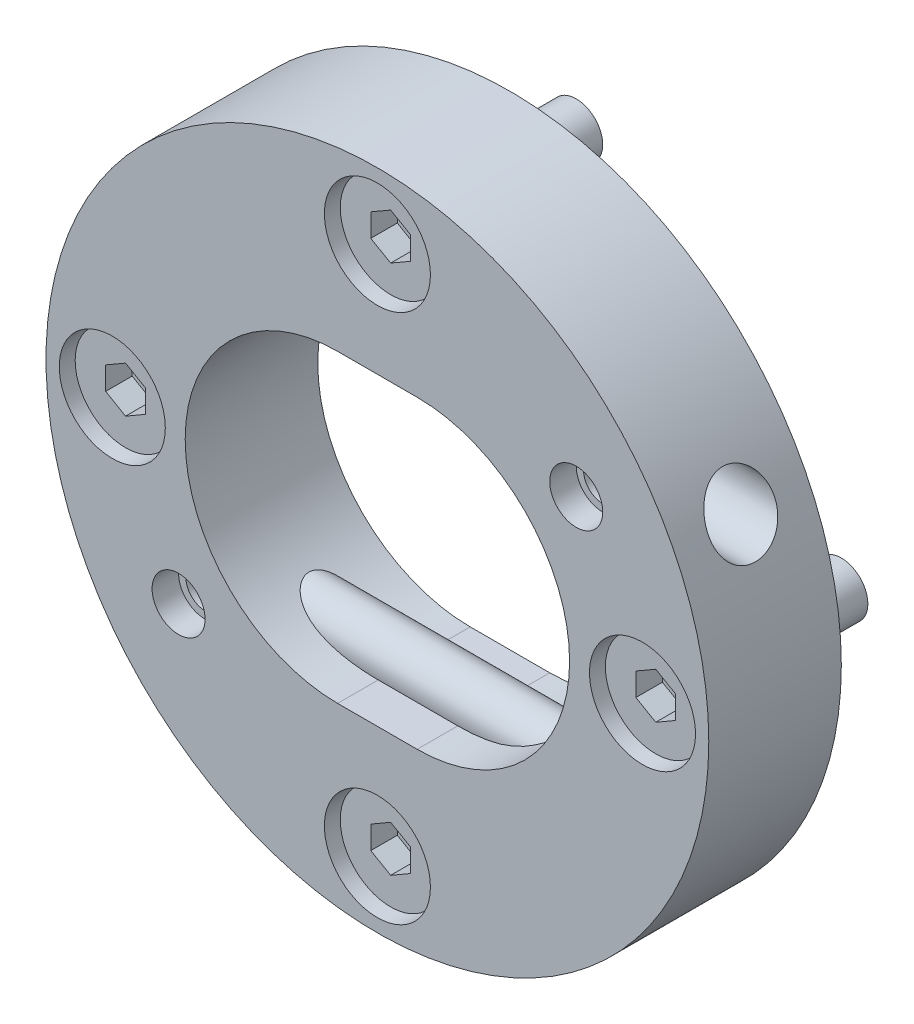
ISO-10303-21;
HEADER;
FILE_DESCRIPTION(('STEP AP214'),'2;1');
FILE_NAME('part.step','',(''),(''),'','','');
FILE_SCHEMA(('AUTOMOTIVE_DESIGN { 1 0 10303 214 1 1 1 1 }'));
ENDSEC;
DATA;
#1=APPLICATION_CONTEXT('core data for automotive mechanical design processes');
#2=APPLICATION_PROTOCOL_DEFINITION('international standard','automotive_design',2000,#1);
#3=PRODUCT_CONTEXT('',#1,'mechanical');
#4=PRODUCT('Part','Part','',(#3));
#5=PRODUCT_RELATED_PRODUCT_CATEGORY('part','',(#4));
#6=PRODUCT_DEFINITION_FORMATION('','',#4);
#7=PRODUCT_DEFINITION_CONTEXT('part definition',#1,'design');
#8=PRODUCT_DEFINITION('design','',#6,#7);
#9=PRODUCT_DEFINITION_SHAPE('','',#8);
#10=(LENGTH_UNIT() NAMED_UNIT(*) SI_UNIT(.MILLI.,.METRE.));
#11=(NAMED_UNIT(*) PLANE_ANGLE_UNIT() SI_UNIT($,.RADIAN.));
#12=(NAMED_UNIT(*) SI_UNIT($,.STERADIAN.) SOLID_ANGLE_UNIT());
#13=UNCERTAINTY_MEASURE_WITH_UNIT(LENGTH_MEASURE(1.E-05),#10,'distance_accuracy_value','');
#14=(GEOMETRIC_REPRESENTATION_CONTEXT(3) GLOBAL_UNCERTAINTY_ASSIGNED_CONTEXT((#13)) GLOBAL_UNIT_ASSIGNED_CONTEXT((#10,
#11,#12)) REPRESENTATION_CONTEXT('',''));
#15=CARTESIAN_POINT('',(0.,0.,0.));
#16=DIRECTION('',(0.,0.,1.));
#17=DIRECTION('',(1.,0.,0.));
#18=AXIS2_PLACEMENT_3D('',#15,#16,#17);
#19=CARTESIAN_POINT('',(0.,0.,2.5));
#20=DIRECTION('',(0.,0.,1.));
#21=DIRECTION('',(1.,0.,0.));
#22=AXIS2_PLACEMENT_3D('',#19,#20,#21);
#23=PLANE('',#22);
#24=CARTESIAN_POINT('',(-10.,0.,2.5));
#25=DIRECTION('',(0.,0.,1.));
#26=DIRECTION('',(1.,0.,0.));
#27=AXIS2_PLACEMENT_3D('',#24,#25,#26);
#28=CIRCLE('',#27,2.);
#29=CARTESIAN_POINT('',(-8.,0.,2.5));
#30=VERTEX_POINT('',#29);
#31=EDGE_CURVE('E777',#30,#30,#28,.T.);
#32=ORIENTED_EDGE('',*,*,#31,.T.);
#33=EDGE_LOOP('',(#32));
#34=FACE_BOUND('',#33,.T.);
#35=CARTESIAN_POINT('',(-10.,0.,2.5));
#36=DIRECTION('',(0.,0.,1.));
#37=DIRECTION('',(-1.,0.,0.));
#38=AXIS2_PLACEMENT_3D('',#35,#36,#37);
#39=CIRCLE('',#38,1.9);
#40=CARTESIAN_POINT('',(-11.9,0.,2.5));
#41=VERTEX_POINT('',#40);
#42=EDGE_CURVE('E1639',#41,#41,#39,.T.);
#43=ORIENTED_EDGE('',*,*,#42,.F.);
#44=EDGE_LOOP('',(#43));
#45=FACE_BOUND('',#44,.T.);
#46=ADVANCED_FACE('F15',(#34,#45),#23,.T.);
#47=CARTESIAN_POINT('',(0.,0.,2.5));
#48=DIRECTION('',(0.,0.,1.));
#49=DIRECTION('',(1.,0.,0.));
#50=AXIS2_PLACEMENT_3D('',#47,#48,#49);
#51=PLANE('',#50);
#52=CARTESIAN_POINT('',(0.,-10.,2.5));
#53=DIRECTION('',(0.,0.,1.));
#54=DIRECTION('',(1.,0.,0.));
#55=AXIS2_PLACEMENT_3D('',#52,#53,#54);
#56=CIRCLE('',#55,2.);
#57=CARTESIAN_POINT('',(2.,-10.,2.5));
#58=VERTEX_POINT('',#57);
#59=EDGE_CURVE('E799',#58,#58,#56,.T.);
#60=ORIENTED_EDGE('',*,*,#59,.T.);
#61=EDGE_LOOP('',(#60));
#62=FACE_BOUND('',#61,.T.);
#63=CARTESIAN_POINT('',(0.,-10.,2.5));
#64=DIRECTION('',(0.,0.,1.));
#65=DIRECTION('',(-1.,0.,0.));
#66=AXIS2_PLACEMENT_3D('',#63,#64,#65);
#67=CIRCLE('',#66,1.9);
#68=CARTESIAN_POINT('',(-1.9,-10.,2.5));
#69=VERTEX_POINT('',#68);
#70=EDGE_CURVE('E282',#69,#69,#67,.T.);
#71=ORIENTED_EDGE('',*,*,#70,.F.);
#72=EDGE_LOOP('',(#71));
#73=FACE_BOUND('',#72,.T.);
#74=ADVANCED_FACE('F686',(#62,#73),#51,.T.);
#75=CARTESIAN_POINT('',(0.,0.,2.5));
#76=DIRECTION('',(0.,0.,1.));
#77=DIRECTION('',(1.,0.,0.));
#78=AXIS2_PLACEMENT_3D('',#75,#76,#77);
#79=PLANE('',#78);
#80=CARTESIAN_POINT('',(10.,0.,2.5));
#81=DIRECTION('',(0.,0.,1.));
#82=DIRECTION('',(1.,0.,0.));
#83=AXIS2_PLACEMENT_3D('',#80,#81,#82);
#84=CIRCLE('',#83,2.);
#85=CARTESIAN_POINT('',(12.,0.,2.5));
#86=VERTEX_POINT('',#85);
#87=EDGE_CURVE('E803',#86,#86,#84,.T.);
#88=ORIENTED_EDGE('',*,*,#87,.T.);
#89=EDGE_LOOP('',(#88));
#90=FACE_BOUND('',#89,.T.);
#91=CARTESIAN_POINT('',(10.,0.,2.5));
#92=DIRECTION('',(0.,0.,1.));
#93=DIRECTION('',(-1.,0.,0.));
#94=AXIS2_PLACEMENT_3D('',#91,#92,#93);
#95=CIRCLE('',#94,1.9);
#96=CARTESIAN_POINT('',(8.1,0.,2.5));
#97=VERTEX_POINT('',#96);
#98=EDGE_CURVE('E342',#97,#97,#95,.T.);
#99=ORIENTED_EDGE('',*,*,#98,.F.);
#100=EDGE_LOOP('',(#99));
#101=FACE_BOUND('',#100,.T.);
#102=ADVANCED_FACE('F693',(#90,#101),#79,.T.);
#103=CARTESIAN_POINT('',(0.,0.,2.5));
#104=DIRECTION('',(0.,0.,1.));
#105=DIRECTION('',(1.,0.,0.));
#106=AXIS2_PLACEMENT_3D('',#103,#104,#105);
#107=PLANE('',#106);
#108=CARTESIAN_POINT('',(0.,10.,2.5));
#109=DIRECTION('',(0.,0.,1.));
#110=DIRECTION('',(1.,0.,0.));
#111=AXIS2_PLACEMENT_3D('',#108,#109,#110);
#112=CIRCLE('',#111,2.);
#113=CARTESIAN_POINT('',(2.,10.,2.5));
#114=VERTEX_POINT('',#113);
#115=EDGE_CURVE('E807',#114,#114,#112,.T.);
#116=ORIENTED_EDGE('',*,*,#115,.T.);
#117=EDGE_LOOP('',(#116));
#118=FACE_BOUND('',#117,.T.);
#119=CARTESIAN_POINT('',(0.,10.,2.5));
#120=DIRECTION('',(0.,0.,1.));
#121=DIRECTION('',(-1.,0.,0.));
#122=AXIS2_PLACEMENT_3D('',#119,#120,#121);
#123=CIRCLE('',#122,1.9);
#124=CARTESIAN_POINT('',(-1.9,10.,2.5));
#125=VERTEX_POINT('',#124);
#126=EDGE_CURVE('E402',#125,#125,#123,.T.);
#127=ORIENTED_EDGE('',*,*,#126,.F.);
#128=EDGE_LOOP('',(#127));
#129=FACE_BOUND('',#128,.T.);
#130=ADVANCED_FACE('F1382',(#118,#129),#107,.T.);
#131=CARTESIAN_POINT('',(0.,0.,5.));
#132=DIRECTION('',(0.,0.,-1.));
#133=DIRECTION('',(-1.,0.,0.));
#134=AXIS2_PLACEMENT_3D('',#131,#132,#133);
#135=CYLINDRICAL_SURFACE('',#134,12.5);
#136=CARTESIAN_POINT('',(0.,0.,0.));
#137=DIRECTION('',(0.,0.,1.));
#138=DIRECTION('',(1.,0.,0.));
#139=AXIS2_PLACEMENT_3D('',#136,#137,#138);
#140=CIRCLE('',#139,12.5);
#141=CARTESIAN_POINT('',(12.5,0.,0.));
#142=VERTEX_POINT('',#141);
#143=EDGE_CURVE('E731',#142,#142,#140,.T.);
#144=ORIENTED_EDGE('',*,*,#143,.T.);
#145=EDGE_LOOP('',(#144));
#146=FACE_BOUND('',#145,.T.);
#147=CARTESIAN_POINT('',(0.,0.,5.));
#148=DIRECTION('',(0.,0.,1.));
#149=DIRECTION('',(1.,0.,0.));
#150=AXIS2_PLACEMENT_3D('',#147,#148,#149);
#151=CIRCLE('',#150,12.5);
#152=CARTESIAN_POINT('',(12.5,0.,5.));
#153=VERTEX_POINT('',#152);
#154=EDGE_CURVE('E772',#153,#153,#151,.T.);
#155=ORIENTED_EDGE('',*,*,#154,.F.);
#156=EDGE_LOOP('',(#155));
#157=FACE_BOUND('',#156,.T.);
#158=CARTESIAN_POINT('',(11.2249721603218,5.5,1.25));
#159=CARTESIAN_POINT('',(11.2611498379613,5.42616391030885,1.25000125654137));
#160=CARTESIAN_POINT('',(11.2966019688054,5.35195014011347,1.25654872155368));
#161=CARTESIAN_POINT('',(11.3651513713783,5.2047982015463,1.28305944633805));
#162=CARTESIAN_POINT('',(11.3982482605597,5.13186024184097,1.30302488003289));
#163=CARTESIAN_POINT('',(11.4613569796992,4.98932784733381,1.35652864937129));
#164=CARTESIAN_POINT('',(11.4913573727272,4.91974628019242,1.39011519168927));
#165=CARTESIAN_POINT('',(11.5473517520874,4.78684333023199,1.47047143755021));
#166=CARTESIAN_POINT('',(11.5733474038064,4.72351934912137,1.51723563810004));
#167=CARTESIAN_POINT('',(11.6189446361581,4.61016208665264,1.61905431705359));
#168=CARTESIAN_POINT('',(11.6388738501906,4.55949697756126,1.67325789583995));
#169=CARTESIAN_POINT('',(11.6742870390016,4.46804584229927,1.79070412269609));
#170=CARTESIAN_POINT('',(11.6897732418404,4.42725486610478,1.85394221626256));
#171=CARTESIAN_POINT('',(11.7149636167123,4.36013951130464,1.98226646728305));
#172=CARTESIAN_POINT('',(11.7250247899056,4.33293437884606,2.04682296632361));
#173=CARTESIAN_POINT('',(11.7409424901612,4.28961626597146,2.18004407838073));
#174=CARTESIAN_POINT('',(11.7468003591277,4.27349974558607,2.24870737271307));
#175=CARTESIAN_POINT('',(11.7540482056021,4.25352300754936,2.38469437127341));
#176=CARTESIAN_POINT('',(11.7556359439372,4.24912039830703,2.45192842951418));
#177=CARTESIAN_POINT('',(11.7548947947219,4.25117044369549,2.58620457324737));
#178=CARTESIAN_POINT('',(11.7525664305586,4.25762164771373,2.65324668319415));
#179=CARTESIAN_POINT('',(11.7440888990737,4.28094898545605,2.78420778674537));
#180=CARTESIAN_POINT('',(11.7379966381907,4.29766983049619,2.84815827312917));
#181=CARTESIAN_POINT('',(11.7221264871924,4.34076885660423,2.97222466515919));
#182=CARTESIAN_POINT('',(11.7123485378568,4.3671471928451,3.03234050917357));
#183=CARTESIAN_POINT('',(11.6890806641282,4.42905149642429,3.14802412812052));
#184=CARTESIAN_POINT('',(11.6755390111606,4.4647044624,3.20351338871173));
#185=CARTESIAN_POINT('',(11.6450219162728,4.54370483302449,3.30763401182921));
#186=CARTESIAN_POINT('',(11.6280459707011,4.58705336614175,3.35626436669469));
#187=CARTESIAN_POINT('',(11.5901435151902,4.68201784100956,3.44759069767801));
#188=CARTESIAN_POINT('',(11.5690789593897,4.73390832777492,3.48994336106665));
#189=CARTESIAN_POINT('',(11.5239069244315,4.84283448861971,3.56537632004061));
#190=CARTESIAN_POINT('',(11.4997986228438,4.89987155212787,3.59845410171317));
#191=CARTESIAN_POINT('',(11.4472277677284,5.02151939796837,3.6569001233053));
#192=CARTESIAN_POINT('',(11.4185794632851,5.08638118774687,3.68157787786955));
#193=CARTESIAN_POINT('',(11.3589181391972,5.21825868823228,3.71977055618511));
#194=CARTESIAN_POINT('',(11.3279042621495,5.28527517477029,3.73328141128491));
#195=CARTESIAN_POINT('',(11.2614718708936,5.42547287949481,3.74993538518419));
#196=CARTESIAN_POINT('',(11.2259023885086,5.49869788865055,3.75210936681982));
#197=CARTESIAN_POINT('',(11.1536266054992,5.64386384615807,3.74382255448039));
#198=CARTESIAN_POINT('',(11.1169198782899,5.71580429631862,3.73335696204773));
#199=CARTESIAN_POINT('',(11.0407438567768,5.86167245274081,3.69903820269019));
#200=CARTESIAN_POINT('',(11.0012612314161,5.93538612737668,3.67429825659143));
#201=CARTESIAN_POINT('',(10.9233897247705,6.07751029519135,3.61131781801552));
#202=CARTESIAN_POINT('',(10.8850014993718,6.14591764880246,3.57306940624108));
#203=CARTESIAN_POINT('',(10.8106390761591,6.27580446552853,3.48331249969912));
#204=CARTESIAN_POINT('',(10.774683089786,6.33723359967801,3.43171551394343));
#205=CARTESIAN_POINT('',(10.7074355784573,6.45020467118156,3.31615876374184));
#206=CARTESIAN_POINT('',(10.6761367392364,6.50176214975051,3.2522187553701));
#207=CARTESIAN_POINT('',(10.62740285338,6.58102682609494,3.13068130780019));
#208=CARTESIAN_POINT('',(10.6084562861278,6.61147612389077,3.07546897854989));
#209=CARTESIAN_POINT('',(10.5754960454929,6.6640714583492,2.959848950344));
#210=CARTESIAN_POINT('',(10.5614786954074,6.68622368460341,2.89944516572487));
#211=CARTESIAN_POINT('',(10.5392589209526,6.721194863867,2.77459935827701));
#212=CARTESIAN_POINT('',(10.5310864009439,6.73396582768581,2.71013837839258));
#213=CARTESIAN_POINT('',(10.5213317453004,6.74919738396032,2.57951739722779));
#214=CARTESIAN_POINT('',(10.5197472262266,6.75166170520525,2.51335801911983));
#215=CARTESIAN_POINT('',(10.5231350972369,6.74637907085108,2.38751976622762));
#216=CARTESIAN_POINT('',(10.5275397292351,6.73951632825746,2.32778544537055));
#217=CARTESIAN_POINT('',(10.5416127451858,6.71748237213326,2.21052484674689));
#218=CARTESIAN_POINT('',(10.5512812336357,6.70231099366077,2.15299861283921));
#219=CARTESIAN_POINT('',(10.5753891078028,6.66420688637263,2.04102776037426));
#220=CARTESIAN_POINT('',(10.5898731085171,6.64120152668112,1.98661775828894));
#221=CARTESIAN_POINT('',(10.6228016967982,6.58840268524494,1.88251308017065));
#222=CARTESIAN_POINT('',(10.6412475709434,6.55860699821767,1.83281994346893));
#223=CARTESIAN_POINT('',(10.6835358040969,6.4895205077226,1.73357800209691));
#224=CARTESIAN_POINT('',(10.7077513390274,6.4495396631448,1.68467009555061));
#225=CARTESIAN_POINT('',(10.75904058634,6.36361156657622,1.59414350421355));
#226=CARTESIAN_POINT('',(10.7861160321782,6.31766069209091,1.55252928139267));
#227=CARTESIAN_POINT('',(10.84635524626,6.21374993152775,1.4713980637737));
#228=CARTESIAN_POINT('',(10.8798278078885,6.1550185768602,1.43309709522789));
#229=CARTESIAN_POINT('',(10.9481516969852,6.03265186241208,1.36703042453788));
#230=CARTESIAN_POINT('',(10.983003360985,5.96901530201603,1.33926731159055));
#231=CARTESIAN_POINT('',(11.052727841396,5.83888675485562,1.29487242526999));
#232=CARTESIAN_POINT('',(11.0875968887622,5.77243010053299,1.27813105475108));
#233=CARTESIAN_POINT('',(11.1568451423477,5.63742523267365,1.25569405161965));
#234=CARTESIAN_POINT('',(11.1912243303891,5.56887694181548,1.24999882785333));
#235=CARTESIAN_POINT('',(11.2249721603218,5.5,1.25));
#236=B_SPLINE_CURVE_WITH_KNOTS('',3,(#158,#159,#160,#161,#162,#163,#164,#165,#166,#167,#168,
#169,#170,#171,#172,#173,#174,#175,#176,#177,#178,#179,#180,#181,#182,#183,#184,#185,#186,#187,
#188,#189,#190,#191,#192,#193,#194,#195,#196,#197,#198,#199,#200,#201,#202,#203,#204,#205,#206,
#207,#208,#209,#210,#211,#212,#213,#214,#215,#216,#217,#218,#219,#220,#221,#222,#223,#224,#225,
#226,#227,#228,#229,#230,#231,#232,#233,#234,#235),.UNSPECIFIED.,.T.,.F.,(4,2,2,2,2,2,2,2,2,2,2,
2,2,2,2,2,2,2,2,2,2,2,2,2,2,2,2,2,2,2,2,2,2,2,2,2,2,2,4),(0.,0.246419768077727,
0.492879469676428,0.7402191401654,0.987455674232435,1.21670117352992,1.44583151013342,
1.657074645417,1.86825031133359,2.06946243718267,2.27064767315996,2.46886320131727,
2.66708191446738,2.86817252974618,3.06929265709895,3.27902547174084,3.48881507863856,
3.71309800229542,3.93746260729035,4.18072557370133,4.424080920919,4.68449013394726,
4.94505226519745,5.2073880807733,5.46930743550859,5.66600820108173,5.86256193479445,
6.06011425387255,6.25759509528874,6.43760259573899,6.61761366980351,6.79934128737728,
6.98112800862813,7.1832971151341,7.38558947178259,7.61773846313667,7.84994445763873,
8.07980511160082,8.30967427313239),.UNSPECIFIED.);
#237=CARTESIAN_POINT('',(11.2249721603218,5.5,1.25));
#238=VERTEX_POINT('',#237);
#239=EDGE_CURVE('E546',#238,#238,#236,.T.);
#240=ORIENTED_EDGE('',*,*,#239,.T.);
#241=EDGE_LOOP('',(#240));
#242=FACE_BOUND('',#241,.T.);
#243=CARTESIAN_POINT('',(-11.2249721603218,-5.5,3.75));
#244=CARTESIAN_POINT('',(-11.2611498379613,-5.42616391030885,3.74999874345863));
#245=CARTESIAN_POINT('',(-11.2966019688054,-5.35195014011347,3.74345127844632));
#246=CARTESIAN_POINT('',(-11.3651513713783,-5.2047982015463,3.71694055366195));
#247=CARTESIAN_POINT('',(-11.3982482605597,-5.13186024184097,3.69697511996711));
#248=CARTESIAN_POINT('',(-11.4613569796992,-4.98932784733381,3.64347135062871));
#249=CARTESIAN_POINT('',(-11.4913573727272,-4.91974628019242,3.60988480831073));
#250=CARTESIAN_POINT('',(-11.5473517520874,-4.78684333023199,3.52952856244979));
#251=CARTESIAN_POINT('',(-11.5733474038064,-4.72351934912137,3.48276436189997));
#252=CARTESIAN_POINT('',(-11.6189446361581,-4.61016208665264,3.38094568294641));
#253=CARTESIAN_POINT('',(-11.6388738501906,-4.55949697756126,3.32674210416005));
#254=CARTESIAN_POINT('',(-11.6742870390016,-4.46804584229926,3.20929587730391));
#255=CARTESIAN_POINT('',(-11.6897732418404,-4.42725486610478,3.14605778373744));
#256=CARTESIAN_POINT('',(-11.7149636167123,-4.36013951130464,3.01773353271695));
#257=CARTESIAN_POINT('',(-11.7250247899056,-4.33293437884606,2.95317703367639));
#258=CARTESIAN_POINT('',(-11.7409424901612,-4.28961626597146,2.81995592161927));
#259=CARTESIAN_POINT('',(-11.7468003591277,-4.27349974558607,2.75129262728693));
#260=CARTESIAN_POINT('',(-11.7540482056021,-4.25352300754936,2.6153056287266));
#261=CARTESIAN_POINT('',(-11.7556359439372,-4.24912039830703,2.54807157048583));
#262=CARTESIAN_POINT('',(-11.7548947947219,-4.25117044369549,2.41379542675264));
#263=CARTESIAN_POINT('',(-11.7525664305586,-4.25762164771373,2.34675331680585));
#264=CARTESIAN_POINT('',(-11.7440888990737,-4.28094898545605,2.21579221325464));
#265=CARTESIAN_POINT('',(-11.7379966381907,-4.29766983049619,2.15184172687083));
#266=CARTESIAN_POINT('',(-11.7221264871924,-4.34076885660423,2.02777533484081));
#267=CARTESIAN_POINT('',(-11.7123485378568,-4.3671471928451,1.96765949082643));
#268=CARTESIAN_POINT('',(-11.6890806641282,-4.42905149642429,1.85197587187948));
#269=CARTESIAN_POINT('',(-11.6755390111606,-4.4647044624,1.79648661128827));
#270=CARTESIAN_POINT('',(-11.6450219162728,-4.54370483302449,1.69236598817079));
#271=CARTESIAN_POINT('',(-11.6280459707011,-4.58705336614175,1.64373563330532));
#272=CARTESIAN_POINT('',(-11.5901435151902,-4.68201784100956,1.55240930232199));
#273=CARTESIAN_POINT('',(-11.5690789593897,-4.73390832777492,1.51005663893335));
#274=CARTESIAN_POINT('',(-11.5239069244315,-4.84283448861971,1.43462367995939));
#275=CARTESIAN_POINT('',(-11.4997986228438,-4.89987155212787,1.40154589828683));
#276=CARTESIAN_POINT('',(-11.4472277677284,-5.02151939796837,1.3430998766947));
#277=CARTESIAN_POINT('',(-11.4185794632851,-5.08638118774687,1.31842212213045));
#278=CARTESIAN_POINT('',(-11.3589181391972,-5.21825868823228,1.28022944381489));
#279=CARTESIAN_POINT('',(-11.3279042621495,-5.28527517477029,1.26671858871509));
#280=CARTESIAN_POINT('',(-11.2614718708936,-5.42547287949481,1.25006461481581));
#281=CARTESIAN_POINT('',(-11.2259023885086,-5.49869788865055,1.24789063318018));
#282=CARTESIAN_POINT('',(-11.1536266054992,-5.64386384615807,1.25617744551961));
#283=CARTESIAN_POINT('',(-11.1169198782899,-5.71580429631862,1.26664303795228));
#284=CARTESIAN_POINT('',(-11.0407438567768,-5.86167245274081,1.30096179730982));
#285=CARTESIAN_POINT('',(-11.0012612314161,-5.93538612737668,1.32570174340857));
#286=CARTESIAN_POINT('',(-10.9233897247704,-6.07751029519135,1.38868218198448));
#287=CARTESIAN_POINT('',(-10.8850014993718,-6.14591764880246,1.42693059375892));
#288=CARTESIAN_POINT('',(-10.8106390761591,-6.27580446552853,1.51668750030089));
#289=CARTESIAN_POINT('',(-10.774683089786,-6.33723359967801,1.56828448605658));
#290=CARTESIAN_POINT('',(-10.7074355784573,-6.45020467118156,1.68384123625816));
#291=CARTESIAN_POINT('',(-10.6761367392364,-6.50176214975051,1.7477812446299));
#292=CARTESIAN_POINT('',(-10.62740285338,-6.58102682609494,1.86931869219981));
#293=CARTESIAN_POINT('',(-10.6084562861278,-6.61147612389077,1.92453102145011));
#294=CARTESIAN_POINT('',(-10.5754960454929,-6.6640714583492,2.040151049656));
#295=CARTESIAN_POINT('',(-10.5614786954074,-6.68622368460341,2.10055483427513));
#296=CARTESIAN_POINT('',(-10.5392589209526,-6.721194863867,2.22540064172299));
#297=CARTESIAN_POINT('',(-10.5310864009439,-6.73396582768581,2.28986162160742));
#298=CARTESIAN_POINT('',(-10.5213317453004,-6.74919738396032,2.42048260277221));
#299=CARTESIAN_POINT('',(-10.5197472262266,-6.75166170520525,2.48664198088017));
#300=CARTESIAN_POINT('',(-10.5231350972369,-6.74637907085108,2.61248023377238));
#301=CARTESIAN_POINT('',(-10.5275397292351,-6.73951632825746,2.67221455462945));
#302=CARTESIAN_POINT('',(-10.5416127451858,-6.71748237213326,2.7894751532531));
#303=CARTESIAN_POINT('',(-10.5512812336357,-6.70231099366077,2.84700138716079));
#304=CARTESIAN_POINT('',(-10.5753891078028,-6.66420688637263,2.95897223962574));
#305=CARTESIAN_POINT('',(-10.5898731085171,-6.64120152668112,3.01338224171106));
#306=CARTESIAN_POINT('',(-10.6228016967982,-6.58840268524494,3.11748691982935));
#307=CARTESIAN_POINT('',(-10.6412475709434,-6.55860699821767,3.16718005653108));
#308=CARTESIAN_POINT('',(-10.6835358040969,-6.4895205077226,3.26642199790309));
#309=CARTESIAN_POINT('',(-10.7077513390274,-6.4495396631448,3.31532990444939));
#310=CARTESIAN_POINT('',(-10.75904058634,-6.36361156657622,3.40585649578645));
#311=CARTESIAN_POINT('',(-10.7861160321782,-6.31766069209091,3.44747071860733));
#312=CARTESIAN_POINT('',(-10.84635524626,-6.21374993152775,3.52860193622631));
#313=CARTESIAN_POINT('',(-10.8798278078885,-6.1550185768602,3.56690290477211));
#314=CARTESIAN_POINT('',(-10.9481516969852,-6.03265186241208,3.63296957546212));
#315=CARTESIAN_POINT('',(-10.983003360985,-5.96901530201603,3.66073268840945));
#316=CARTESIAN_POINT('',(-11.052727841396,-5.83888675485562,3.70512757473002));
#317=CARTESIAN_POINT('',(-11.0875968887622,-5.77243010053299,3.72186894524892));
#318=CARTESIAN_POINT('',(-11.1568451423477,-5.63742523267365,3.74430594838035));
#319=CARTESIAN_POINT('',(-11.1912243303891,-5.56887694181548,3.75000117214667));
#320=CARTESIAN_POINT('',(-11.2249721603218,-5.5,3.75));
#321=B_SPLINE_CURVE_WITH_KNOTS('',3,(#243,#244,#245,#246,#247,#248,#249,#250,#251,#252,#253,
#254,#255,#256,#257,#258,#259,#260,#261,#262,#263,#264,#265,#266,#267,#268,#269,#270,#271,#272,
#273,#274,#275,#276,#277,#278,#279,#280,#281,#282,#283,#284,#285,#286,#287,#288,#289,#290,#291,
#292,#293,#294,#295,#296,#297,#298,#299,#300,#301,#302,#303,#304,#305,#306,#307,#308,#309,#310,
#311,#312,#313,#314,#315,#316,#317,#318,#319,#320),.UNSPECIFIED.,.T.,.F.,(4,2,2,2,2,2,2,2,2,2,2,
2,2,2,2,2,2,2,2,2,2,2,2,2,2,2,2,2,2,2,2,2,2,2,2,2,2,2,4),(0.,0.246419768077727,
0.492879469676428,0.7402191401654,0.987455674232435,1.21670117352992,1.44583151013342,
1.657074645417,1.86825031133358,2.06946243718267,2.27064767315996,2.46886320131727,
2.66708191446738,2.86817252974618,3.06929265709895,3.27902547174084,3.48881507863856,
3.71309800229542,3.93746260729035,4.18072557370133,4.424080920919,4.68449013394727,
4.94505226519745,5.2073880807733,5.46930743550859,5.66600820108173,5.86256193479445,
6.06011425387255,6.25759509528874,6.43760259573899,6.61761366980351,6.79934128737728,
6.98112800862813,7.1832971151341,7.38558947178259,7.61773846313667,7.84994445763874,
8.07980511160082,8.30967427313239),.UNSPECIFIED.);
#322=CARTESIAN_POINT('',(-11.2249721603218,-5.5,3.75));
#323=VERTEX_POINT('',#322);
#324=EDGE_CURVE('E500',#323,#323,#321,.T.);
#325=ORIENTED_EDGE('',*,*,#324,.F.);
#326=EDGE_LOOP('',(#325));
#327=FACE_BOUND('',#326,.T.);
#328=ADVANCED_FACE('F17',(#146,#157,#242,#327),#135,.T.);
#329=CARTESIAN_POINT('',(1.5,0.,0.));
#330=DIRECTION('',(0.,0.,1.));
#331=DIRECTION('',(1.,0.,0.));
#332=AXIS2_PLACEMENT_3D('',#329,#330,#331);
#333=CYLINDRICAL_SURFACE('',#332,5.75);
#334=CARTESIAN_POINT('',(1.5,-5.75,3.46824583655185));
#335=CARTESIAN_POINT('',(1.57962139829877,-5.7500011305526,3.46822681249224));
#336=CARTESIAN_POINT('',(1.65924077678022,-5.74834623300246,3.46867240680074));
#337=CARTESIAN_POINT('',(1.81832966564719,-5.74173324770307,3.47035366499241));
#338=CARTESIAN_POINT('',(1.8977991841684,-5.73677534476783,3.4715892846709));
#339=CARTESIAN_POINT('',(2.05654171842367,-5.72355769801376,3.47471323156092));
#340=CARTESIAN_POINT('',(2.13581440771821,-5.71529420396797,3.47660229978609));
#341=CARTESIAN_POINT('',(2.29393353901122,-5.69548231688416,3.48075884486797));
#342=CARTESIAN_POINT('',(2.37277998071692,-5.68393392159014,3.48302632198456));
#343=CARTESIAN_POINT('',(2.60854884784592,-5.6443795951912,3.48989095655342));
#344=CARTESIAN_POINT('',(2.76467036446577,-5.61146706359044,3.49454947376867));
#345=CARTESIAN_POINT('',(3.07358927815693,-5.53278177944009,3.50024180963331));
#346=CARTESIAN_POINT('',(3.22639007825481,-5.48702293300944,3.50127953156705));
#347=CARTESIAN_POINT('',(3.43008882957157,-5.41668048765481,3.49668998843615));
#348=CARTESIAN_POINT('',(3.48298341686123,-5.39753994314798,3.49493894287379));
#349=CARTESIAN_POINT('',(3.58812858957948,-5.35774001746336,3.49003261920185));
#350=CARTESIAN_POINT('',(3.64037922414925,-5.33708075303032,3.48687744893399));
#351=CARTESIAN_POINT('',(3.79610704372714,-5.27285515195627,3.47483958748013));
#352=CARTESIAN_POINT('',(3.89849825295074,-5.22706240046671,3.46338522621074));
#353=CARTESIAN_POINT('',(4.10013292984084,-5.12975594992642,3.43037234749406));
#354=CARTESIAN_POINT('',(4.19934190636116,-5.07819659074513,3.40872808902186));
#355=CARTESIAN_POINT('',(4.34324842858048,-4.99814602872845,3.36547662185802));
#356=CARTESIAN_POINT('',(4.39034914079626,-4.97104263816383,3.34928623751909));
#357=CARTESIAN_POINT('',(4.48251360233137,-4.91629690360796,3.31263635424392));
#358=CARTESIAN_POINT('',(4.52757884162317,-4.88865497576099,3.29218004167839));
#359=CARTESIAN_POINT('',(4.61588391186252,-4.83286065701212,3.24583105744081));
#360=CARTESIAN_POINT('',(4.65907692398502,-4.80470794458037,3.21984803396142));
#361=CARTESIAN_POINT('',(4.74189397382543,-4.74922169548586,3.16177438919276));
#362=CARTESIAN_POINT('',(4.78151437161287,-4.72188901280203,3.12967764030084));
#363=CARTESIAN_POINT('',(4.85629053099,-4.669039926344,3.05813156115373));
#364=CARTESIAN_POINT('',(4.89138220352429,-4.64355145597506,3.01859284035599));
#365=CARTESIAN_POINT('',(4.95445972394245,-4.5968191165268,2.93204085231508));
#366=CARTESIAN_POINT('',(4.98246889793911,-4.57556136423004,2.8850529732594));
#367=CARTESIAN_POINT('',(5.02081241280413,-4.54606954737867,2.80202757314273));
#368=CARTESIAN_POINT('',(5.03389860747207,-4.53588434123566,2.76794923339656));
#369=CARTESIAN_POINT('',(5.05542156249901,-4.51903363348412,2.69751389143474));
#370=CARTESIAN_POINT('',(5.0638614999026,-4.51236572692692,2.66115846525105));
#371=CARTESIAN_POINT('',(5.0755884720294,-4.5030795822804,2.58691955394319));
#372=CARTESIAN_POINT('',(5.07885009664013,-4.50048131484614,2.54902946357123));
#373=CARTESIAN_POINT('',(5.07990616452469,-4.49964139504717,2.4731251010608));
#374=CARTESIAN_POINT('',(5.07770130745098,-4.50139918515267,2.4351108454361));
#375=CARTESIAN_POINT('',(5.06833968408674,-4.5088227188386,2.36292353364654));
#376=CARTESIAN_POINT('',(5.06155086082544,-4.51419799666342,2.32867096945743));
#377=CARTESIAN_POINT('',(5.04380023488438,-4.52814604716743,2.26195981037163));
#378=CARTESIAN_POINT('',(5.03283714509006,-4.53671980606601,2.22950177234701));
#379=CARTESIAN_POINT('',(5.00324439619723,-4.55963002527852,2.15712965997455));
#380=CARTESIAN_POINT('',(4.98328904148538,-4.57493029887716,2.11806336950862));
#381=CARTESIAN_POINT('',(4.93832755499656,-4.60881750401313,2.04454306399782));
#382=CARTESIAN_POINT('',(4.91331230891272,-4.62741035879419,2.01009756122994));
#383=CARTESIAN_POINT('',(4.84787641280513,-4.67509024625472,1.93219102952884));
#384=CARTESIAN_POINT('',(4.80542729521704,-4.70527856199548,1.8911216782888));
#385=CARTESIAN_POINT('',(4.7149764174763,-4.76754232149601,1.81747444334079));
#386=CARTESIAN_POINT('',(4.66696440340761,-4.79962119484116,1.78491261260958));
#387=CARTESIAN_POINT('',(4.57551724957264,-4.85861476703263,1.73194051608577));
#388=CARTESIAN_POINT('',(4.53268726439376,-4.88548240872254,1.71040592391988));
#389=CARTESIAN_POINT('',(4.44492033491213,-4.93888563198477,1.67160473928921));
#390=CARTESIAN_POINT('',(4.39998196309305,-4.9654209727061,1.65434108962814));
#391=CARTESIAN_POINT('',(4.26257714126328,-5.04398327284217,1.6079398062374));
#392=CARTESIAN_POINT('',(4.16762984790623,-5.09489563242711,1.58425002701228));
#393=CARTESIAN_POINT('',(3.97700137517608,-5.19017997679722,1.54789360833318));
#394=CARTESIAN_POINT('',(3.88146551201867,-5.23471982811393,1.53486599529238));
#395=CARTESIAN_POINT('',(3.68744414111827,-5.31871869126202,1.51562564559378));
#396=CARTESIAN_POINT('',(3.58895593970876,-5.35817287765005,1.50941933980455));
#397=CARTESIAN_POINT('',(3.38950920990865,-5.43172124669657,1.50164739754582));
#398=CARTESIAN_POINT('',(3.28854402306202,-5.46579859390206,1.50009607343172));
#399=CARTESIAN_POINT('',(3.08486952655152,-5.52829441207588,1.49991264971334));
#400=CARTESIAN_POINT('',(2.98215990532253,-5.5567118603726,1.50128107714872));
#401=CARTESIAN_POINT('',(2.76564908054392,-5.61018769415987,1.50569345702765));
#402=CARTESIAN_POINT('',(2.65171136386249,-5.63468076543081,1.50888256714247));
#403=CARTESIAN_POINT('',(2.42256089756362,-5.67670264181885,1.51550604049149));
#404=CARTESIAN_POINT('',(2.30734804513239,-5.69423088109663,1.51894042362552));
#405=CARTESIAN_POINT('',(2.07699344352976,-5.72214330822,1.52488153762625));
#406=CARTESIAN_POINT('',(1.96185899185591,-5.73258540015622,1.52739570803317));
#407=CARTESIAN_POINT('',(1.78883706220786,-5.74303176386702,1.52997597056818));
#408=CARTESIAN_POINT('',(1.73110532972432,-5.74564442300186,1.53063756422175));
#409=CARTESIAN_POINT('',(1.61558368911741,-5.74912859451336,1.53152868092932));
#410=CARTESIAN_POINT('',(1.55779377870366,-5.75000003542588,1.53175818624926));
#411=CARTESIAN_POINT('',(1.49999999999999,-5.75,1.53175416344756));
#412=B_SPLINE_CURVE_WITH_KNOTS('',3,(#334,#335,#336,#337,#338,#339,#340,#341,#342,#343,#344,
#345,#346,#347,#348,#349,#350,#351,#352,#353,#354,#355,#356,#357,#358,#359,#360,#361,#362,#363,
#364,#365,#366,#367,#368,#369,#370,#371,#372,#373,#374,#375,#376,#377,#378,#379,#380,#381,#382,
#383,#384,#385,#386,#387,#388,#389,#390,#391,#392,#393,#394,#395,#396,#397,#398,#399,#400,#401,
#402,#403,#404,#405,#406,#407,#408,#409,#410,#411),.UNSPECIFIED.,.F.,.F.,(4,2,2,2,2,2,2,2,2,2,2,
2,2,2,2,2,2,2,2,2,2,2,2,2,2,2,2,2,2,2,2,2,2,2,2,2,2,2,4),(0.,0.238842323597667,
0.477671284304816,0.716771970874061,0.955872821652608,1.43416593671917,1.91194328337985,
2.08074476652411,2.24953328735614,2.58730619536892,2.92797346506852,3.09792464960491,
3.26774934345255,3.44059929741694,3.61362341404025,3.78887645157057,3.96354454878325,
4.07679487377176,4.18996766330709,4.30369409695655,4.41740597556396,4.52293112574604,
4.62848884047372,4.76709958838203,4.9059622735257,5.10385227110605,5.3021130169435,
5.46674252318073,5.63148514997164,5.9613927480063,6.27960602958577,6.59811905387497,
6.91761039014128,7.23715940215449,7.58668964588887,7.93624828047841,8.28291496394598,
8.45627454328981,8.6296412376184),.UNSPECIFIED.);
#413=CARTESIAN_POINT('',(1.5,-5.75,3.46824583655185));
#414=VERTEX_POINT('',#413);
#415=CARTESIAN_POINT('',(1.5,-5.75,1.53175416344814));
#416=VERTEX_POINT('',#415);
#417=EDGE_CURVE('E510',#414,#416,#412,.T.);
#418=ORIENTED_EDGE('',*,*,#417,.F.);
#419=DIRECTION('',(0.,0.,1.));
#420=VECTOR('',#419,1.);
#421=CARTESIAN_POINT('',(1.5,-5.75,0.));
#422=LINE('',#421,#420);
#423=CARTESIAN_POINT('',(1.5,-5.75,5.));
#424=VERTEX_POINT('',#423);
#425=EDGE_CURVE('E815',#414,#424,#422,.T.);
#426=ORIENTED_EDGE('',*,*,#425,.T.);
#427=CARTESIAN_POINT('',(1.5,0.,5.));
#428=DIRECTION('',(0.,0.,1.));
#429=DIRECTION('',(1.,0.,0.));
#430=AXIS2_PLACEMENT_3D('',#427,#428,#429);
#431=CIRCLE('',#430,5.75);
#432=CARTESIAN_POINT('',(1.5,5.75,5.));
#433=VERTEX_POINT('',#432);
#434=EDGE_CURVE('E753',#424,#433,#431,.T.);
#435=ORIENTED_EDGE('',*,*,#434,.T.);
#436=DIRECTION('',(0.,0.,1.));
#437=VECTOR('',#436,1.);
#438=CARTESIAN_POINT('',(1.5,5.75,0.));
#439=LINE('',#438,#437);
#440=CARTESIAN_POINT('',(1.5,5.75,3.46824583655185));
#441=VERTEX_POINT('',#440);
#442=EDGE_CURVE('E786',#441,#433,#439,.T.);
#443=ORIENTED_EDGE('',*,*,#442,.F.);
#444=CARTESIAN_POINT('',(1.5,5.75,3.46824583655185));
#445=CARTESIAN_POINT('',(1.57962139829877,5.7500011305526,3.46822681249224));
#446=CARTESIAN_POINT('',(1.65924077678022,5.74834623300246,3.46867240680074));
#447=CARTESIAN_POINT('',(1.81832966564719,5.74173324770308,3.47035366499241));
#448=CARTESIAN_POINT('',(1.8977991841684,5.73677534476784,3.4715892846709));
#449=CARTESIAN_POINT('',(2.05654171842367,5.72355769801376,3.47471323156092));
#450=CARTESIAN_POINT('',(2.13581440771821,5.71529420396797,3.47660229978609));
#451=CARTESIAN_POINT('',(2.29393353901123,5.69548231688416,3.48075884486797));
#452=CARTESIAN_POINT('',(2.37277998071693,5.68393392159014,3.48302632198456));
#453=CARTESIAN_POINT('',(2.60854884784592,5.6443795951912,3.48989095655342));
#454=CARTESIAN_POINT('',(2.76467036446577,5.61146706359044,3.49454947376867));
#455=CARTESIAN_POINT('',(3.07358927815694,5.5327817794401,3.50024180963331));
#456=CARTESIAN_POINT('',(3.22639007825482,5.48702293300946,3.50127953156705));
#457=CARTESIAN_POINT('',(3.43008882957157,5.41668048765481,3.49668998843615));
#458=CARTESIAN_POINT('',(3.48298341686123,5.39753994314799,3.49493894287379));
#459=CARTESIAN_POINT('',(3.58812858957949,5.35774001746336,3.49003261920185));
#460=CARTESIAN_POINT('',(3.64037922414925,5.33708075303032,3.48687744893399));
#461=CARTESIAN_POINT('',(3.79610704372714,5.27285515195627,3.47483958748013));
#462=CARTESIAN_POINT('',(3.89849825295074,5.22706240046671,3.46338522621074));
#463=CARTESIAN_POINT('',(4.10013292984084,5.12975594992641,3.43037234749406));
#464=CARTESIAN_POINT('',(4.19934190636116,5.07819659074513,3.40872808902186));
#465=CARTESIAN_POINT('',(4.34324842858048,4.99814602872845,3.36547662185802));
#466=CARTESIAN_POINT('',(4.39034914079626,4.97104263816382,3.34928623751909));
#467=CARTESIAN_POINT('',(4.48251360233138,4.91629690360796,3.31263635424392));
#468=CARTESIAN_POINT('',(4.52757884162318,4.88865497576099,3.29218004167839));
#469=CARTESIAN_POINT('',(4.61588391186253,4.83286065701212,3.24583105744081));
#470=CARTESIAN_POINT('',(4.65907692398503,4.80470794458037,3.21984803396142));
#471=CARTESIAN_POINT('',(4.74189397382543,4.74922169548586,3.16177438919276));
#472=CARTESIAN_POINT('',(4.78151437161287,4.72188901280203,3.12967764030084));
#473=CARTESIAN_POINT('',(4.85629053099,4.669039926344,3.05813156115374));
#474=CARTESIAN_POINT('',(4.8913822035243,4.64355145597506,3.01859284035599));
#475=CARTESIAN_POINT('',(4.95445972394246,4.5968191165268,2.93204085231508));
#476=CARTESIAN_POINT('',(4.98246889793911,4.57556136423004,2.8850529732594));
#477=CARTESIAN_POINT('',(5.02081241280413,4.54606954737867,2.80202757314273));
#478=CARTESIAN_POINT('',(5.03389860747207,4.53588434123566,2.76794923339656));
#479=CARTESIAN_POINT('',(5.05542156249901,4.51903363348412,2.69751389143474));
#480=CARTESIAN_POINT('',(5.0638614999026,4.51236572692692,2.66115846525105));
#481=CARTESIAN_POINT('',(5.0755884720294,4.5030795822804,2.58691955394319));
#482=CARTESIAN_POINT('',(5.07885009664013,4.50048131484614,2.54902946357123));
#483=CARTESIAN_POINT('',(5.07990616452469,4.49964139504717,2.4731251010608));
#484=CARTESIAN_POINT('',(5.07770130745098,4.50139918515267,2.4351108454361));
#485=CARTESIAN_POINT('',(5.06833968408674,4.5088227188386,2.36292353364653));
#486=CARTESIAN_POINT('',(5.06155086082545,4.51419799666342,2.32867096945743));
#487=CARTESIAN_POINT('',(5.04380023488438,4.52814604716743,2.26195981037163));
#488=CARTESIAN_POINT('',(5.03283714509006,4.53671980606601,2.22950177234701));
#489=CARTESIAN_POINT('',(5.00324439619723,4.55963002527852,2.15712965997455));
#490=CARTESIAN_POINT('',(4.98328904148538,4.57493029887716,2.11806336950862));
#491=CARTESIAN_POINT('',(4.93832755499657,4.60881750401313,2.04454306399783));
#492=CARTESIAN_POINT('',(4.91331230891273,4.62741035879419,2.01009756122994));
#493=CARTESIAN_POINT('',(4.84787641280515,4.67509024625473,1.93219102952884));
#494=CARTESIAN_POINT('',(4.80542729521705,4.70527856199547,1.8911216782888));
#495=CARTESIAN_POINT('',(4.71497641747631,4.76754232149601,1.81747444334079));
#496=CARTESIAN_POINT('',(4.66696440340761,4.79962119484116,1.78491261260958));
#497=CARTESIAN_POINT('',(4.57551724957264,4.85861476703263,1.73194051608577));
#498=CARTESIAN_POINT('',(4.53268726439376,4.88548240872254,1.71040592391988));
#499=CARTESIAN_POINT('',(4.44492033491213,4.93888563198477,1.67160473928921));
#500=CARTESIAN_POINT('',(4.39998196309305,4.9654209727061,1.65434108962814));
#501=CARTESIAN_POINT('',(4.26257714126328,5.04398327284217,1.6079398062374));
#502=CARTESIAN_POINT('',(4.16762984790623,5.09489563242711,1.58425002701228));
#503=CARTESIAN_POINT('',(3.97700137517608,5.19017997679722,1.54789360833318));
#504=CARTESIAN_POINT('',(3.88146551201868,5.23471982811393,1.53486599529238));
#505=CARTESIAN_POINT('',(3.68744414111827,5.31871869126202,1.51562564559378));
#506=CARTESIAN_POINT('',(3.58895593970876,5.35817287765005,1.50941933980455));
#507=CARTESIAN_POINT('',(3.38950920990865,5.43172124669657,1.50164739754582));
#508=CARTESIAN_POINT('',(3.28854402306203,5.46579859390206,1.50009607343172));
#509=CARTESIAN_POINT('',(3.08486952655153,5.52829441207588,1.49991264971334));
#510=CARTESIAN_POINT('',(2.98215990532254,5.55671186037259,1.50128107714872));
#511=CARTESIAN_POINT('',(2.76564908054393,5.61018769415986,1.50569345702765));
#512=CARTESIAN_POINT('',(2.6517113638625,5.63468076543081,1.50888256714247));
#513=CARTESIAN_POINT('',(2.42256089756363,5.67670264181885,1.51550604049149));
#514=CARTESIAN_POINT('',(2.3073480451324,5.69423088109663,1.51894042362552));
#515=CARTESIAN_POINT('',(2.07699344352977,5.72214330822,1.52488153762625));
#516=CARTESIAN_POINT('',(1.96185899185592,5.73258540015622,1.52739570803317));
#517=CARTESIAN_POINT('',(1.78883706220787,5.74303176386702,1.52997597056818));
#518=CARTESIAN_POINT('',(1.73110532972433,5.74564442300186,1.53063756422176));
#519=CARTESIAN_POINT('',(1.61558368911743,5.74912859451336,1.53152868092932));
#520=CARTESIAN_POINT('',(1.55779377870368,5.75000003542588,1.53175818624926));
#521=CARTESIAN_POINT('',(1.5,5.75,1.53175416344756));
#522=B_SPLINE_CURVE_WITH_KNOTS('',3,(#444,#445,#446,#447,#448,#449,#450,#451,#452,#453,#454,
#455,#456,#457,#458,#459,#460,#461,#462,#463,#464,#465,#466,#467,#468,#469,#470,#471,#472,#473,
#474,#475,#476,#477,#478,#479,#480,#481,#482,#483,#484,#485,#486,#487,#488,#489,#490,#491,#492,
#493,#494,#495,#496,#497,#498,#499,#500,#501,#502,#503,#504,#505,#506,#507,#508,#509,#510,#511,
#512,#513,#514,#515,#516,#517,#518,#519,#520,#521),.UNSPECIFIED.,.F.,.F.,(4,2,2,2,2,2,2,2,2,2,2,
2,2,2,2,2,2,2,2,2,2,2,2,2,2,2,2,2,2,2,2,2,2,2,2,2,2,2,4),(0.,0.238842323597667,
0.477671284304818,0.716771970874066,0.955872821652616,1.43416593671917,1.91194328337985,
2.08074476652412,2.24953328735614,2.58730619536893,2.92797346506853,3.09792464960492,
3.26774934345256,3.44059929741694,3.61362341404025,3.78887645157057,3.96354454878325,
4.07679487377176,4.1899676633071,4.30369409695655,4.41740597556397,4.52293112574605,
4.62848884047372,4.76709958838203,4.9059622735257,5.10385227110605,5.3021130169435,
5.46674252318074,5.63148514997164,5.96139274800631,6.27960602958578,6.59811905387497,
6.91761039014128,7.23715940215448,7.58668964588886,7.93624828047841,8.28291496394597,
8.4562745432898,8.62964123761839),.UNSPECIFIED.);
#523=CARTESIAN_POINT('',(1.5,5.75,1.53175416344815));
#524=VERTEX_POINT('',#523);
#525=EDGE_CURVE('E571',#441,#524,#522,.T.);
#526=ORIENTED_EDGE('',*,*,#525,.T.);
#527=CARTESIAN_POINT('',(1.5,5.75,0.));
#528=VERTEX_POINT('',#527);
#529=EDGE_CURVE('E791',#528,#524,#439,.T.);
#530=ORIENTED_EDGE('',*,*,#529,.F.);
#531=CARTESIAN_POINT('',(1.5,0.,0.));
#532=DIRECTION('',(0.,0.,1.));
#533=DIRECTION('',(1.,0.,0.));
#534=AXIS2_PLACEMENT_3D('',#531,#532,#533);
#535=CIRCLE('',#534,5.75);
#536=CARTESIAN_POINT('',(1.5,-5.75,0.));
#537=VERTEX_POINT('',#536);
#538=EDGE_CURVE('E834',#537,#528,#535,.T.);
#539=ORIENTED_EDGE('',*,*,#538,.F.);
#540=EDGE_CURVE('E810',#537,#416,#422,.T.);
#541=ORIENTED_EDGE('',*,*,#540,.T.);
#542=EDGE_LOOP('',(#418,#426,#435,#443,#526,#530,#539,#541));
#543=FACE_BOUND('',#542,.T.);
#544=ADVANCED_FACE('F521',(#543),#333,.F.);
#545=CARTESIAN_POINT('',(1.5,-5.75,0.));
#546=DIRECTION('',(0.,-1.,0.));
#547=DIRECTION('',(1.,0.,0.));
#548=AXIS2_PLACEMENT_3D('',#545,#546,#547);
#549=PLANE('',#548);
#550=DIRECTION('',(-1.,0.,0.));
#551=VECTOR('',#550,1.);
#552=CARTESIAN_POINT('',(6.,-5.75,3.46824583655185));
#553=LINE('',#552,#551);
#554=CARTESIAN_POINT('',(-1.5,-5.75,3.46824583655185));
#555=VERTEX_POINT('',#554);
#556=EDGE_CURVE('E507',#555,#414,#553,.F.);
#557=ORIENTED_EDGE('',*,*,#556,.F.);
#558=DIRECTION('',(0.,0.,1.));
#559=VECTOR('',#558,1.);
#560=CARTESIAN_POINT('',(-1.5,-5.75,0.));
#561=LINE('',#560,#559);
#562=CARTESIAN_POINT('',(-1.5,-5.75,5.));
#563=VERTEX_POINT('',#562);
#564=EDGE_CURVE('E822',#555,#563,#561,.T.);
#565=ORIENTED_EDGE('',*,*,#564,.T.);
#566=DIRECTION('',(1.,0.,0.));
#567=VECTOR('',#566,1.);
#568=CARTESIAN_POINT('',(1.5,-5.75,5.));
#569=LINE('',#568,#567);
#570=EDGE_CURVE('E820',#563,#424,#569,.T.);
#571=ORIENTED_EDGE('',*,*,#570,.T.);
#572=ORIENTED_EDGE('',*,*,#425,.F.);
#573=EDGE_LOOP('',(#557,#565,#571,#572));
#574=FACE_BOUND('',#573,.T.);
#575=ADVANCED_FACE('F561',(#574),#549,.F.);
#576=DIRECTION('',(-1.,0.,0.));
#577=VECTOR('',#576,1.);
#578=CARTESIAN_POINT('',(6.,-5.75,1.53175416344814));
#579=LINE('',#578,#577);
#580=CARTESIAN_POINT('',(-1.5,-5.75,1.53175416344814));
#581=VERTEX_POINT('',#580);
#582=EDGE_CURVE('E504',#416,#581,#579,.T.);
#583=ORIENTED_EDGE('',*,*,#582,.F.);
#584=ORIENTED_EDGE('',*,*,#540,.F.);
#585=DIRECTION('',(1.,0.,0.));
#586=VECTOR('',#585,1.);
#587=CARTESIAN_POINT('',(1.5,-5.75,0.));
#588=LINE('',#587,#586);
#589=CARTESIAN_POINT('',(-1.5,-5.75,0.));
#590=VERTEX_POINT('',#589);
#591=EDGE_CURVE('E727',#590,#537,#588,.T.);
#592=ORIENTED_EDGE('',*,*,#591,.F.);
#593=EDGE_CURVE('E818',#590,#581,#561,.T.);
#594=ORIENTED_EDGE('',*,*,#593,.T.);
#595=EDGE_LOOP('',(#583,#584,#592,#594));
#596=FACE_BOUND('',#595,.T.);
#597=ADVANCED_FACE('F560',(#596),#549,.F.);
#598=CARTESIAN_POINT('',(-1.5,0.,0.));
#599=DIRECTION('',(0.,0.,1.));
#600=DIRECTION('',(1.,0.,0.));
#601=AXIS2_PLACEMENT_3D('',#598,#599,#600);
#602=CYLINDRICAL_SURFACE('',#601,5.75);
#603=CARTESIAN_POINT('',(-1.5,-5.75,1.53175416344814));
#604=CARTESIAN_POINT('',(-1.57962139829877,-5.7500011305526,1.53177318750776));
#605=CARTESIAN_POINT('',(-1.65924077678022,-5.74834623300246,1.53132759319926));
#606=CARTESIAN_POINT('',(-1.81832966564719,-5.74173324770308,1.52964633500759));
#607=CARTESIAN_POINT('',(-1.8977991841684,-5.73677534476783,1.5284107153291));
#608=CARTESIAN_POINT('',(-2.05654171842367,-5.72355769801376,1.52528676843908));
#609=CARTESIAN_POINT('',(-2.13581440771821,-5.71529420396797,1.52339770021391));
#610=CARTESIAN_POINT('',(-2.29393353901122,-5.69548231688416,1.51924115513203));
#611=CARTESIAN_POINT('',(-2.37277998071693,-5.68393392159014,1.51697367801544));
#612=CARTESIAN_POINT('',(-2.60854884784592,-5.6443795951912,1.51010904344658));
#613=CARTESIAN_POINT('',(-2.76467036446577,-5.61146706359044,1.50545052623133));
#614=CARTESIAN_POINT('',(-3.07358927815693,-5.53278177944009,1.49975819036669));
#615=CARTESIAN_POINT('',(-3.22639007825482,-5.48702293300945,1.49872046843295));
#616=CARTESIAN_POINT('',(-3.43008882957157,-5.41668048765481,1.50331001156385));
#617=CARTESIAN_POINT('',(-3.48298341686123,-5.39753994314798,1.50506105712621));
#618=CARTESIAN_POINT('',(-3.58812858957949,-5.35774001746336,1.50996738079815));
#619=CARTESIAN_POINT('',(-3.64037922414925,-5.33708075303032,1.51312255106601));
#620=CARTESIAN_POINT('',(-3.79610704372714,-5.27285515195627,1.52516041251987));
#621=CARTESIAN_POINT('',(-3.89849825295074,-5.22706240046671,1.53661477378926));
#622=CARTESIAN_POINT('',(-4.10013292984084,-5.12975594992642,1.56962765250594));
#623=CARTESIAN_POINT('',(-4.19934190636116,-5.07819659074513,1.59127191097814));
#624=CARTESIAN_POINT('',(-4.34324842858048,-4.99814602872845,1.63452337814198));
#625=CARTESIAN_POINT('',(-4.39034914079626,-4.97104263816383,1.65071376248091));
#626=CARTESIAN_POINT('',(-4.48251360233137,-4.91629690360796,1.68736364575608));
#627=CARTESIAN_POINT('',(-4.52757884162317,-4.88865497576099,1.70781995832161));
#628=CARTESIAN_POINT('',(-4.61588391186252,-4.83286065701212,1.75416894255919));
#629=CARTESIAN_POINT('',(-4.65907692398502,-4.80470794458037,1.78015196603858));
#630=CARTESIAN_POINT('',(-4.74189397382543,-4.74922169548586,1.83822561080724));
#631=CARTESIAN_POINT('',(-4.78151437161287,-4.72188901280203,1.87032235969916));
#632=CARTESIAN_POINT('',(-4.85629053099,-4.669039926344,1.94186843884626));
#633=CARTESIAN_POINT('',(-4.89138220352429,-4.64355145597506,1.98140715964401));
#634=CARTESIAN_POINT('',(-4.95445972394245,-4.5968191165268,2.06795914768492));
#635=CARTESIAN_POINT('',(-4.98246889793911,-4.57556136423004,2.1149470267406));
#636=CARTESIAN_POINT('',(-5.02081241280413,-4.54606954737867,2.19797242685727));
#637=CARTESIAN_POINT('',(-5.03389860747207,-4.53588434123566,2.23205076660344));
#638=CARTESIAN_POINT('',(-5.05542156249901,-4.51903363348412,2.30248610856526));
#639=CARTESIAN_POINT('',(-5.0638614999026,-4.51236572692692,2.33884153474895));
#640=CARTESIAN_POINT('',(-5.0755884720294,-4.5030795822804,2.41308044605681));
#641=CARTESIAN_POINT('',(-5.07885009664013,-4.50048131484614,2.45097053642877));
#642=CARTESIAN_POINT('',(-5.07990616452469,-4.49964139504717,2.5268748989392));
#643=CARTESIAN_POINT('',(-5.07770130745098,-4.50139918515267,2.5648891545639));
#644=CARTESIAN_POINT('',(-5.06833968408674,-4.5088227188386,2.63707646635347));
#645=CARTESIAN_POINT('',(-5.06155086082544,-4.51419799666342,2.67132903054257));
#646=CARTESIAN_POINT('',(-5.04380023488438,-4.52814604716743,2.73804018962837));
#647=CARTESIAN_POINT('',(-5.03283714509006,-4.53671980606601,2.77049822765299));
#648=CARTESIAN_POINT('',(-5.00324439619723,-4.55963002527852,2.84287034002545));
#649=CARTESIAN_POINT('',(-4.98328904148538,-4.57493029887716,2.88193663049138));
#650=CARTESIAN_POINT('',(-4.93832755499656,-4.60881750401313,2.95545693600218));
#651=CARTESIAN_POINT('',(-4.91331230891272,-4.62741035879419,2.98990243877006));
#652=CARTESIAN_POINT('',(-4.84787641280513,-4.67509024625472,3.06780897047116));
#653=CARTESIAN_POINT('',(-4.80542729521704,-4.70527856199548,3.1088783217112));
#654=CARTESIAN_POINT('',(-4.71497641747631,-4.76754232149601,3.18252555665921));
#655=CARTESIAN_POINT('',(-4.66696440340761,-4.79962119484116,3.21508738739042));
#656=CARTESIAN_POINT('',(-4.57551724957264,-4.85861476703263,3.26805948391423));
#657=CARTESIAN_POINT('',(-4.53268726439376,-4.88548240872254,3.28959407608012));
#658=CARTESIAN_POINT('',(-4.44492033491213,-4.93888563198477,3.32839526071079));
#659=CARTESIAN_POINT('',(-4.39998196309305,-4.9654209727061,3.34565891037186));
#660=CARTESIAN_POINT('',(-4.26257714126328,-5.04398327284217,3.3920601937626));
#661=CARTESIAN_POINT('',(-4.16762984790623,-5.09489563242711,3.41574997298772));
#662=CARTESIAN_POINT('',(-3.97700137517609,-5.19017997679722,3.45210639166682));
#663=CARTESIAN_POINT('',(-3.88146551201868,-5.23471982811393,3.46513400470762));
#664=CARTESIAN_POINT('',(-3.68744414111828,-5.31871869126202,3.48437435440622));
#665=CARTESIAN_POINT('',(-3.58895593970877,-5.35817287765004,3.49058066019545));
#666=CARTESIAN_POINT('',(-3.38950920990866,-5.43172124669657,3.49835260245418));
#667=CARTESIAN_POINT('',(-3.28854402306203,-5.46579859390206,3.49990392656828));
#668=CARTESIAN_POINT('',(-3.08486952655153,-5.52829441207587,3.50008735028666));
#669=CARTESIAN_POINT('',(-2.98215990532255,-5.55671186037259,3.49871892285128));
#670=CARTESIAN_POINT('',(-2.76564908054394,-5.61018769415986,3.49430654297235));
#671=CARTESIAN_POINT('',(-2.65171136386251,-5.63468076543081,3.49111743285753));
#672=CARTESIAN_POINT('',(-2.42256089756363,-5.67670264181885,3.48449395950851));
#673=CARTESIAN_POINT('',(-2.30734804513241,-5.69423088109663,3.48105957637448));
#674=CARTESIAN_POINT('',(-2.07699344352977,-5.72214330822,3.47511846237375));
#675=CARTESIAN_POINT('',(-1.96185899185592,-5.73258540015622,3.47260429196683));
#676=CARTESIAN_POINT('',(-1.78883706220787,-5.74303176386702,3.47002402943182));
#677=CARTESIAN_POINT('',(-1.73110532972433,-5.74564442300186,3.46936243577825));
#678=CARTESIAN_POINT('',(-1.61558368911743,-5.74912859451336,3.46847131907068));
#679=CARTESIAN_POINT('',(-1.55779377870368,-5.75000003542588,3.46824181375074));
#680=CARTESIAN_POINT('',(-1.5,-5.75,3.46824583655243));
#681=B_SPLINE_CURVE_WITH_KNOTS('',3,(#603,#604,#605,#606,#607,#608,#609,#610,#611,#612,#613,
#614,#615,#616,#617,#618,#619,#620,#621,#622,#623,#624,#625,#626,#627,#628,#629,#630,#631,#632,
#633,#634,#635,#636,#637,#638,#639,#640,#641,#642,#643,#644,#645,#646,#647,#648,#649,#650,#651,
#652,#653,#654,#655,#656,#657,#658,#659,#660,#661,#662,#663,#664,#665,#666,#667,#668,#669,#670,
#671,#672,#673,#674,#675,#676,#677,#678,#679,#680),.UNSPECIFIED.,.F.,.F.,(4,2,2,2,2,2,2,2,2,2,2,
2,2,2,2,2,2,2,2,2,2,2,2,2,2,2,2,2,2,2,2,2,2,2,2,2,2,2,4),(0.,0.238842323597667,
0.477671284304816,0.716771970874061,0.95587282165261,1.43416593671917,1.91194328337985,
2.08074476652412,2.24953328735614,2.58730619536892,2.92797346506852,3.09792464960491,
3.26774934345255,3.44059929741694,3.61362341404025,3.78887645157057,3.96354454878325,
4.07679487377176,4.18996766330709,4.30369409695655,4.41740597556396,4.52293112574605,
4.62848884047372,4.76709958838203,4.9059622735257,5.10385227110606,5.3021130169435,
5.46674252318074,5.63148514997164,5.9613927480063,6.27960602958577,6.59811905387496,
6.91761039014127,7.23715940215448,7.58668964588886,7.93624828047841,8.28291496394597,
8.4562745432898,8.62964123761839),.UNSPECIFIED.);
#682=EDGE_CURVE('E37',#581,#555,#681,.T.);
#683=ORIENTED_EDGE('',*,*,#682,.F.);
#684=ORIENTED_EDGE('',*,*,#593,.F.);
#685=CARTESIAN_POINT('',(-1.5,0.,0.));
#686=DIRECTION('',(0.,0.,1.));
#687=DIRECTION('',(1.,0.,0.));
#688=AXIS2_PLACEMENT_3D('',#685,#686,#687);
#689=CIRCLE('',#688,5.75);
#690=CARTESIAN_POINT('',(-1.5,5.75,0.));
#691=VERTEX_POINT('',#690);
#692=EDGE_CURVE('E793',#691,#590,#689,.T.);
#693=ORIENTED_EDGE('',*,*,#692,.F.);
#694=DIRECTION('',(0.,0.,1.));
#695=VECTOR('',#694,1.);
#696=CARTESIAN_POINT('',(-1.5,5.75,0.));
#697=LINE('',#696,#695);
#698=CARTESIAN_POINT('',(-1.5,5.75,1.53175416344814));
#699=VERTEX_POINT('',#698);
#700=EDGE_CURVE('E797',#691,#699,#697,.T.);
#701=ORIENTED_EDGE('',*,*,#700,.T.);
#702=CARTESIAN_POINT('',(-1.5,5.75,1.53175416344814));
#703=CARTESIAN_POINT('',(-1.57962139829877,5.7500011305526,1.53177318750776));
#704=CARTESIAN_POINT('',(-1.65924077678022,5.74834623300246,1.53132759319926));
#705=CARTESIAN_POINT('',(-1.8183296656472,5.74173324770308,1.52964633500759));
#706=CARTESIAN_POINT('',(-1.8977991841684,5.73677534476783,1.5284107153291));
#707=CARTESIAN_POINT('',(-2.05654171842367,5.72355769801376,1.52528676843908));
#708=CARTESIAN_POINT('',(-2.13581440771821,5.71529420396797,1.52339770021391));
#709=CARTESIAN_POINT('',(-2.29393353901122,5.69548231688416,1.51924115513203));
#710=CARTESIAN_POINT('',(-2.37277998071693,5.68393392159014,1.51697367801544));
#711=CARTESIAN_POINT('',(-2.60854884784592,5.6443795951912,1.51010904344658));
#712=CARTESIAN_POINT('',(-2.76467036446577,5.61146706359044,1.50545052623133));
#713=CARTESIAN_POINT('',(-3.07358927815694,5.53278177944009,1.49975819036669));
#714=CARTESIAN_POINT('',(-3.22639007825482,5.48702293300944,1.49872046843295));
#715=CARTESIAN_POINT('',(-3.43008882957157,5.41668048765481,1.50331001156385));
#716=CARTESIAN_POINT('',(-3.48298341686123,5.39753994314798,1.50506105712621));
#717=CARTESIAN_POINT('',(-3.58812858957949,5.35774001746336,1.50996738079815));
#718=CARTESIAN_POINT('',(-3.64037922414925,5.33708075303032,1.51312255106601));
#719=CARTESIAN_POINT('',(-3.79610704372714,5.27285515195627,1.52516041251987));
#720=CARTESIAN_POINT('',(-3.89849825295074,5.22706240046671,1.53661477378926));
#721=CARTESIAN_POINT('',(-4.10013292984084,5.12975594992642,1.56962765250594));
#722=CARTESIAN_POINT('',(-4.19934190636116,5.07819659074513,1.59127191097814));
#723=CARTESIAN_POINT('',(-4.34324842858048,4.99814602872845,1.63452337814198));
#724=CARTESIAN_POINT('',(-4.39034914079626,4.97104263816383,1.65071376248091));
#725=CARTESIAN_POINT('',(-4.48251360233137,4.91629690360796,1.68736364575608));
#726=CARTESIAN_POINT('',(-4.52757884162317,4.88865497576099,1.70781995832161));
#727=CARTESIAN_POINT('',(-4.61588391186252,4.83286065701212,1.75416894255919));
#728=CARTESIAN_POINT('',(-4.65907692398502,4.80470794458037,1.78015196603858));
#729=CARTESIAN_POINT('',(-4.74189397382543,4.74922169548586,1.83822561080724));
#730=CARTESIAN_POINT('',(-4.78151437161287,4.72188901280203,1.87032235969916));
#731=CARTESIAN_POINT('',(-4.85629053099,4.669039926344,1.94186843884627));
#732=CARTESIAN_POINT('',(-4.8913822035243,4.64355145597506,1.98140715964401));
#733=CARTESIAN_POINT('',(-4.95445972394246,4.5968191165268,2.06795914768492));
#734=CARTESIAN_POINT('',(-4.98246889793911,4.57556136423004,2.1149470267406));
#735=CARTESIAN_POINT('',(-5.02081241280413,4.54606954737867,2.19797242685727));
#736=CARTESIAN_POINT('',(-5.03389860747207,4.53588434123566,2.23205076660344));
#737=CARTESIAN_POINT('',(-5.05542156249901,4.51903363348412,2.30248610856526));
#738=CARTESIAN_POINT('',(-5.0638614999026,4.51236572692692,2.33884153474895));
#739=CARTESIAN_POINT('',(-5.0755884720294,4.50307958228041,2.41308044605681));
#740=CARTESIAN_POINT('',(-5.07885009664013,4.50048131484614,2.45097053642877));
#741=CARTESIAN_POINT('',(-5.07990616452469,4.49964139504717,2.52687489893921));
#742=CARTESIAN_POINT('',(-5.07770130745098,4.50139918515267,2.5648891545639));
#743=CARTESIAN_POINT('',(-5.06833968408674,4.5088227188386,2.63707646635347));
#744=CARTESIAN_POINT('',(-5.06155086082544,4.51419799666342,2.67132903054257));
#745=CARTESIAN_POINT('',(-5.04380023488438,4.52814604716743,2.73804018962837));
#746=CARTESIAN_POINT('',(-5.03283714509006,4.53671980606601,2.77049822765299));
#747=CARTESIAN_POINT('',(-5.00324439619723,4.55963002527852,2.84287034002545));
#748=CARTESIAN_POINT('',(-4.98328904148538,4.57493029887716,2.88193663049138));
#749=CARTESIAN_POINT('',(-4.93832755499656,4.60881750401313,2.95545693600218));
#750=CARTESIAN_POINT('',(-4.91331230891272,4.62741035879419,2.98990243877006));
#751=CARTESIAN_POINT('',(-4.84787641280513,4.67509024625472,3.06780897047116));
#752=CARTESIAN_POINT('',(-4.80542729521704,4.70527856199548,3.1088783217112));
#753=CARTESIAN_POINT('',(-4.71497641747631,4.76754232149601,3.18252555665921));
#754=CARTESIAN_POINT('',(-4.66696440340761,4.79962119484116,3.21508738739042));
#755=CARTESIAN_POINT('',(-4.57551724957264,4.85861476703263,3.26805948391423));
#756=CARTESIAN_POINT('',(-4.53268726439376,4.88548240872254,3.28959407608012));
#757=CARTESIAN_POINT('',(-4.44492033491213,4.93888563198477,3.32839526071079));
#758=CARTESIAN_POINT('',(-4.39998196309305,4.9654209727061,3.34565891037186));
#759=CARTESIAN_POINT('',(-4.26257714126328,5.04398327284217,3.3920601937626));
#760=CARTESIAN_POINT('',(-4.16762984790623,5.09489563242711,3.41574997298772));
#761=CARTESIAN_POINT('',(-3.97700137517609,5.19017997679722,3.45210639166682));
#762=CARTESIAN_POINT('',(-3.88146551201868,5.23471982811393,3.46513400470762));
#763=CARTESIAN_POINT('',(-3.68744414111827,5.31871869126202,3.48437435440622));
#764=CARTESIAN_POINT('',(-3.58895593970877,5.35817287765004,3.49058066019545));
#765=CARTESIAN_POINT('',(-3.38950920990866,5.43172124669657,3.49835260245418));
#766=CARTESIAN_POINT('',(-3.28854402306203,5.46579859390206,3.49990392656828));
#767=CARTESIAN_POINT('',(-3.08486952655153,5.52829441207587,3.50008735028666));
#768=CARTESIAN_POINT('',(-2.98215990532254,5.55671186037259,3.49871892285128));
#769=CARTESIAN_POINT('',(-2.76564908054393,5.61018769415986,3.49430654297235));
#770=CARTESIAN_POINT('',(-2.6517113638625,5.63468076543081,3.49111743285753));
#771=CARTESIAN_POINT('',(-2.42256089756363,5.67670264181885,3.48449395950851));
#772=CARTESIAN_POINT('',(-2.3073480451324,5.69423088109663,3.48105957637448));
#773=CARTESIAN_POINT('',(-2.07699344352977,5.72214330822,3.47511846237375));
#774=CARTESIAN_POINT('',(-1.96185899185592,5.73258540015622,3.47260429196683));
#775=CARTESIAN_POINT('',(-1.78883706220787,5.74303176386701,3.47002402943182));
#776=CARTESIAN_POINT('',(-1.73110532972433,5.74564442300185,3.46936243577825));
#777=CARTESIAN_POINT('',(-1.61558368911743,5.74912859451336,3.46847131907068));
#778=CARTESIAN_POINT('',(-1.55779377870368,5.75000003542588,3.46824181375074));
#779=CARTESIAN_POINT('',(-1.5,5.75,3.46824583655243));
#780=B_SPLINE_CURVE_WITH_KNOTS('',3,(#702,#703,#704,#705,#706,#707,#708,#709,#710,#711,#712,
#713,#714,#715,#716,#717,#718,#719,#720,#721,#722,#723,#724,#725,#726,#727,#728,#729,#730,#731,
#732,#733,#734,#735,#736,#737,#738,#739,#740,#741,#742,#743,#744,#745,#746,#747,#748,#749,#750,
#751,#752,#753,#754,#755,#756,#757,#758,#759,#760,#761,#762,#763,#764,#765,#766,#767,#768,#769,
#770,#771,#772,#773,#774,#775,#776,#777,#778,#779),.UNSPECIFIED.,.F.,.F.,(4,2,2,2,2,2,2,2,2,2,2,
2,2,2,2,2,2,2,2,2,2,2,2,2,2,2,2,2,2,2,2,2,2,2,2,2,2,2,4),(0.,0.238842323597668,
0.477671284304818,0.716771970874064,0.955872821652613,1.43416593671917,1.91194328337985,
2.08074476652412,2.24953328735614,2.58730619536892,2.92797346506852,3.09792464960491,
3.26774934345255,3.44059929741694,3.61362341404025,3.78887645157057,3.96354454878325,
4.07679487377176,4.1899676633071,4.30369409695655,4.41740597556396,4.52293112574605,
4.62848884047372,4.76709958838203,4.9059622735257,5.10385227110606,5.3021130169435,
5.46674252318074,5.63148514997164,5.9613927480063,6.27960602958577,6.59811905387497,
6.91761039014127,7.23715940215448,7.58668964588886,7.93624828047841,8.28291496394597,
8.4562745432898,8.62964123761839),.UNSPECIFIED.);
#781=CARTESIAN_POINT('',(-1.49999999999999,5.75,3.46824583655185));
#782=VERTEX_POINT('',#781);
#783=EDGE_CURVE('E45',#699,#782,#780,.T.);
#784=ORIENTED_EDGE('',*,*,#783,.T.);
#785=CARTESIAN_POINT('',(-1.5,5.75,5.));
#786=VERTEX_POINT('',#785);
#787=EDGE_CURVE('E787',#782,#786,#697,.T.);
#788=ORIENTED_EDGE('',*,*,#787,.T.);
#789=CARTESIAN_POINT('',(-1.5,0.,5.));
#790=DIRECTION('',(0.,0.,1.));
#791=DIRECTION('',(1.,0.,0.));
#792=AXIS2_PLACEMENT_3D('',#789,#790,#791);
#793=CIRCLE('',#792,5.75);
#794=EDGE_CURVE('E831',#786,#563,#793,.T.);
#795=ORIENTED_EDGE('',*,*,#794,.T.);
#796=ORIENTED_EDGE('',*,*,#564,.F.);
#797=EDGE_LOOP('',(#683,#684,#693,#701,#784,#788,#795,#796));
#798=FACE_BOUND('',#797,.T.);
#799=ADVANCED_FACE('F555',(#798),#602,.F.);
#800=CARTESIAN_POINT('',(1.5,5.75,0.));
#801=DIRECTION('',(0.,1.,0.));
#802=DIRECTION('',(-1.,0.,0.));
#803=AXIS2_PLACEMENT_3D('',#800,#801,#802);
#804=PLANE('',#803);
#805=ORIENTED_EDGE('',*,*,#787,.F.);
#806=DIRECTION('',(1.,0.,0.));
#807=VECTOR('',#806,1.);
#808=CARTESIAN_POINT('',(-6.,5.75,3.46824583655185));
#809=LINE('',#808,#807);
#810=EDGE_CURVE('E545',#782,#441,#809,.T.);
#811=ORIENTED_EDGE('',*,*,#810,.T.);
#812=ORIENTED_EDGE('',*,*,#442,.T.);
#813=DIRECTION('',(-1.,0.,0.));
#814=VECTOR('',#813,1.);
#815=CARTESIAN_POINT('',(1.5,5.75,5.));
#816=LINE('',#815,#814);
#817=EDGE_CURVE('E832',#433,#786,#816,.T.);
#818=ORIENTED_EDGE('',*,*,#817,.T.);
#819=EDGE_LOOP('',(#805,#811,#812,#818));
#820=FACE_BOUND('',#819,.T.);
#821=ADVANCED_FACE('F559',(#820),#804,.F.);
#822=CARTESIAN_POINT('',(0.,0.,5.));
#823=DIRECTION('',(0.,0.,1.));
#824=DIRECTION('',(1.,0.,0.));
#825=AXIS2_PLACEMENT_3D('',#822,#823,#824);
#826=PLANE('',#825);
#827=CARTESIAN_POINT('',(-7.5,-5.5,5.));
#828=DIRECTION('',(0.,0.,1.));
#829=DIRECTION('',(1.,0.,0.));
#830=AXIS2_PLACEMENT_3D('',#827,#828,#829);
#831=CIRCLE('',#830,1.);
#832=CARTESIAN_POINT('',(-6.5,-5.5,5.));
#833=VERTEX_POINT('',#832);
#834=EDGE_CURVE('E491',#833,#833,#831,.T.);
#835=ORIENTED_EDGE('',*,*,#834,.F.);
#836=EDGE_LOOP('',(#835));
#837=FACE_BOUND('',#836,.T.);
#838=CARTESIAN_POINT('',(7.5,5.5,5.));
#839=DIRECTION('',(0.,0.,1.));
#840=DIRECTION('',(1.,0.,0.));
#841=AXIS2_PLACEMENT_3D('',#838,#839,#840);
#842=CIRCLE('',#841,1.);
#843=CARTESIAN_POINT('',(8.5,5.5,5.));
#844=VERTEX_POINT('',#843);
#845=EDGE_CURVE('E494',#844,#844,#842,.T.);
#846=ORIENTED_EDGE('',*,*,#845,.F.);
#847=EDGE_LOOP('',(#846));
#848=FACE_BOUND('',#847,.T.);
#849=ORIENTED_EDGE('',*,*,#434,.F.);
#850=ORIENTED_EDGE('',*,*,#570,.F.);
#851=ORIENTED_EDGE('',*,*,#794,.F.);
#852=ORIENTED_EDGE('',*,*,#817,.F.);
#853=EDGE_LOOP('',(#849,#850,#851,#852));
#854=FACE_BOUND('',#853,.T.);
#855=CARTESIAN_POINT('',(0.,-10.,5.));
#856=DIRECTION('',(0.,0.,1.));
#857=DIRECTION('',(1.,0.,0.));
#858=AXIS2_PLACEMENT_3D('',#855,#856,#857);
#859=CIRCLE('',#858,2.);
#860=CARTESIAN_POINT('',(2.,-10.,5.));
#861=VERTEX_POINT('',#860);
#862=EDGE_CURVE('E757',#861,#861,#859,.T.);
#863=ORIENTED_EDGE('',*,*,#862,.F.);
#864=EDGE_LOOP('',(#863));
#865=FACE_BOUND('',#864,.T.);
#866=CARTESIAN_POINT('',(10.,0.,5.));
#867=DIRECTION('',(0.,0.,1.));
#868=DIRECTION('',(1.,0.,0.));
#869=AXIS2_PLACEMENT_3D('',#866,#867,#868);
#870=CIRCLE('',#869,2.);
#871=CARTESIAN_POINT('',(12.,0.,5.));
#872=VERTEX_POINT('',#871);
#873=EDGE_CURVE('E761',#872,#872,#870,.T.);
#874=ORIENTED_EDGE('',*,*,#873,.F.);
#875=EDGE_LOOP('',(#874));
#876=FACE_BOUND('',#875,.T.);
#877=CARTESIAN_POINT('',(0.,10.,5.));
#878=DIRECTION('',(0.,0.,1.));
#879=DIRECTION('',(1.,0.,0.));
#880=AXIS2_PLACEMENT_3D('',#877,#878,#879);
#881=CIRCLE('',#880,2.);
#882=CARTESIAN_POINT('',(2.,10.,5.));
#883=VERTEX_POINT('',#882);
#884=EDGE_CURVE('E765',#883,#883,#881,.T.);
#885=ORIENTED_EDGE('',*,*,#884,.F.);
#886=EDGE_LOOP('',(#885));
#887=FACE_BOUND('',#886,.T.);
#888=CARTESIAN_POINT('',(-10.,0.,5.));
#889=DIRECTION('',(0.,0.,1.));
#890=DIRECTION('',(1.,0.,0.));
#891=AXIS2_PLACEMENT_3D('',#888,#889,#890);
#892=CIRCLE('',#891,2.);
#893=CARTESIAN_POINT('',(-8.,0.,5.));
#894=VERTEX_POINT('',#893);
#895=EDGE_CURVE('E769',#894,#894,#892,.T.);
#896=ORIENTED_EDGE('',*,*,#895,.F.);
#897=EDGE_LOOP('',(#896));
#898=FACE_BOUND('',#897,.T.);
#899=ORIENTED_EDGE('',*,*,#154,.T.);
#900=EDGE_LOOP('',(#899));
#901=FACE_BOUND('',#900,.T.);
#902=ADVANCED_FACE('F706',(#837,#848,#854,#865,#876,#887,#898,#901),#826,.T.);
#903=CARTESIAN_POINT('',(0.,0.,0.));
#904=DIRECTION('',(0.,0.,1.));
#905=DIRECTION('',(1.,0.,0.));
#906=AXIS2_PLACEMENT_3D('',#903,#904,#905);
#907=PLANE('',#906);
#908=CARTESIAN_POINT('',(-10.,0.,0.));
#909=DIRECTION('',(0.,0.,1.));
#910=DIRECTION('',(1.,0.,0.));
#911=AXIS2_PLACEMENT_3D('',#908,#909,#910);
#912=CIRCLE('',#911,1.);
#913=CARTESIAN_POINT('',(-9.,0.,0.));
#914=VERTEX_POINT('',#913);
#915=EDGE_CURVE('E241',#914,#914,#912,.T.);
#916=ORIENTED_EDGE('',*,*,#915,.T.);
#917=EDGE_LOOP('',(#916));
#918=FACE_BOUND('',#917,.T.);
#919=CARTESIAN_POINT('',(0.,-10.,0.));
#920=DIRECTION('',(0.,0.,1.));
#921=DIRECTION('',(1.,0.,0.));
#922=AXIS2_PLACEMENT_3D('',#919,#920,#921);
#923=CIRCLE('',#922,1.);
#924=CARTESIAN_POINT('',(1.,-10.,0.));
#925=VERTEX_POINT('',#924);
#926=EDGE_CURVE('E322',#925,#925,#923,.T.);
#927=ORIENTED_EDGE('',*,*,#926,.T.);
#928=EDGE_LOOP('',(#927));
#929=FACE_BOUND('',#928,.T.);
#930=CARTESIAN_POINT('',(10.,0.,0.));
#931=DIRECTION('',(0.,0.,1.));
#932=DIRECTION('',(1.,0.,0.));
#933=AXIS2_PLACEMENT_3D('',#930,#931,#932);
#934=CIRCLE('',#933,1.);
#935=CARTESIAN_POINT('',(11.,0.,0.));
#936=VERTEX_POINT('',#935);
#937=EDGE_CURVE('E382',#936,#936,#934,.T.);
#938=ORIENTED_EDGE('',*,*,#937,.T.);
#939=EDGE_LOOP('',(#938));
#940=FACE_BOUND('',#939,.T.);
#941=CARTESIAN_POINT('',(0.,10.,0.));
#942=DIRECTION('',(0.,0.,1.));
#943=DIRECTION('',(1.,0.,0.));
#944=AXIS2_PLACEMENT_3D('',#941,#942,#943);
#945=CIRCLE('',#944,1.);
#946=CARTESIAN_POINT('',(1.,10.,0.));
#947=VERTEX_POINT('',#946);
#948=EDGE_CURVE('E442',#947,#947,#945,.T.);
#949=ORIENTED_EDGE('',*,*,#948,.T.);
#950=EDGE_LOOP('',(#949));
#951=FACE_BOUND('',#950,.T.);
#952=ORIENTED_EDGE('',*,*,#591,.T.);
#953=ORIENTED_EDGE('',*,*,#538,.T.);
#954=DIRECTION('',(-1.,0.,0.));
#955=VECTOR('',#954,1.);
#956=CARTESIAN_POINT('',(1.5,5.75,0.));
#957=LINE('',#956,#955);
#958=EDGE_CURVE('E838',#528,#691,#957,.T.);
#959=ORIENTED_EDGE('',*,*,#958,.T.);
#960=ORIENTED_EDGE('',*,*,#692,.T.);
#961=EDGE_LOOP('',(#952,#953,#959,#960));
#962=FACE_BOUND('',#961,.T.);
#963=ORIENTED_EDGE('',*,*,#143,.F.);
#964=EDGE_LOOP('',(#963));
#965=FACE_BOUND('',#964,.T.);
#966=CARTESIAN_POINT('',(7.5000000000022,5.50000000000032,-1.21703862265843E-11));
#967=DIRECTION('',(0.,0.,1.));
#968=DIRECTION('',(0.,-1.,0.));
#969=AXIS2_PLACEMENT_3D('',#966,#967,#968);
#970=CIRCLE('',#969,0.725);
#971=CARTESIAN_POINT('',(7.5000000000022,4.77500000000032,-1.21627922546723E-11));
#972=VERTEX_POINT('',#971);
#973=EDGE_CURVE('E468',#972,#972,#970,.T.);
#974=ORIENTED_EDGE('',*,*,#973,.T.);
#975=EDGE_LOOP('',(#974));
#976=FACE_BOUND('',#975,.T.);
#977=CARTESIAN_POINT('',(-7.5,-5.50000000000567,1.23533995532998E-11));
#978=DIRECTION('',(0.,0.,1.));
#979=DIRECTION('',(0.,-1.,0.));
#980=AXIS2_PLACEMENT_3D('',#977,#978,#979);
#981=CIRCLE('',#980,0.725);
#982=CARTESIAN_POINT('',(-7.5,-6.22500000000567,1.23609935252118E-11));
#983=VERTEX_POINT('',#982);
#984=EDGE_CURVE('E462',#983,#983,#981,.T.);
#985=ORIENTED_EDGE('',*,*,#984,.T.);
#986=EDGE_LOOP('',(#985));
#987=FACE_BOUND('',#986,.T.);
#988=ADVANCED_FACE('F704',(#918,#929,#940,#951,#962,#965,#976,#987),#907,.F.);
#989=CARTESIAN_POINT('',(-10.,0.,2.5));
#990=DIRECTION('',(0.,0.,1.));
#991=DIRECTION('',(1.,0.,0.));
#992=AXIS2_PLACEMENT_3D('',#989,#990,#991);
#993=CYLINDRICAL_SURFACE('',#992,2.);
#994=ORIENTED_EDGE('',*,*,#31,.F.);
#995=EDGE_LOOP('',(#994));
#996=FACE_BOUND('',#995,.T.);
#997=ORIENTED_EDGE('',*,*,#895,.T.);
#998=EDGE_LOOP('',(#997));
#999=FACE_BOUND('',#998,.T.);
#1000=ADVANCED_FACE('F701',(#996,#999),#993,.F.);
#1001=CARTESIAN_POINT('',(0.,10.,2.5));
#1002=DIRECTION('',(0.,0.,1.));
#1003=DIRECTION('',(1.,0.,0.));
#1004=AXIS2_PLACEMENT_3D('',#1001,#1002,#1003);
#1005=CYLINDRICAL_SURFACE('',#1004,2.);
#1006=ORIENTED_EDGE('',*,*,#115,.F.);
#1007=EDGE_LOOP('',(#1006));
#1008=FACE_BOUND('',#1007,.T.);
#1009=ORIENTED_EDGE('',*,*,#884,.T.);
#1010=EDGE_LOOP('',(#1009));
#1011=FACE_BOUND('',#1010,.T.);
#1012=ADVANCED_FACE('F699',(#1008,#1011),#1005,.F.);
#1013=CARTESIAN_POINT('',(10.,0.,2.5));
#1014=DIRECTION('',(0.,0.,1.));
#1015=DIRECTION('',(1.,0.,0.));
#1016=AXIS2_PLACEMENT_3D('',#1013,#1014,#1015);
#1017=CYLINDRICAL_SURFACE('',#1016,2.);
#1018=ORIENTED_EDGE('',*,*,#87,.F.);
#1019=EDGE_LOOP('',(#1018));
#1020=FACE_BOUND('',#1019,.T.);
#1021=ORIENTED_EDGE('',*,*,#873,.T.);
#1022=EDGE_LOOP('',(#1021));
#1023=FACE_BOUND('',#1022,.T.);
#1024=ADVANCED_FACE('F1424',(#1020,#1023),#1017,.F.);
#1025=CARTESIAN_POINT('',(0.,-10.,2.5));
#1026=DIRECTION('',(0.,0.,1.));
#1027=DIRECTION('',(1.,0.,0.));
#1028=AXIS2_PLACEMENT_3D('',#1025,#1026,#1027);
#1029=CYLINDRICAL_SURFACE('',#1028,2.);
#1030=ORIENTED_EDGE('',*,*,#59,.F.);
#1031=EDGE_LOOP('',(#1030));
#1032=FACE_BOUND('',#1031,.T.);
#1033=ORIENTED_EDGE('',*,*,#862,.T.);
#1034=EDGE_LOOP('',(#1033));
#1035=FACE_BOUND('',#1034,.T.);
#1036=ADVANCED_FACE('F1433',(#1032,#1035),#1029,.F.);
#1037=ORIENTED_EDGE('',*,*,#529,.T.);
#1038=DIRECTION('',(1.,0.,0.));
#1039=VECTOR('',#1038,1.);
#1040=CARTESIAN_POINT('',(-6.,5.75,1.53175416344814));
#1041=LINE('',#1040,#1039);
#1042=EDGE_CURVE('E774',#524,#699,#1041,.F.);
#1043=ORIENTED_EDGE('',*,*,#1042,.T.);
#1044=ORIENTED_EDGE('',*,*,#700,.F.);
#1045=ORIENTED_EDGE('',*,*,#958,.F.);
#1046=EDGE_LOOP('',(#1037,#1043,#1044,#1045));
#1047=FACE_BOUND('',#1046,.T.);
#1048=ADVANCED_FACE('F563',(#1047),#804,.F.);
#1049=CARTESIAN_POINT('',(6.,5.5,2.5));
#1050=DIRECTION('',(1.,0.,0.));
#1051=DIRECTION('',(0.,0.,-1.));
#1052=AXIS2_PLACEMENT_3D('',#1049,#1050,#1051);
#1053=CYLINDRICAL_SURFACE('',#1052,1.25);
#1054=CARTESIAN_POINT('',(6.4000000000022,5.5,1.25));
#1055=CARTESIAN_POINT('',(6.40000259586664,5.55136986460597,1.25000255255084));
#1056=CARTESIAN_POINT('',(6.40362580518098,5.60275949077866,1.25319431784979));
#1057=CARTESIAN_POINT('',(6.41783899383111,5.70380924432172,1.26567375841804));
#1058=CARTESIAN_POINT('',(6.42843475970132,5.753467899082,1.27496649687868));
#1059=CARTESIAN_POINT('',(6.45576416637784,5.84934706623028,1.29879893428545));
#1060=CARTESIAN_POINT('',(6.47245941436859,5.89558695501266,1.31330580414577));
#1061=CARTESIAN_POINT('',(6.51108682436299,5.98413699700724,1.34659040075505));
#1062=CARTESIAN_POINT('',(6.53302092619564,6.02644568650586,1.36536970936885));
#1063=CARTESIAN_POINT('',(6.59067037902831,6.12237927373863,1.41415573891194));
#1064=CARTESIAN_POINT('',(6.62842699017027,6.17400033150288,1.44568764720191));
#1065=CARTESIAN_POINT('',(6.710699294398,6.26873962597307,1.51262151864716));
#1066=CARTESIAN_POINT('',(6.7552323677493,6.31183532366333,1.54803336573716));
#1067=CARTESIAN_POINT('',(6.85112563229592,6.3904466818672,1.62105503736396));
#1068=CARTESIAN_POINT('',(6.90261499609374,6.42577368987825,1.65869614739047));
#1069=CARTESIAN_POINT('',(7.01165485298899,6.48764994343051,1.73232586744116));
#1070=CARTESIAN_POINT('',(7.06919101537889,6.51421935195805,1.76831810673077));
#1071=CARTESIAN_POINT('',(7.16168006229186,6.54720352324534,1.81715794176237));
#1072=CARTESIAN_POINT('',(7.19393786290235,6.5571240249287,1.83272384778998));
#1073=CARTESIAN_POINT('',(7.26056251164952,6.57417374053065,1.86053599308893));
#1074=CARTESIAN_POINT('',(7.29492548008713,6.58130792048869,1.87278812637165));
#1075=CARTESIAN_POINT('',(7.36000828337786,6.59146964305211,1.89066839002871));
#1076=CARTESIAN_POINT('',(7.3904423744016,6.59496883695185,1.8970385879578));
#1077=CARTESIAN_POINT('',(7.45208993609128,6.59938845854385,1.90513168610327));
#1078=CARTESIAN_POINT('',(7.48330191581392,6.60031348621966,1.90686287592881));
#1079=CARTESIAN_POINT('',(7.54559140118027,6.59949677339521,1.90535144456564));
#1080=CARTESIAN_POINT('',(7.57666875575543,6.59775256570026,1.90210422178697));
#1081=CARTESIAN_POINT('',(7.63781931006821,6.59176676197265,1.89124541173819));
#1082=CARTESIAN_POINT('',(7.66789031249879,6.58752003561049,1.88362485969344));
#1083=CARTESIAN_POINT('',(7.7434028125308,6.57376048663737,1.85983252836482));
#1084=CARTESIAN_POINT('',(7.78776906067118,6.56262431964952,1.84126303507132));
#1085=CARTESIAN_POINT('',(7.87302534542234,6.53579195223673,1.79982225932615));
#1086=CARTESIAN_POINT('',(7.91389980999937,6.52007657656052,1.77693303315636));
#1087=CARTESIAN_POINT('',(7.98580827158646,6.487554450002,1.73328767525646));
#1088=CARTESIAN_POINT('',(8.01732799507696,6.47139663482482,1.7128385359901));
#1089=CARTESIAN_POINT('',(8.07842019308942,6.43630772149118,1.67140650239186));
#1090=CARTESIAN_POINT('',(8.10799148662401,6.41737496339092,1.65042329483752));
#1091=CARTESIAN_POINT('',(8.19382336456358,6.35646536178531,1.58766717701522));
#1092=CARTESIAN_POINT('',(8.24732872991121,6.31031937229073,1.54600506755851));
#1093=CARTESIAN_POINT('',(8.33523134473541,6.21799568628,1.47549957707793));
#1094=CARTESIAN_POINT('',(8.37125804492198,6.17398554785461,1.44583314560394));
#1095=CARTESIAN_POINT('',(8.43701554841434,6.07906938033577,1.39086997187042));
#1096=CARTESIAN_POINT('',(8.46675761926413,6.02817596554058,1.36556542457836));
#1097=CARTESIAN_POINT('',(8.51334505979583,5.93064172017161,1.32558231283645));
#1098=CARTESIAN_POINT('',(8.53157556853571,5.88512196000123,1.30979317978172));
#1099=CARTESIAN_POINT('',(8.56204903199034,5.79070053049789,1.28328680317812));
#1100=CARTESIAN_POINT('',(8.57429551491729,5.74180087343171,1.27256657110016));
#1101=CARTESIAN_POINT('',(8.59204574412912,5.64156006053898,1.25700139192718));
#1102=CARTESIAN_POINT('',(8.59751059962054,5.59020656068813,1.25219033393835));
#1103=CARTESIAN_POINT('',(8.60113264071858,5.48704564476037,1.24900353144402));
#1104=CARTESIAN_POINT('',(8.5992919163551,5.435238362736,1.25062594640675));
#1105=CARTESIAN_POINT('',(8.58896924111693,5.33774873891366,1.25969802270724));
#1106=CARTESIAN_POINT('',(8.58111914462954,5.291944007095,1.26659320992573));
#1107=CARTESIAN_POINT('',(8.5600249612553,5.20258401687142,1.28504037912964));
#1108=CARTESIAN_POINT('',(8.54677955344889,5.15902931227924,1.29659350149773));
#1109=CARTESIAN_POINT('',(8.5146407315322,5.07249584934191,1.32444594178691));
#1110=CARTESIAN_POINT('',(8.49546036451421,5.02970244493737,1.34098492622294));
#1111=CARTESIAN_POINT('',(8.4526303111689,4.94807315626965,1.37755561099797));
#1112=CARTESIAN_POINT('',(8.42897969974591,4.9092380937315,1.39758803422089));
#1113=CARTESIAN_POINT('',(8.36477371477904,4.81679974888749,1.45125094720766));
#1114=CARTESIAN_POINT('',(8.32177776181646,4.76586591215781,1.48657828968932));
#1115=CARTESIAN_POINT('',(8.22871569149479,4.67337457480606,1.56046755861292));
#1116=CARTESIAN_POINT('',(8.17861784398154,4.63186145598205,1.59904366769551));
#1117=CARTESIAN_POINT('',(8.07076767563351,4.55732694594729,1.67730864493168));
#1118=CARTESIAN_POINT('',(8.01286473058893,4.52452491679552,1.71700256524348));
#1119=CARTESIAN_POINT('',(7.92055513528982,4.4830156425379,1.77282228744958));
#1120=CARTESIAN_POINT('',(7.88894632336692,4.47047936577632,1.79077569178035));
#1121=CARTESIAN_POINT('',(7.8236415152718,4.44812240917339,1.82438444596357));
#1122=CARTESIAN_POINT('',(7.789949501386,4.4382967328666,1.84004399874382));
#1123=CARTESIAN_POINT('',(7.72482931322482,4.42277241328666,1.86574635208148));
#1124=CARTESIAN_POINT('',(7.69368009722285,4.41670238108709,1.87625559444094));
#1125=CARTESIAN_POINT('',(7.62991048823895,4.40722566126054,1.89300851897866));
#1126=CARTESIAN_POINT('',(7.59729516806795,4.40381044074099,1.89926585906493));
#1127=CARTESIAN_POINT('',(7.53093597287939,4.39992982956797,1.90639613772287));
#1128=CARTESIAN_POINT('',(7.49718411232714,4.39949403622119,1.90721504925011));
#1129=CARTESIAN_POINT('',(7.43011038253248,4.40170767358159,1.90312698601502));
#1130=CARTESIAN_POINT('',(7.39678924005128,4.40436176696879,1.89821135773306));
#1131=CARTESIAN_POINT('',(7.32394419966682,4.4134211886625,1.88198090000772));
#1132=CARTESIAN_POINT('',(7.28480072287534,4.42056093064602,1.86943462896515));
#1133=CARTESIAN_POINT('',(7.20911541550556,4.43843949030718,1.8397823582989));
#1134=CARTESIAN_POINT('',(7.17258381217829,4.44919160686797,1.82265955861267));
#1135=CARTESIAN_POINT('',(7.10599046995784,4.47245248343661,1.78793679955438));
#1136=CARTESIAN_POINT('',(7.07566399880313,4.48462570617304,1.77060913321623));
#1137=CARTESIAN_POINT('',(7.01674311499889,4.51130963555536,1.73482576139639));
#1138=CARTESIAN_POINT('',(6.98814996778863,4.52582202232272,1.71636925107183));
#1139=CARTESIAN_POINT('',(6.90469862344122,4.57279786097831,1.66025804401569));
#1140=CARTESIAN_POINT('',(6.852207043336,4.60868618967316,1.62188374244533));
#1141=CARTESIAN_POINT('',(6.75058593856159,4.69195329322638,1.54448958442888));
#1142=CARTESIAN_POINT('',(6.70183532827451,4.73988342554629,1.50556434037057));
#1143=CARTESIAN_POINT('',(6.61272329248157,4.84615492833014,1.4327100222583));
#1144=CARTESIAN_POINT('',(6.57233669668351,4.90446404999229,1.39876605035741));
#1145=CARTESIAN_POINT('',(6.51374547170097,5.0104237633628,1.34889250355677));
#1146=CARTESIAN_POINT('',(6.4925969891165,5.05538315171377,1.33069303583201));
#1147=CARTESIAN_POINT('',(6.45621332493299,5.14924215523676,1.29920588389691));
#1148=CARTESIAN_POINT('',(6.44096955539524,5.19813592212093,1.28591106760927));
#1149=CARTESIAN_POINT('',(6.41959978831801,5.2890934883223,1.26722112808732));
#1150=CARTESIAN_POINT('',(6.41228585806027,5.33066889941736,1.26079999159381));
#1151=CARTESIAN_POINT('',(6.40248494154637,5.41482502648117,1.25218841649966));
#1152=CARTESIAN_POINT('',(6.39999784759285,5.45740571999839,1.24999788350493));
#1153=CARTESIAN_POINT('',(6.4000000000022,5.5,1.25));
#1154=B_SPLINE_CURVE_WITH_KNOTS('',3,(#1054,#1055,#1056,#1057,#1058,#1059,#1060,#1061,#1062,
#1063,#1064,#1065,#1066,#1067,#1068,#1069,#1070,#1071,#1072,#1073,#1074,#1075,#1076,#1077,#1078,
#1079,#1080,#1081,#1082,#1083,#1084,#1085,#1086,#1087,#1088,#1089,#1090,#1091,#1092,#1093,#1094,
#1095,#1096,#1097,#1098,#1099,#1100,#1101,#1102,#1103,#1104,#1105,#1106,#1107,#1108,#1109,#1110,
#1111,#1112,#1113,#1114,#1115,#1116,#1117,#1118,#1119,#1120,#1121,#1122,#1123,#1124,#1125,#1126,
#1127,#1128,#1129,#1130,#1131,#1132,#1133,#1134,#1135,#1136,#1137,#1138,#1139,#1140,#1141,#1142,
#1143,#1144,#1145,#1146,#1147,#1148,#1149,#1150,#1151,#1152,#1153),.UNSPECIFIED.,.T.,.F.,(4,2,2,
2,2,2,2,2,2,2,2,2,2,2,2,2,2,2,2,2,2,2,2,2,2,2,2,2,2,2,2,2,2,2,2,2,2,2,2,2,2,2,2,2,2,2,2,2,2,4),
(0.,0.153927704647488,0.307983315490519,0.461085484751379,0.61424443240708,0.827008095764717,
1.04032695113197,1.25836207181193,1.47589163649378,1.58717721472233,1.69826353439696,
1.79174412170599,1.88505755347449,1.97845728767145,2.07204916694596,2.21931504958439,
2.36720668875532,2.48974540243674,2.6123577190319,2.85710163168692,3.04888628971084,
3.24032412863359,3.39424679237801,3.54807859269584,3.70278855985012,3.85745426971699,
3.99777372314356,4.13812755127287,4.2867563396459,4.43541591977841,4.66048795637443,
4.88659927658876,5.11795659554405,5.23316449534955,5.34815859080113,5.44813529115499,
5.54778930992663,5.64843186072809,5.74922647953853,5.87368552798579,5.99860788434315,
6.10942169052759,6.22031544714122,6.44224094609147,6.67720958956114,6.91146051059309,
7.06961149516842,7.22753159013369,7.35516646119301,7.4827984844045),.UNSPECIFIED.);
#1155=CARTESIAN_POINT('',(6.4000000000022,5.5,1.25));
#1156=VERTEX_POINT('',#1155);
#1157=EDGE_CURVE('E479',#1156,#1156,#1154,.T.);
#1158=ORIENTED_EDGE('',*,*,#1157,.T.);
#1159=EDGE_LOOP('',(#1158));
#1160=FACE_BOUND('',#1159,.T.);
#1161=CARTESIAN_POINT('',(7.5000000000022,6.60000000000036,3.09371710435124));
#1162=CARTESIAN_POINT('',(7.46509754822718,6.59999677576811,3.09372715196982));
#1163=CARTESIAN_POINT('',(7.43014476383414,6.59831528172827,3.09687022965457));
#1164=CARTESIAN_POINT('',(7.36147359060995,6.59179365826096,3.10870962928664));
#1165=CARTESIAN_POINT('',(7.32775997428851,6.58694244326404,3.1174254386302));
#1166=CARTESIAN_POINT('',(7.247419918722,6.57170449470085,3.14363362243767));
#1167=CARTESIAN_POINT('',(7.20182176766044,6.55980834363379,3.16331113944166));
#1168=CARTESIAN_POINT('',(7.11431369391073,6.5312032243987,3.20697009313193));
#1169=CARTESIAN_POINT('',(7.07241878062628,6.51447574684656,3.23096794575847));
#1170=CARTESIAN_POINT('',(6.99968551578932,6.48028905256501,3.2759986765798));
#1171=CARTESIAN_POINT('',(6.96827713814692,6.46359882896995,3.29670578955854));
#1172=CARTESIAN_POINT('',(6.90741642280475,6.42741545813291,3.33855106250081));
#1173=CARTESIAN_POINT('',(6.87796519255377,6.40792074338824,3.35968945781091));
#1174=CARTESIAN_POINT('',(6.79254702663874,6.34527849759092,3.42276803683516));
#1175=CARTESIAN_POINT('',(6.7393699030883,6.29790397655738,3.46446819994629));
#1176=CARTESIAN_POINT('',(6.65310053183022,6.20413975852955,3.53405469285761));
#1177=CARTESIAN_POINT('',(6.61821572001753,6.16009376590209,3.56289545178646));
#1178=CARTESIAN_POINT('',(6.55467657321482,6.06533573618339,3.61616916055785));
#1179=CARTESIAN_POINT('',(6.52601168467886,6.01463522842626,3.64060956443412));
#1180=CARTESIAN_POINT('',(6.48110273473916,5.91731549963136,3.67921504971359));
#1181=CARTESIAN_POINT('',(6.46353516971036,5.87173509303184,3.69444906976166));
#1182=CARTESIAN_POINT('',(6.43439163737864,5.77733215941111,3.71982343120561));
#1183=CARTESIAN_POINT('',(6.42281209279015,5.72851158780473,3.72996681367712));
#1184=CARTESIAN_POINT('',(6.40636637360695,5.62860732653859,3.74439494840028));
#1185=CARTESIAN_POINT('',(6.40153661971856,5.57751288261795,3.74864791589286));
#1186=CARTESIAN_POINT('',(6.39909067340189,5.47501993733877,3.75080008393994));
#1187=CARTESIAN_POINT('',(6.40147284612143,5.42362150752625,3.74870072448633));
#1188=CARTESIAN_POINT('',(6.41273221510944,5.32673978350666,3.73880794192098));
#1189=CARTESIAN_POINT('',(6.42102326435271,5.28113225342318,3.73152846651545));
#1190=CARTESIAN_POINT('',(6.44293841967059,5.19223664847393,3.7123740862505));
#1191=CARTESIAN_POINT('',(6.45656396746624,5.1489492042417,3.70049793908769));
#1192=CARTESIAN_POINT('',(6.4895278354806,5.0627171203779,3.67195618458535));
#1193=CARTESIAN_POINT('',(6.50918336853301,5.01998292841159,3.65502659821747));
#1194=CARTESIAN_POINT('',(6.55294864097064,4.9385432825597,3.61771015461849));
#1195=CARTESIAN_POINT('',(6.57705897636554,4.89983836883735,3.59732283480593));
#1196=CARTESIAN_POINT('',(6.6425037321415,4.80765017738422,3.54274693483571));
#1197=CARTESIAN_POINT('',(6.68629080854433,4.75689728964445,3.50687974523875));
#1198=CARTESIAN_POINT('',(6.78102118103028,4.66485440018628,3.43196844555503));
#1199=CARTESIAN_POINT('',(6.83199986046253,4.62361401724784,3.39290905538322));
#1200=CARTESIAN_POINT('',(6.91395458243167,4.56851539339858,3.33401757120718));
#1201=CARTESIAN_POINT('',(6.94255294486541,4.55111525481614,3.31410349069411));
#1202=CARTESIAN_POINT('',(7.001582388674,4.51882002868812,3.27487422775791));
#1203=CARTESIAN_POINT('',(7.03201500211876,4.50392707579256,3.25555956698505));
#1204=CARTESIAN_POINT('',(7.09465954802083,4.47683972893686,3.21844766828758));
#1205=CARTESIAN_POINT('',(7.12685915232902,4.46462902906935,3.20064168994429));
#1206=CARTESIAN_POINT('',(7.19340206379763,4.44301459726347,3.16758519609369));
#1207=CARTESIAN_POINT('',(7.22774064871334,4.43360492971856,3.15232930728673));
#1208=CARTESIAN_POINT('',(7.29353732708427,4.41910509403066,3.1279636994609));
#1209=CARTESIAN_POINT('',(7.32468027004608,4.41358403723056,3.11828095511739));
#1210=CARTESIAN_POINT('',(7.38831038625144,4.40521774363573,3.10334677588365));
#1211=CARTESIAN_POINT('',(7.42079281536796,4.40236378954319,3.09808091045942));
#1212=CARTESIAN_POINT('',(7.48660147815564,4.39958611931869,3.09295890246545));
#1213=CARTESIAN_POINT('',(7.51993240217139,4.39968620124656,3.09314669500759));
#1214=CARTESIAN_POINT('',(7.58599318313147,4.40286532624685,3.09900270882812));
#1215=CARTESIAN_POINT('',(7.61872168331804,4.4059504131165,3.10468204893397));
#1216=CARTESIAN_POINT('',(7.69225335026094,4.41611716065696,3.12276063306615));
#1217=CARTESIAN_POINT('',(7.7325420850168,4.42411850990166,3.136662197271));
#1218=CARTESIAN_POINT('',(7.81030996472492,4.44390782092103,3.16897491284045));
#1219=CARTESIAN_POINT('',(7.84777831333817,4.45570950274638,3.18740234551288));
#1220=CARTESIAN_POINT('',(7.91584492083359,4.48106463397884,3.22437181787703));
#1221=CARTESIAN_POINT('',(7.94673259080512,4.49424808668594,3.24264477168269));
#1222=CARTESIAN_POINT('',(8.00670225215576,4.52308653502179,3.28019402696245));
#1223=CARTESIAN_POINT('',(8.03578298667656,4.53874322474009,3.2994710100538));
#1224=CARTESIAN_POINT('',(8.12057360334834,4.58937683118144,3.35785188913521));
#1225=CARTESIAN_POINT('',(8.17379715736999,4.62800406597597,3.3974850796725));
#1226=CARTESIAN_POINT('',(8.27569598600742,4.71701004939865,3.47628935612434));
#1227=CARTESIAN_POINT('',(8.32405642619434,4.76784150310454,3.51535836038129));
#1228=CARTESIAN_POINT('',(8.41161946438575,4.88033400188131,3.58763255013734));
#1229=CARTESIAN_POINT('',(8.45085513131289,4.9419544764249,3.62085879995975));
#1230=CARTESIAN_POINT('',(8.50560896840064,5.05159601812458,3.66774571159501));
#1231=CARTESIAN_POINT('',(8.52460611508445,5.09670805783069,3.68416865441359));
#1232=CARTESIAN_POINT('',(8.55670552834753,5.19045124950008,3.71204881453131));
#1233=CARTESIAN_POINT('',(8.56981227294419,5.23907969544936,3.72350980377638));
#1234=CARTESIAN_POINT('',(8.58934984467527,5.33899730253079,3.74062920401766));
#1235=CARTESIAN_POINT('',(8.59573931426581,5.39030092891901,3.74625166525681));
#1236=CARTESIAN_POINT('',(8.60119494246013,5.49359621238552,3.75105090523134));
#1237=CARTESIAN_POINT('',(8.60026339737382,5.5455876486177,3.75022970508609));
#1238=CARTESIAN_POINT('',(8.59159081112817,5.64361381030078,3.7426049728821));
#1239=CARTESIAN_POINT('',(8.58449120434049,5.68975278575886,3.73636498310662));
#1240=CARTESIAN_POINT('',(8.56479303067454,5.7799037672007,3.71912330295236));
#1241=CARTESIAN_POINT('',(8.55219325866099,5.82391530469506,3.70812056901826));
#1242=CARTESIAN_POINT('',(8.52143808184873,5.91097094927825,3.6814289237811));
#1243=CARTESIAN_POINT('',(8.50304731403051,5.95386992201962,3.66554232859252));
#1244=CARTESIAN_POINT('',(8.46176727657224,6.03582883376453,3.63021383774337));
#1245=CARTESIAN_POINT('',(8.43887669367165,6.07488764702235,3.61077090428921));
#1246=CARTESIAN_POINT('',(8.37674758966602,6.16769756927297,3.5586621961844));
#1247=CARTESIAN_POINT('',(8.33509784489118,6.21888244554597,3.52428377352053));
#1248=CARTESIAN_POINT('',(8.24482098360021,6.31208347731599,3.45211281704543));
#1249=CARTESIAN_POINT('',(8.19616686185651,6.35406248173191,3.41430728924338));
#1250=CARTESIAN_POINT('',(8.09146001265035,6.4297591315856,3.33725790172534));
#1251=CARTESIAN_POINT('',(8.0352656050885,6.46326995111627,3.29800081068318));
#1252=CARTESIAN_POINT('',(7.9457811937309,6.50616222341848,3.24208875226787));
#1253=CARTESIAN_POINT('',(7.91513157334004,6.51921822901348,3.22396902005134));
#1254=CARTESIAN_POINT('',(7.85185983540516,6.54275271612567,3.1896348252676));
#1255=CARTESIAN_POINT('',(7.81924067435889,6.55323494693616,3.1734176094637));
#1256=CARTESIAN_POINT('',(7.7538149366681,6.57082049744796,3.14506236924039));
#1257=CARTESIAN_POINT('',(7.7211353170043,6.57808792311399,3.13273887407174));
#1258=CARTESIAN_POINT('',(7.65398571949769,6.58969534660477,3.11253846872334));
#1259=CARTESIAN_POINT('',(7.61952433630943,6.59404820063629,3.10464205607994));
#1260=CARTESIAN_POINT('',(7.57057078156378,6.59782399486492,3.09773471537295));
#1261=CARTESIAN_POINT('',(7.55651525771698,6.59863768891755,3.09623554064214));
#1262=CARTESIAN_POINT('',(7.5283092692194,6.599726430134,3.09422454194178));
#1263=CARTESIAN_POINT('',(7.51415877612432,6.60000130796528,3.09371302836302));
#1264=CARTESIAN_POINT('',(7.5000000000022,6.60000000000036,3.09371710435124));
#1265=B_SPLINE_CURVE_WITH_KNOTS('',3,(#1161,#1162,#1163,#1164,#1165,#1166,#1167,#1168,#1169,
#1170,#1171,#1172,#1173,#1174,#1175,#1176,#1177,#1178,#1179,#1180,#1181,#1182,#1183,#1184,#1185,
#1186,#1187,#1188,#1189,#1190,#1191,#1192,#1193,#1194,#1195,#1196,#1197,#1198,#1199,#1200,#1201,
#1202,#1203,#1204,#1205,#1206,#1207,#1208,#1209,#1210,#1211,#1212,#1213,#1214,#1215,#1216,#1217,
#1218,#1219,#1220,#1221,#1222,#1223,#1224,#1225,#1226,#1227,#1228,#1229,#1230,#1231,#1232,#1233,
#1234,#1235,#1236,#1237,#1238,#1239,#1240,#1241,#1242,#1243,#1244,#1245,#1246,#1247,#1248,#1249,
#1250,#1251,#1252,#1253,#1254,#1255,#1256,#1257,#1258,#1259,#1260,#1261,#1262,#1263,#1264),
.UNSPECIFIED.,.T.,.F.,(4,2,2,2,2,2,2,2,2,2,2,2,2,2,2,2,2,2,2,2,2,2,2,2,2,2,2,2,2,2,2,2,2,2,2,2,
2,2,2,2,2,2,2,2,2,2,2,2,2,2,2,4),(0.,0.104640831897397,0.209649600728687,0.361984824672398,
0.51491158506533,0.638223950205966,0.761605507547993,1.007811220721,1.1966363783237,
1.38513860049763,1.53802509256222,1.69082014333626,1.84443650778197,1.99801805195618,
2.13817023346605,2.27836031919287,2.42778586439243,2.57723141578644,2.80409050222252,
3.03210743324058,3.14886206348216,3.26571560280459,3.38183779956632,3.49771214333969,
3.59660832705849,3.6951801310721,3.7945462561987,3.89411399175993,4.02347668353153,
4.15331174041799,4.26785599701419,4.38247905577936,4.6118513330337,4.8516038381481,
5.09047342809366,5.24477374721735,5.39895656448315,5.55408320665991,5.70916119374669,
5.84981483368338,5.9904993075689,6.13786302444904,6.28526981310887,6.50726486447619,
6.7301399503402,6.95802299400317,7.07166410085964,7.18513866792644,7.29185241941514,
7.39809229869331,7.44052830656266,7.48297764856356),.UNSPECIFIED.);
#1266=CARTESIAN_POINT('',(7.5000000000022,6.60000000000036,3.09371710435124));
#1267=VERTEX_POINT('',#1266);
#1268=EDGE_CURVE('E598',#1267,#1267,#1265,.T.);
#1269=ORIENTED_EDGE('',*,*,#1268,.T.);
#1270=EDGE_LOOP('',(#1269));
#1271=FACE_BOUND('',#1270,.T.);
#1272=CARTESIAN_POINT('',(6.,5.5,2.5));
#1273=DIRECTION('',(1.,0.,0.));
#1274=DIRECTION('',(0.,0.,-1.));
#1275=AXIS2_PLACEMENT_3D('',#1272,#1273,#1274);
#1276=CIRCLE('',#1275,1.25);
#1277=CARTESIAN_POINT('',(6.,5.5,1.25));
#1278=VERTEX_POINT('',#1277);
#1279=EDGE_CURVE('E519',#1278,#1278,#1276,.T.);
#1280=ORIENTED_EDGE('',*,*,#1279,.F.);
#1281=EDGE_LOOP('',(#1280));
#1282=FACE_BOUND('',#1281,.T.);
#1283=ORIENTED_EDGE('',*,*,#239,.F.);
#1284=EDGE_LOOP('',(#1283));
#1285=FACE_BOUND('',#1284,.T.);
#1286=ADVANCED_FACE('F590',(#1160,#1271,#1282,#1285),#1053,.F.);
#1287=CARTESIAN_POINT('',(6.,5.5,2.5));
#1288=DIRECTION('',(1.,0.,0.));
#1289=DIRECTION('',(0.,0.,-1.));
#1290=AXIS2_PLACEMENT_3D('',#1287,#1288,#1289);
#1291=PLANE('',#1290);
#1292=ORIENTED_EDGE('',*,*,#1279,.T.);
#1293=EDGE_LOOP('',(#1292));
#1294=FACE_BOUND('',#1293,.T.);
#1295=CARTESIAN_POINT('',(6.,5.5,2.5));
#1296=DIRECTION('',(1.,0.,0.));
#1297=DIRECTION('',(0.,0.,-1.));
#1298=AXIS2_PLACEMENT_3D('',#1295,#1296,#1297);
#1299=CIRCLE('',#1298,1.);
#1300=CARTESIAN_POINT('',(6.,5.5,1.5));
#1301=VERTEX_POINT('',#1300);
#1302=EDGE_CURVE('E488',#1301,#1301,#1299,.T.);
#1303=ORIENTED_EDGE('',*,*,#1302,.F.);
#1304=EDGE_LOOP('',(#1303));
#1305=FACE_BOUND('',#1304,.T.);
#1306=ADVANCED_FACE('F533',(#1294,#1305),#1291,.T.);
#1307=CARTESIAN_POINT('',(-6.,-5.5,2.5));
#1308=DIRECTION('',(-1.,0.,0.));
#1309=DIRECTION('',(0.,0.,1.));
#1310=AXIS2_PLACEMENT_3D('',#1307,#1308,#1309);
#1311=CYLINDRICAL_SURFACE('',#1310,1.25);
#1312=CARTESIAN_POINT('',(-6.4,-5.5,3.75));
#1313=CARTESIAN_POINT('',(-6.40000259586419,-5.55136986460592,3.74999744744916));
#1314=CARTESIAN_POINT('',(-6.40362580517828,-5.60275949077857,3.74680568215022));
#1315=CARTESIAN_POINT('',(-6.41783899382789,-5.70380924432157,3.73432624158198));
#1316=CARTESIAN_POINT('',(-6.42843475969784,-5.75346789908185,3.72503350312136));
#1317=CARTESIAN_POINT('',(-6.45576416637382,-5.84934706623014,3.7012010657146));
#1318=CARTESIAN_POINT('',(-6.47245941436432,-5.89558695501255,3.68669419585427));
#1319=CARTESIAN_POINT('',(-6.51108682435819,-5.98413699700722,3.65340959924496));
#1320=CARTESIAN_POINT('',(-6.53302092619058,-6.0264456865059,3.63463029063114));
#1321=CARTESIAN_POINT('',(-6.59067037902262,-6.1223792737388,3.58584426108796));
#1322=CARTESIAN_POINT('',(-6.6284269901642,-6.17400033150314,3.55431235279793));
#1323=CARTESIAN_POINT('',(-6.71069929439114,-6.26873962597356,3.48737848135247));
#1324=CARTESIAN_POINT('',(-6.75523236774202,-6.31183532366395,3.45196663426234));
#1325=CARTESIAN_POINT('',(-6.85112563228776,-6.39044668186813,3.37894496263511));
#1326=CARTESIAN_POINT('',(-6.9026149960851,-6.42577368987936,3.34130385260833));
#1327=CARTESIAN_POINT('',(-7.0116548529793,-6.48764994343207,3.26767413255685));
#1328=CARTESIAN_POINT('',(-7.06919101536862,-6.51421935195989,3.23168189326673));
#1329=CARTESIAN_POINT('',(-7.16168006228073,-6.54720352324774,3.18284205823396));
#1330=CARTESIAN_POINT('',(-7.19393786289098,-6.55712402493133,3.16727615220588));
#1331=CARTESIAN_POINT('',(-7.26056251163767,-6.57417374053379,3.13946400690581));
#1332=CARTESIAN_POINT('',(-7.29492548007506,-6.58130792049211,3.12721187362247));
#1333=CARTESIAN_POINT('',(-7.36000828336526,-6.59146964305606,3.10933160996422));
#1334=CARTESIAN_POINT('',(-7.39044237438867,-6.59496883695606,3.10296141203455));
#1335=CARTESIAN_POINT('',(-7.45208993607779,-6.59938845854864,3.09486831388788));
#1336=CARTESIAN_POINT('',(-7.48330191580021,-6.60031348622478,3.09313712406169));
#1337=CARTESIAN_POINT('',(-7.54559140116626,-6.59949677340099,3.09464855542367));
#1338=CARTESIAN_POINT('',(-7.57666875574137,-6.59775256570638,3.09789577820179));
#1339=CARTESIAN_POINT('',(-7.6378193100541,-6.59176676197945,3.10875458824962));
#1340=CARTESIAN_POINT('',(-7.66789031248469,-6.58752003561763,3.11637514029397));
#1341=CARTESIAN_POINT('',(-7.74340281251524,-6.57376048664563,3.1401674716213));
#1342=CARTESIAN_POINT('',(-7.78776906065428,-6.56262431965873,3.15873696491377));
#1343=CARTESIAN_POINT('',(-7.87302534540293,-6.53579195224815,3.2001777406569));
#1344=CARTESIAN_POINT('',(-7.91389980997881,-6.5200765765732,3.22306696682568));
#1345=CARTESIAN_POINT('',(-7.98580827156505,-6.48755445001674,3.26671232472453));
#1346=CARTESIAN_POINT('',(-8.01732799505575,-6.47139663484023,3.28716146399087));
#1347=CARTESIAN_POINT('',(-8.07842019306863,-6.43630772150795,3.32859349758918));
#1348=CARTESIAN_POINT('',(-8.10799148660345,-6.41737496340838,3.34957670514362));
#1349=CARTESIAN_POINT('',(-8.19382336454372,-6.35646536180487,3.41233282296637));
#1350=CARTESIAN_POINT('',(-8.24732872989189,-6.31031937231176,3.45399493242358));
#1351=CARTESIAN_POINT('',(-8.33523134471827,-6.21799568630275,3.52450042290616));
#1352=CARTESIAN_POINT('',(-8.37125804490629,-6.17398554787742,3.55416685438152));
#1353=CARTESIAN_POINT('',(-8.4370155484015,-6.07906938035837,3.60913002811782));
#1354=CARTESIAN_POINT('',(-8.46675761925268,-6.02817596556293,3.63443457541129));
#1355=CARTESIAN_POINT('',(-8.51334505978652,-5.93064172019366,3.67441768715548));
#1356=CARTESIAN_POINT('',(-8.53157556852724,-5.88512196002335,3.69020682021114));
#1357=CARTESIAN_POINT('',(-8.56204903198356,-5.79070053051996,3.71671319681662));
#1358=CARTESIAN_POINT('',(-8.57429551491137,-5.74180087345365,3.72743342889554));
#1359=CARTESIAN_POINT('',(-8.59204574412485,-5.64156006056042,3.7429986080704));
#1360=CARTESIAN_POINT('',(-8.59751059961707,-5.59020656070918,3.74780966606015));
#1361=CARTESIAN_POINT('',(-8.60113264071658,-5.48704564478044,3.75099646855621));
#1362=CARTESIAN_POINT('',(-8.59929191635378,-5.43523836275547,3.74937405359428));
#1363=CARTESIAN_POINT('',(-8.58896924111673,-5.33774873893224,3.7403019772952));
#1364=CARTESIAN_POINT('',(-8.58111914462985,-5.29194400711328,3.73340679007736));
#1365=CARTESIAN_POINT('',(-8.56002496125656,-5.20258401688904,3.71495962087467));
#1366=CARTESIAN_POINT('',(-8.54677955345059,-5.15902931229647,3.70340649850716));
#1367=CARTESIAN_POINT('',(-8.51464073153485,-5.07249584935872,3.67555405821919));
#1368=CARTESIAN_POINT('',(-8.4954603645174,-5.0297024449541,3.65901507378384));
#1369=CARTESIAN_POINT('',(-8.45263031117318,-4.94807315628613,3.62244438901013));
#1370=CARTESIAN_POINT('',(-8.42897969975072,-4.90923809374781,3.60241196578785));
#1371=CARTESIAN_POINT('',(-8.36477371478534,-4.8167997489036,3.5487490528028));
#1372=CARTESIAN_POINT('',(-8.32177776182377,-4.7658659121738,3.51342171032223));
#1373=CARTESIAN_POINT('',(-8.22871569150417,-4.67337457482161,3.43953244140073));
#1374=CARTESIAN_POINT('',(-8.17861784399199,-4.63186145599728,3.40095633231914));
#1375=CARTESIAN_POINT('',(-8.07076767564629,-4.55732694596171,3.32269135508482));
#1376=CARTESIAN_POINT('',(-8.01286473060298,-4.52452491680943,3.28299743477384));
#1377=CARTESIAN_POINT('',(-7.92055513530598,-4.4830156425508,3.22717771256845));
#1378=CARTESIAN_POINT('',(-7.88894632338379,-4.47047936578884,3.20922430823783));
#1379=CARTESIAN_POINT('',(-7.8236415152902,-4.44812240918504,3.17561555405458));
#1380=CARTESIAN_POINT('',(-7.78994950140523,-4.43829673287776,3.15995600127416));
#1381=CARTESIAN_POINT('',(-7.7248293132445,-4.42277241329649,3.13425364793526));
#1382=CARTESIAN_POINT('',(-7.69368009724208,-4.4167023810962,3.12374440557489));
#1383=CARTESIAN_POINT('',(-7.62991048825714,-4.40722566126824,3.10699148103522));
#1384=CARTESIAN_POINT('',(-7.59729516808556,-4.40381044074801,3.1007341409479));
#1385=CARTESIAN_POINT('',(-7.53093597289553,-4.39992982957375,3.09360386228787));
#1386=CARTESIAN_POINT('',(-7.49718411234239,-4.39949403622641,3.09278495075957));
#1387=CARTESIAN_POINT('',(-7.43011038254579,-4.40170767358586,3.09687301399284));
#1388=CARTESIAN_POINT('',(-7.39678924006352,-4.40436176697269,3.10178864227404));
#1389=CARTESIAN_POINT('',(-7.32394419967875,-4.41342118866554,3.11801909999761));
#1390=CARTESIAN_POINT('',(-7.28480072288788,-4.4205609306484,3.13056537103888));
#1391=CARTESIAN_POINT('',(-7.20911541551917,-4.43843949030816,3.16021764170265));
#1392=CARTESIAN_POINT('',(-7.17258381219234,-4.44919160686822,3.17734044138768));
#1393=CARTESIAN_POINT('',(-7.10599046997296,-4.47245248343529,3.21206320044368));
#1394=CARTESIAN_POINT('',(-7.07566399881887,-4.48462570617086,3.22939086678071));
#1395=CARTESIAN_POINT('',(-7.01674311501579,-4.51130963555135,3.26517423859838));
#1396=CARTESIAN_POINT('',(-6.98814996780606,-4.52582202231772,3.28363074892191));
#1397=CARTESIAN_POINT('',(-6.90469862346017,-4.57279786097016,3.33974195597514));
#1398=CARTESIAN_POINT('',(-6.85220704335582,-4.60868618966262,3.37811625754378));
#1399=CARTESIAN_POINT('',(-6.75058593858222,-4.69195329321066,3.45551041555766));
#1400=CARTESIAN_POINT('',(-6.70183532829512,-4.73988342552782,3.49443565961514));
#1401=CARTESIAN_POINT('',(-6.61272329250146,-4.84615492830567,3.56728997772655));
#1402=CARTESIAN_POINT('',(-6.57233669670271,-4.90446404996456,3.60123394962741));
#1403=CARTESIAN_POINT('',(-6.51374547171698,-5.01042376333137,3.65110749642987));
#1404=CARTESIAN_POINT('',(-6.49259698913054,-5.05538315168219,3.669306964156));
#1405=CARTESIAN_POINT('',(-6.45621332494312,-5.14924215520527,3.70079411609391));
#1406=CARTESIAN_POINT('',(-6.44096955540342,-5.19813592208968,3.71408893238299));
#1407=CARTESIAN_POINT('',(-6.41959978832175,-5.28909348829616,3.73277887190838));
#1408=CARTESIAN_POINT('',(-6.41228585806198,-5.33066889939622,3.73920000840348));
#1409=CARTESIAN_POINT('',(-6.40248494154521,-5.4148250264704,3.74781158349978));
#1410=CARTESIAN_POINT('',(-6.39999784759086,-5.457405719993,3.75000211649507));
#1411=CARTESIAN_POINT('',(-6.4,-5.5,3.75));
#1412=B_SPLINE_CURVE_WITH_KNOTS('',3,(#1312,#1313,#1314,#1315,#1316,#1317,#1318,#1319,#1320,
#1321,#1322,#1323,#1324,#1325,#1326,#1327,#1328,#1329,#1330,#1331,#1332,#1333,#1334,#1335,#1336,
#1337,#1338,#1339,#1340,#1341,#1342,#1343,#1344,#1345,#1346,#1347,#1348,#1349,#1350,#1351,#1352,
#1353,#1354,#1355,#1356,#1357,#1358,#1359,#1360,#1361,#1362,#1363,#1364,#1365,#1366,#1367,#1368,
#1369,#1370,#1371,#1372,#1373,#1374,#1375,#1376,#1377,#1378,#1379,#1380,#1381,#1382,#1383,#1384,
#1385,#1386,#1387,#1388,#1389,#1390,#1391,#1392,#1393,#1394,#1395,#1396,#1397,#1398,#1399,#1400,
#1401,#1402,#1403,#1404,#1405,#1406,#1407,#1408,#1409,#1410,#1411),.UNSPECIFIED.,.T.,.F.,(4,2,2,
2,2,2,2,2,2,2,2,2,2,2,2,2,2,2,2,2,2,2,2,2,2,2,2,2,2,2,2,2,2,2,2,2,2,2,2,2,2,2,2,2,2,2,2,2,2,4),
(0.,0.153927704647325,0.307983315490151,0.461085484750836,0.614244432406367,0.827008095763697,
1.04032695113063,1.25836207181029,1.47589163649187,1.58717721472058,1.69826353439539,
1.7917441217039,1.88505755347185,1.97845728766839,2.07204916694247,2.21931504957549,
2.36720668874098,2.48974540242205,2.61235771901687,2.85710163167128,3.04888628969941,
3.24032412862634,3.39424679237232,3.5480785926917,3.70278855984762,3.8574542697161,
3.99777372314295,4.13812755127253,4.28675633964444,4.43541591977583,4.66048795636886,
4.88659927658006,5.11795659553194,5.23316449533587,5.34815859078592,5.44813529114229,
5.54778930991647,5.64843186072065,5.74922647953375,5.87368552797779,5.99860788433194,
6.10942169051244,6.22031544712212,6.44224094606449,6.67720958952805,6.91146051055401,
7.06961149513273,7.22753159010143,7.35516646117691,7.48279848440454),.UNSPECIFIED.);
#1413=CARTESIAN_POINT('',(-6.4,-5.5,3.75));
#1414=VERTEX_POINT('',#1413);
#1415=EDGE_CURVE('E9',#1414,#1414,#1412,.T.);
#1416=ORIENTED_EDGE('',*,*,#1415,.F.);
#1417=EDGE_LOOP('',(#1416));
#1418=FACE_BOUND('',#1417,.T.);
#1419=CARTESIAN_POINT('',(-7.5,-4.40000000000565,1.90628289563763));
#1420=CARTESIAN_POINT('',(-7.53490245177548,-4.4000032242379,1.90627284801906));
#1421=CARTESIAN_POINT('',(-7.56985523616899,-4.40168471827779,1.90312977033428));
#1422=CARTESIAN_POINT('',(-7.6385264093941,-4.40820634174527,1.89129037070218));
#1423=CARTESIAN_POINT('',(-7.67224002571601,-4.41305755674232,1.8825745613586));
#1424=CARTESIAN_POINT('',(-7.75258008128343,-4.4282955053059,1.8563663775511));
#1425=CARTESIAN_POINT('',(-7.79817823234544,-4.44019165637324,1.83668886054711));
#1426=CARTESIAN_POINT('',(-7.88568630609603,-4.468796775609,1.79302990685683));
#1427=CARTESIAN_POINT('',(-7.92758121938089,-4.48552425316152,1.7690320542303));
#1428=CARTESIAN_POINT('',(-8.00031448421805,-4.51971094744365,1.72400132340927));
#1429=CARTESIAN_POINT('',(-8.03172286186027,-4.53640117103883,1.70329421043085));
#1430=CARTESIAN_POINT('',(-8.0925835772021,-4.57258454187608,1.66144893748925));
#1431=CARTESIAN_POINT('',(-8.12203480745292,-4.59207925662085,1.64031054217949));
#1432=CARTESIAN_POINT('',(-8.20745297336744,-4.65472150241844,1.57723196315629));
#1433=CARTESIAN_POINT('',(-8.26063009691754,-4.70209602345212,1.53553180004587));
#1434=CARTESIAN_POINT('',(-8.34689946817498,-4.7958602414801,1.46594530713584));
#1435=CARTESIAN_POINT('',(-8.38178427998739,-4.83990623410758,1.43710454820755));
#1436=CARTESIAN_POINT('',(-8.44532342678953,-4.93466426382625,1.38383083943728));
#1437=CARTESIAN_POINT('',(-8.47398831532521,-4.98536477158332,1.35939043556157));
#1438=CARTESIAN_POINT('',(-8.51889726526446,-5.08268450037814,1.32078495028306));
#1439=CARTESIAN_POINT('',(-8.53646483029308,-5.12826490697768,1.30555093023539));
#1440=CARTESIAN_POINT('',(-8.56560836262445,-5.22266784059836,1.28017656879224));
#1441=CARTESIAN_POINT('',(-8.57718790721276,-5.27148841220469,1.27003318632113));
#1442=CARTESIAN_POINT('',(-8.59363362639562,-5.37139267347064,1.25560505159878));
#1443=CARTESIAN_POINT('',(-8.59846338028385,-5.42248711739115,1.25135208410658));
#1444=CARTESIAN_POINT('',(-8.60090932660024,-5.52498006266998,1.24919991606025));
#1445=CARTESIAN_POINT('',(-8.59852715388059,-5.57637849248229,1.2512992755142));
#1446=CARTESIAN_POINT('',(-8.5872677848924,-5.6732602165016,1.26119205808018));
#1447=CARTESIAN_POINT('',(-8.57897673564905,-5.71886774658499,1.268471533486));
#1448=CARTESIAN_POINT('',(-8.55706158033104,-5.80776335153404,1.28762591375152));
#1449=CARTESIAN_POINT('',(-8.54343603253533,-5.85105079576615,1.29950206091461));
#1450=CARTESIAN_POINT('',(-8.51047216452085,-5.93728287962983,1.32804381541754));
#1451=CARTESIAN_POINT('',(-8.49081663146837,-5.98001707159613,1.34497340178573));
#1452=CARTESIAN_POINT('',(-8.44705135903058,-6.06145671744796,1.38228984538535));
#1453=CARTESIAN_POINT('',(-8.42294102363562,-6.10016163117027,1.40267716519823));
#1454=CARTESIAN_POINT('',(-8.35749626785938,-6.19234982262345,1.45725306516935));
#1455=CARTESIAN_POINT('',(-8.31370919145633,-6.24310271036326,1.49312025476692));
#1456=CARTESIAN_POINT('',(-8.21897881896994,-6.33514559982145,1.56803155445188));
#1457=CARTESIAN_POINT('',(-8.16800013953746,-6.37638598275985,1.60709094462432));
#1458=CARTESIAN_POINT('',(-8.08604541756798,-6.43148460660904,1.66598242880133));
#1459=CARTESIAN_POINT('',(-8.0574470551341,-6.44888474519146,1.68589650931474));
#1460=CARTESIAN_POINT('',(-7.99841761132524,-6.4811799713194,1.7251257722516));
#1461=CARTESIAN_POINT('',(-7.96798499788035,-6.49607292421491,1.7444404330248));
#1462=CARTESIAN_POINT('',(-7.90534045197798,-6.5231602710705,1.78155233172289));
#1463=CARTESIAN_POINT('',(-7.87314084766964,-6.53537097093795,1.79935831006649));
#1464=CARTESIAN_POINT('',(-7.80659793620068,-6.55698540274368,1.83241480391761));
#1465=CARTESIAN_POINT('',(-7.77225935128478,-6.5663950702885,1.84767069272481));
#1466=CARTESIAN_POINT('',(-7.70646267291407,-6.58089490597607,1.8720363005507));
#1467=CARTESIAN_POINT('',(-7.67531972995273,-6.58641596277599,1.88171904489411));
#1468=CARTESIAN_POINT('',(-7.61168961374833,-6.59478225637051,1.89665322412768));
#1469=CARTESIAN_POINT('',(-7.5792071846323,-6.59763621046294,1.90191908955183));
#1470=CARTESIAN_POINT('',(-7.51339852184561,-6.60041388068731,1.90704109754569));
#1471=CARTESIAN_POINT('',(-7.48006759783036,-6.60031379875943,1.90685330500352));
#1472=CARTESIAN_POINT('',(-7.41400681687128,-6.59713467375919,1.90099729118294));
#1473=CARTESIAN_POINT('',(-7.38127831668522,-6.59404958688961,1.89531795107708));
#1474=CARTESIAN_POINT('',(-7.30774664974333,-6.58388283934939,1.87723936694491));
#1475=CARTESIAN_POINT('',(-7.26745791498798,-6.57588149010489,1.86333780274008));
#1476=CARTESIAN_POINT('',(-7.18969003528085,-6.55609217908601,1.83102508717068));
#1477=CARTESIAN_POINT('',(-7.15222168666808,-6.54429049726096,1.81259765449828));
#1478=CARTESIAN_POINT('',(-7.08415507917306,-6.51893536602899,1.77562818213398));
#1479=CARTESIAN_POINT('',(-7.0532674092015,-6.50575191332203,1.75735522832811));
#1480=CARTESIAN_POINT('',(-6.99329774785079,-6.47691346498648,1.71980597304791));
#1481=CARTESIAN_POINT('',(-6.96421701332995,-6.46125677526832,1.70052898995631));
#1482=CARTESIAN_POINT('',(-6.87942639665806,-6.41062316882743,1.6421481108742));
#1483=CARTESIAN_POINT('',(-6.82620284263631,-6.37199593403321,1.60251492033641));
#1484=CARTESIAN_POINT('',(-6.72430401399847,-6.28298995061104,1.52371064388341));
#1485=CARTESIAN_POINT('',(-6.67594357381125,-6.23215849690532,1.4846416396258));
#1486=CARTESIAN_POINT('',(-6.58838053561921,-6.11966599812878,1.41236744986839));
#1487=CARTESIAN_POINT('',(-6.54914486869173,-6.05804552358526,1.37914120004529));
#1488=CARTESIAN_POINT('',(-6.49439103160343,-5.94840398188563,1.33225428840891));
#1489=CARTESIAN_POINT('',(-6.47539388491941,-5.90329194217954,1.31583134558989));
#1490=CARTESIAN_POINT('',(-6.44329447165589,-5.80954875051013,1.28795118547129));
#1491=CARTESIAN_POINT('',(-6.43018772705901,-5.7609203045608,1.27649019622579));
#1492=CARTESIAN_POINT('',(-6.41065015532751,-5.6610026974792,1.25937079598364));
#1493=CARTESIAN_POINT('',(-6.40426068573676,-5.60969907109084,1.25374833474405));
#1494=CARTESIAN_POINT('',(-6.39880505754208,-5.50640378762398,1.2489490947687));
#1495=CARTESIAN_POINT('',(-6.39973660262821,-5.45441235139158,1.24977029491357));
#1496=CARTESIAN_POINT('',(-6.40840918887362,-5.35638618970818,1.25739502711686));
#1497=CARTESIAN_POINT('',(-6.41550879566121,-5.31024721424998,1.26363501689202));
#1498=CARTESIAN_POINT('',(-6.43520696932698,-5.22009623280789,1.28087669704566));
#1499=CARTESIAN_POINT('',(-6.44780674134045,-5.17608469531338,1.29187943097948));
#1500=CARTESIAN_POINT('',(-6.47856191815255,-5.08902905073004,1.31857107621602));
#1501=CARTESIAN_POINT('',(-6.49695268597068,-5.04613007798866,1.33445767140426));
#1502=CARTESIAN_POINT('',(-6.53823272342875,-4.96417116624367,1.36978616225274));
#1503=CARTESIAN_POINT('',(-6.56112330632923,-4.92511235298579,1.38922909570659));
#1504=CARTESIAN_POINT('',(-6.62325241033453,-4.83230243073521,1.44133780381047));
#1505=CARTESIAN_POINT('',(-6.66490215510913,-4.78111755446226,1.47571622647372));
#1506=CARTESIAN_POINT('',(-6.75517901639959,-4.68791652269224,1.54788718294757));
#1507=CARTESIAN_POINT('',(-6.80383313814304,-4.64593751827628,1.58569271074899));
#1508=CARTESIAN_POINT('',(-6.90853998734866,-4.57024086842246,1.66274209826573));
#1509=CARTESIAN_POINT('',(-6.96473439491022,-4.5367300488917,1.70199918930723));
#1510=CARTESIAN_POINT('',(-7.05421880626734,-4.49383777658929,1.7579112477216));
#1511=CARTESIAN_POINT('',(-7.08486842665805,-4.48078177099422,1.77603097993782));
#1512=CARTESIAN_POINT('',(-7.14814016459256,-4.45724728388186,1.81036517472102));
#1513=CARTESIAN_POINT('',(-7.18075932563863,-4.44676505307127,1.82658239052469));
#1514=CARTESIAN_POINT('',(-7.24618506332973,-4.42917950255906,1.85493763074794));
#1515=CARTESIAN_POINT('',(-7.27886468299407,-4.42191207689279,1.8672611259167));
#1516=CARTESIAN_POINT('',(-7.34601428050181,-4.41030465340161,1.88746153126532));
#1517=CARTESIAN_POINT('',(-7.38047566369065,-4.40595179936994,1.89535794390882));
#1518=CARTESIAN_POINT('',(-7.42942921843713,-4.40217600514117,1.90226528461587));
#1519=CARTESIAN_POINT('',(-7.44348474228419,-4.40136231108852,1.90376445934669));
#1520=CARTESIAN_POINT('',(-7.47169073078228,-4.40027356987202,1.90577545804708));
#1521=CARTESIAN_POINT('',(-7.48584122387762,-4.39999869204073,1.90628697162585));
#1522=CARTESIAN_POINT('',(-7.5,-4.40000000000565,1.90628289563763));
#1523=B_SPLINE_CURVE_WITH_KNOTS('',3,(#1419,#1420,#1421,#1422,#1423,#1424,#1425,#1426,#1427,
#1428,#1429,#1430,#1431,#1432,#1433,#1434,#1435,#1436,#1437,#1438,#1439,#1440,#1441,#1442,#1443,
#1444,#1445,#1446,#1447,#1448,#1449,#1450,#1451,#1452,#1453,#1454,#1455,#1456,#1457,#1458,#1459,
#1460,#1461,#1462,#1463,#1464,#1465,#1466,#1467,#1468,#1469,#1470,#1471,#1472,#1473,#1474,#1475,
#1476,#1477,#1478,#1479,#1480,#1481,#1482,#1483,#1484,#1485,#1486,#1487,#1488,#1489,#1490,#1491,
#1492,#1493,#1494,#1495,#1496,#1497,#1498,#1499,#1500,#1501,#1502,#1503,#1504,#1505,#1506,#1507,
#1508,#1509,#1510,#1511,#1512,#1513,#1514,#1515,#1516,#1517,#1518,#1519,#1520,#1521,#1522),
.UNSPECIFIED.,.T.,.F.,(4,2,2,2,2,2,2,2,2,2,2,2,2,2,2,2,2,2,2,2,2,2,2,2,2,2,2,2,2,2,2,2,2,2,2,2,
2,2,2,2,2,2,2,2,2,2,2,2,2,2,2,4),(0.,0.104640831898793,0.209649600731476,0.361984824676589,
0.514911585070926,0.638223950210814,0.761605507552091,1.0078112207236,1.19663637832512,
1.38513860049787,1.53802509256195,1.69082014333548,1.84443650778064,1.99801805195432,
2.13817023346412,2.27836031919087,2.42778586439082,2.57723141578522,2.80409050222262,
3.03210743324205,3.14886206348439,3.26571560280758,3.38183779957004,3.49771214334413,
3.59660832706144,3.69518013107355,3.79454625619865,3.89411399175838,4.02347668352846,
4.15331174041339,4.26785599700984,4.38247905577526,4.6118513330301,4.85160383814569,
5.09047342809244,5.24477374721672,5.3989565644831,5.55408320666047,5.70916119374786,
5.8498148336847,5.99049930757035,6.1378630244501,6.28526981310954,6.5072648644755,
6.73013995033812,6.95802299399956,7.07166410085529,7.18513866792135,7.29185241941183,
7.39809229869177,7.44052830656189,7.48297764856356),.UNSPECIFIED.);
#1524=CARTESIAN_POINT('',(-7.5,-4.40000000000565,1.90628289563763));
#1525=VERTEX_POINT('',#1524);
#1526=EDGE_CURVE('E30',#1525,#1525,#1523,.T.);
#1527=ORIENTED_EDGE('',*,*,#1526,.F.);
#1528=EDGE_LOOP('',(#1527));
#1529=FACE_BOUND('',#1528,.T.);
#1530=CARTESIAN_POINT('',(-6.,-5.5,2.5));
#1531=DIRECTION('',(1.,0.,0.));
#1532=DIRECTION('',(0.,0.,-1.));
#1533=AXIS2_PLACEMENT_3D('',#1530,#1531,#1532);
#1534=CIRCLE('',#1533,1.25);
#1535=CARTESIAN_POINT('',(-6.,-5.5,1.25));
#1536=VERTEX_POINT('',#1535);
#1537=EDGE_CURVE('E497',#1536,#1536,#1534,.T.);
#1538=ORIENTED_EDGE('',*,*,#1537,.T.);
#1539=EDGE_LOOP('',(#1538));
#1540=FACE_BOUND('',#1539,.T.);
#1541=ORIENTED_EDGE('',*,*,#324,.T.);
#1542=EDGE_LOOP('',(#1541));
#1543=FACE_BOUND('',#1542,.T.);
#1544=ADVANCED_FACE('F655',(#1418,#1529,#1540,#1543),#1311,.F.);
#1545=CARTESIAN_POINT('',(-6.,-5.5,2.5));
#1546=DIRECTION('',(1.,0.,0.));
#1547=DIRECTION('',(0.,0.,-1.));
#1548=AXIS2_PLACEMENT_3D('',#1545,#1546,#1547);
#1549=PLANE('',#1548);
#1550=CARTESIAN_POINT('',(-6.,-5.5,2.5));
#1551=DIRECTION('',(1.,0.,0.));
#1552=DIRECTION('',(0.,0.,-1.));
#1553=AXIS2_PLACEMENT_3D('',#1550,#1551,#1552);
#1554=CIRCLE('',#1553,1.);
#1555=CARTESIAN_POINT('',(-6.,-5.5,1.5));
#1556=VERTEX_POINT('',#1555);
#1557=EDGE_CURVE('E478',#1556,#1556,#1554,.T.);
#1558=ORIENTED_EDGE('',*,*,#1557,.T.);
#1559=EDGE_LOOP('',(#1558));
#1560=FACE_BOUND('',#1559,.T.);
#1561=ORIENTED_EDGE('',*,*,#1537,.F.);
#1562=EDGE_LOOP('',(#1561));
#1563=FACE_BOUND('',#1562,.T.);
#1564=ADVANCED_FACE('F652',(#1560,#1563),#1549,.F.);
#1565=CARTESIAN_POINT('',(7.5,5.5,-1.));
#1566=DIRECTION('',(0.,0.,1.));
#1567=DIRECTION('',(1.,0.,0.));
#1568=AXIS2_PLACEMENT_3D('',#1565,#1566,#1567);
#1569=CYLINDRICAL_SURFACE('',#1568,1.);
#1570=CARTESIAN_POINT('',(7.5,5.5,3.99999999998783));
#1571=DIRECTION('',(0.,0.,1.));
#1572=DIRECTION('',(0.,-1.,0.));
#1573=AXIS2_PLACEMENT_3D('',#1570,#1571,#1572);
#1574=CIRCLE('',#1573,1.);
#1575=CARTESIAN_POINT('',(7.5,4.5,3.99999999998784));
#1576=VERTEX_POINT('',#1575);
#1577=EDGE_CURVE('E471',#1576,#1576,#1574,.F.);
#1578=ORIENTED_EDGE('',*,*,#1577,.T.);
#1579=EDGE_LOOP('',(#1578));
#1580=FACE_BOUND('',#1579,.T.);
#1581=ORIENTED_EDGE('',*,*,#845,.T.);
#1582=EDGE_LOOP('',(#1581));
#1583=FACE_BOUND('',#1582,.T.);
#1584=ADVANCED_FACE('F648',(#1580,#1583),#1569,.F.);
#1585=CARTESIAN_POINT('',(-7.5,-5.5,-1.));
#1586=DIRECTION('',(0.,0.,1.));
#1587=DIRECTION('',(1.,0.,0.));
#1588=AXIS2_PLACEMENT_3D('',#1585,#1586,#1587);
#1589=CYLINDRICAL_SURFACE('',#1588,1.);
#1590=CARTESIAN_POINT('',(-7.5,-5.5,4.00000000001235));
#1591=DIRECTION('',(0.,0.,1.));
#1592=DIRECTION('',(0.,-1.,0.));
#1593=AXIS2_PLACEMENT_3D('',#1590,#1591,#1592);
#1594=CIRCLE('',#1593,1.);
#1595=CARTESIAN_POINT('',(-7.5,-6.5,4.00000000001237));
#1596=VERTEX_POINT('',#1595);
#1597=EDGE_CURVE('E465',#1596,#1596,#1594,.F.);
#1598=ORIENTED_EDGE('',*,*,#1597,.T.);
#1599=EDGE_LOOP('',(#1598));
#1600=FACE_BOUND('',#1599,.T.);
#1601=ORIENTED_EDGE('',*,*,#834,.T.);
#1602=EDGE_LOOP('',(#1601));
#1603=FACE_BOUND('',#1602,.T.);
#1604=ADVANCED_FACE('F644',(#1600,#1603),#1589,.F.);
#1605=CARTESIAN_POINT('',(6.375,5.5,2.5));
#1606=DIRECTION('',(1.,0.,0.));
#1607=DIRECTION('',(0.,-1.,0.));
#1608=AXIS2_PLACEMENT_3D('',#1605,#1606,#1607);
#1609=CYLINDRICAL_SURFACE('',#1608,1.);
#1610=ORIENTED_EDGE('',*,*,#1302,.T.);
#1611=EDGE_LOOP('',(#1610));
#1612=FACE_BOUND('',#1611,.T.);
#1613=CARTESIAN_POINT('',(6.375,5.5,2.5));
#1614=DIRECTION('',(1.,0.,0.));
#1615=DIRECTION('',(0.,1.,0.));
#1616=AXIS2_PLACEMENT_3D('',#1613,#1614,#1615);
#1617=CIRCLE('',#1616,1.);
#1618=CARTESIAN_POINT('',(6.375,6.5,2.49999999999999));
#1619=VERTEX_POINT('',#1618);
#1620=EDGE_CURVE('E485',#1619,#1619,#1617,.T.);
#1621=ORIENTED_EDGE('',*,*,#1620,.F.);
#1622=EDGE_LOOP('',(#1621));
#1623=FACE_BOUND('',#1622,.T.);
#1624=ADVANCED_FACE('F640',(#1612,#1623),#1609,.T.);
#1625=CARTESIAN_POINT('',(6.375,6.23205080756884,1.75842073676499));
#1626=DIRECTION('',(1.,0.,0.));
#1627=DIRECTION('',(0.,0.,1.));
#1628=AXIS2_PLACEMENT_3D('',#1625,#1626,#1627);
#1629=PLANE('',#1628);
#1630=ORIENTED_EDGE('',*,*,#1620,.T.);
#1631=EDGE_LOOP('',(#1630));
#1632=FACE_BOUND('',#1631,.T.);
#1633=ADVANCED_FACE('F637',(#1632),#1629,.T.);
#1634=ORIENTED_EDGE('',*,*,#810,.F.);
#1635=ORIENTED_EDGE('',*,*,#783,.F.);
#1636=ORIENTED_EDGE('',*,*,#1042,.F.);
#1637=ORIENTED_EDGE('',*,*,#525,.F.);
#1638=EDGE_LOOP('',(#1634,#1635,#1636,#1637));
#1639=FACE_BOUND('',#1638,.T.);
#1640=ADVANCED_FACE('F628',(#1639),#1609,.T.);
#1641=CARTESIAN_POINT('',(-6.375,-4.53508110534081,2.10659217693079));
#1642=DIRECTION('',(-1.,0.,0.));
#1643=DIRECTION('',(0.,-0.9242245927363,-0.38184931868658));
#1644=AXIS2_PLACEMENT_3D('',#1641,#1642,#1643);
#1645=PLANE('',#1644);
#1646=CARTESIAN_POINT('',(-6.375,-5.5,2.5));
#1647=DIRECTION('',(-1.,0.,0.));
#1648=DIRECTION('',(0.,0.381849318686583,-0.924224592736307));
#1649=AXIS2_PLACEMENT_3D('',#1646,#1647,#1648);
#1650=CIRCLE('',#1649,1.);
#1651=CARTESIAN_POINT('',(-6.375,-5.11815068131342,1.57577540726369));
#1652=VERTEX_POINT('',#1651);
#1653=EDGE_CURVE('E475',#1652,#1652,#1650,.T.);
#1654=ORIENTED_EDGE('',*,*,#1653,.T.);
#1655=EDGE_LOOP('',(#1654));
#1656=FACE_BOUND('',#1655,.T.);
#1657=ADVANCED_FACE('F625',(#1656),#1645,.T.);
#1658=CARTESIAN_POINT('',(-6.375,-5.5,2.5));
#1659=DIRECTION('',(-1.,0.,0.));
#1660=DIRECTION('',(0.,-0.38184931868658,0.924224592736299));
#1661=AXIS2_PLACEMENT_3D('',#1658,#1659,#1660);
#1662=CYLINDRICAL_SURFACE('',#1661,1.);
#1663=ORIENTED_EDGE('',*,*,#1653,.F.);
#1664=EDGE_LOOP('',(#1663));
#1665=FACE_BOUND('',#1664,.T.);
#1666=ORIENTED_EDGE('',*,*,#1557,.F.);
#1667=EDGE_LOOP('',(#1666));
#1668=FACE_BOUND('',#1667,.T.);
#1669=ADVANCED_FACE('F623',(#1665,#1668),#1662,.T.);
#1670=ORIENTED_EDGE('',*,*,#417,.T.);
#1671=ORIENTED_EDGE('',*,*,#582,.T.);
#1672=ORIENTED_EDGE('',*,*,#682,.T.);
#1673=ORIENTED_EDGE('',*,*,#556,.T.);
#1674=EDGE_LOOP('',(#1670,#1671,#1672,#1673));
#1675=FACE_BOUND('',#1674,.T.);
#1676=ADVANCED_FACE('F618',(#1675),#1662,.T.);
#1677=CARTESIAN_POINT('',(7.5000000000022,5.50000000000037,3.99999999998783));
#1678=DIRECTION('',(0.,0.,-1.));
#1679=DIRECTION('',(0.,1.,0.));
#1680=AXIS2_PLACEMENT_3D('',#1677,#1678,#1679);
#1681=CYLINDRICAL_SURFACE('',#1680,0.725);
#1682=ORIENTED_EDGE('',*,*,#973,.F.);
#1683=EDGE_LOOP('',(#1682));
#1684=FACE_BOUND('',#1683,.T.);
#1685=CARTESIAN_POINT('',(7.5000000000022,5.50000000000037,3.99999999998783));
#1686=DIRECTION('',(0.,0.,1.));
#1687=DIRECTION('',(0.,-1.,0.));
#1688=AXIS2_PLACEMENT_3D('',#1685,#1686,#1687);
#1689=CIRCLE('',#1688,0.725);
#1690=CARTESIAN_POINT('',(7.5000000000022,4.77500000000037,3.99999999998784));
#1691=VERTEX_POINT('',#1690);
#1692=EDGE_CURVE('E472',#1691,#1691,#1689,.T.);
#1693=ORIENTED_EDGE('',*,*,#1692,.T.);
#1694=EDGE_LOOP('',(#1693));
#1695=FACE_BOUND('',#1694,.T.);
#1696=ADVANCED_FACE('F622',(#1684,#1695),#1681,.F.);
#1697=CARTESIAN_POINT('',(7.5000000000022,5.50000000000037,3.99999999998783));
#1698=DIRECTION('',(0.,0.,1.));
#1699=DIRECTION('',(0.,-1.,0.));
#1700=AXIS2_PLACEMENT_3D('',#1697,#1698,#1699);
#1701=PLANE('',#1700);
#1702=ORIENTED_EDGE('',*,*,#1692,.F.);
#1703=EDGE_LOOP('',(#1702));
#1704=FACE_BOUND('',#1703,.T.);
#1705=ORIENTED_EDGE('',*,*,#1577,.F.);
#1706=EDGE_LOOP('',(#1705));
#1707=FACE_BOUND('',#1706,.T.);
#1708=ADVANCED_FACE('F615',(#1704,#1707),#1701,.T.);
#1709=CARTESIAN_POINT('',(7.5000000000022,5.50000000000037,3.99999999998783));
#1710=DIRECTION('',(0.,0.,-1.));
#1711=DIRECTION('',(0.,1.,0.));
#1712=AXIS2_PLACEMENT_3D('',#1709,#1710,#1711);
#1713=CYLINDRICAL_SURFACE('',#1712,1.1);
#1714=ORIENTED_EDGE('',*,*,#1268,.F.);
#1715=EDGE_LOOP('',(#1714));
#1716=FACE_BOUND('',#1715,.T.);
#1717=ORIENTED_EDGE('',*,*,#1157,.F.);
#1718=EDGE_LOOP('',(#1717));
#1719=FACE_BOUND('',#1718,.T.);
#1720=ADVANCED_FACE('F609',(#1716,#1719),#1713,.T.);
#1721=CARTESIAN_POINT('',(-7.5,-5.50000000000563,4.00000000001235));
#1722=DIRECTION('',(0.,0.,-1.));
#1723=DIRECTION('',(0.,1.,0.));
#1724=AXIS2_PLACEMENT_3D('',#1721,#1722,#1723);
#1725=CYLINDRICAL_SURFACE('',#1724,0.725);
#1726=ORIENTED_EDGE('',*,*,#984,.F.);
#1727=EDGE_LOOP('',(#1726));
#1728=FACE_BOUND('',#1727,.T.);
#1729=CARTESIAN_POINT('',(-7.5,-5.50000000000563,4.00000000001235));
#1730=DIRECTION('',(0.,0.,1.));
#1731=DIRECTION('',(0.,-1.,0.));
#1732=AXIS2_PLACEMENT_3D('',#1729,#1730,#1731);
#1733=CIRCLE('',#1732,0.725);
#1734=CARTESIAN_POINT('',(-7.5,-6.22500000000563,4.00000000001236));
#1735=VERTEX_POINT('',#1734);
#1736=EDGE_CURVE('E461',#1735,#1735,#1733,.T.);
#1737=ORIENTED_EDGE('',*,*,#1736,.T.);
#1738=EDGE_LOOP('',(#1737));
#1739=FACE_BOUND('',#1738,.T.);
#1740=ADVANCED_FACE('F614',(#1728,#1739),#1725,.F.);
#1741=CARTESIAN_POINT('',(-7.5,-5.50000000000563,4.00000000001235));
#1742=DIRECTION('',(0.,0.,1.));
#1743=DIRECTION('',(0.,-1.,0.));
#1744=AXIS2_PLACEMENT_3D('',#1741,#1742,#1743);
#1745=PLANE('',#1744);
#1746=ORIENTED_EDGE('',*,*,#1736,.F.);
#1747=EDGE_LOOP('',(#1746));
#1748=FACE_BOUND('',#1747,.T.);
#1749=ORIENTED_EDGE('',*,*,#1597,.F.);
#1750=EDGE_LOOP('',(#1749));
#1751=FACE_BOUND('',#1750,.T.);
#1752=ADVANCED_FACE('F671',(#1748,#1751),#1745,.T.);
#1753=CARTESIAN_POINT('',(-7.5,-5.50000000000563,4.00000000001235));
#1754=DIRECTION('',(0.,0.,-1.));
#1755=DIRECTION('',(0.,1.,0.));
#1756=AXIS2_PLACEMENT_3D('',#1753,#1754,#1755);
#1757=CYLINDRICAL_SURFACE('',#1756,1.1);
#1758=ORIENTED_EDGE('',*,*,#1415,.T.);
#1759=EDGE_LOOP('',(#1758));
#1760=FACE_BOUND('',#1759,.T.);
#1761=ORIENTED_EDGE('',*,*,#1526,.T.);
#1762=EDGE_LOOP('',(#1761));
#1763=FACE_BOUND('',#1762,.T.);
#1764=ADVANCED_FACE('F666',(#1760,#1763),#1757,.T.);
#1765=CARTESIAN_POINT('',(0.,10.,3.5));
#1766=DIRECTION('',(0.,0.,1.));
#1767=DIRECTION('',(-1.,0.,0.));
#1768=AXIS2_PLACEMENT_3D('',#1765,#1766,#1767);
#1769=PLANE('',#1768);
#1770=DIRECTION('',(0.866025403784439,-0.5,0.));
#1771=VECTOR('',#1770,1.);
#1772=CARTESIAN_POINT('',(-0.75,9.56698729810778,3.5));
#1773=LINE('',#1772,#1771);
#1774=CARTESIAN_POINT('',(-0.75,9.56698729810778,3.5));
#1775=VERTEX_POINT('',#1774);
#1776=CARTESIAN_POINT('',(0.,9.13397459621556,3.5));
#1777=VERTEX_POINT('',#1776);
#1778=EDGE_CURVE('E428',#1775,#1777,#1773,.T.);
#1779=ORIENTED_EDGE('',*,*,#1778,.T.);
#1780=DIRECTION('',(0.866025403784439,0.5,0.));
#1781=VECTOR('',#1780,1.);
#1782=CARTESIAN_POINT('',(0.,9.13397459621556,3.5));
#1783=LINE('',#1782,#1781);
#1784=CARTESIAN_POINT('',(0.75,9.56698729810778,3.5));
#1785=VERTEX_POINT('',#1784);
#1786=EDGE_CURVE('E454',#1777,#1785,#1783,.T.);
#1787=ORIENTED_EDGE('',*,*,#1786,.T.);
#1788=DIRECTION('',(0.,1.,0.));
#1789=VECTOR('',#1788,1.);
#1790=CARTESIAN_POINT('',(0.75,9.56698729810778,3.5));
#1791=LINE('',#1790,#1789);
#1792=CARTESIAN_POINT('',(0.75,10.4330127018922,3.5));
#1793=VERTEX_POINT('',#1792);
#1794=EDGE_CURVE('E451',#1785,#1793,#1791,.T.);
#1795=ORIENTED_EDGE('',*,*,#1794,.T.);
#1796=DIRECTION('',(-0.866025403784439,0.5,0.));
#1797=VECTOR('',#1796,1.);
#1798=CARTESIAN_POINT('',(0.75,10.4330127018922,3.5));
#1799=LINE('',#1798,#1797);
#1800=CARTESIAN_POINT('',(0.,10.8660254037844,3.5));
#1801=VERTEX_POINT('',#1800);
#1802=EDGE_CURVE('E448',#1793,#1801,#1799,.T.);
#1803=ORIENTED_EDGE('',*,*,#1802,.T.);
#1804=DIRECTION('',(-0.866025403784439,-0.5,0.));
#1805=VECTOR('',#1804,1.);
#1806=CARTESIAN_POINT('',(0.,10.8660254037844,3.5));
#1807=LINE('',#1806,#1805);
#1808=CARTESIAN_POINT('',(-0.75,10.4330127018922,3.5));
#1809=VERTEX_POINT('',#1808);
#1810=EDGE_CURVE('E445',#1801,#1809,#1807,.T.);
#1811=ORIENTED_EDGE('',*,*,#1810,.T.);
#1812=DIRECTION('',(0.,-1.,0.));
#1813=VECTOR('',#1812,1.);
#1814=CARTESIAN_POINT('',(-0.75,10.4330127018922,3.5));
#1815=LINE('',#1814,#1813);
#1816=EDGE_CURVE('E414',#1809,#1775,#1815,.T.);
#1817=ORIENTED_EDGE('',*,*,#1816,.T.);
#1818=EDGE_LOOP('',(#1779,#1787,#1795,#1803,#1811,#1817));
#1819=FACE_BOUND('',#1818,.T.);
#1820=ADVANCED_FACE('F670',(#1819),#1769,.T.);
#1821=CARTESIAN_POINT('',(0.,9.13397459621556,3.5));
#1822=DIRECTION('',(0.5,-0.866025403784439,0.));
#1823=DIRECTION('',(0.866025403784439,0.5,0.));
#1824=AXIS2_PLACEMENT_3D('',#1821,#1822,#1823);
#1825=PLANE('',#1824);
#1826=DIRECTION('',(0.866025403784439,0.5,0.));
#1827=VECTOR('',#1826,1.);
#1828=CARTESIAN_POINT('',(0.,9.13397459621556,4.5));
#1829=LINE('',#1828,#1827);
#1830=CARTESIAN_POINT('',(0.,9.13397459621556,4.5));
#1831=VERTEX_POINT('',#1830);
#1832=CARTESIAN_POINT('',(0.75,9.56698729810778,4.5));
#1833=VERTEX_POINT('',#1832);
#1834=EDGE_CURVE('E437',#1831,#1833,#1829,.T.);
#1835=ORIENTED_EDGE('',*,*,#1834,.T.);
#1836=DIRECTION('',(0.,0.,1.));
#1837=VECTOR('',#1836,1.);
#1838=CARTESIAN_POINT('',(0.75,9.56698729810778,3.5));
#1839=LINE('',#1838,#1837);
#1840=EDGE_CURVE('E415',#1785,#1833,#1839,.T.);
#1841=ORIENTED_EDGE('',*,*,#1840,.F.);
#1842=ORIENTED_EDGE('',*,*,#1786,.F.);
#1843=DIRECTION('',(0.,0.,1.));
#1844=VECTOR('',#1843,1.);
#1845=CARTESIAN_POINT('',(0.,9.13397459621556,3.5));
#1846=LINE('',#1845,#1844);
#1847=EDGE_CURVE('E411',#1777,#1831,#1846,.T.);
#1848=ORIENTED_EDGE('',*,*,#1847,.T.);
#1849=EDGE_LOOP('',(#1835,#1841,#1842,#1848));
#1850=FACE_BOUND('',#1849,.T.);
#1851=ADVANCED_FACE('F1308',(#1850),#1825,.F.);
#1852=CARTESIAN_POINT('',(0.75,9.56698729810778,3.5));
#1853=DIRECTION('',(1.,0.,0.));
#1854=DIRECTION('',(0.,0.,1.));
#1855=AXIS2_PLACEMENT_3D('',#1852,#1853,#1854);
#1856=PLANE('',#1855);
#1857=DIRECTION('',(0.,1.,0.));
#1858=VECTOR('',#1857,1.);
#1859=CARTESIAN_POINT('',(0.75,9.56698729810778,4.5));
#1860=LINE('',#1859,#1858);
#1861=CARTESIAN_POINT('',(0.75,10.4330127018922,4.5));
#1862=VERTEX_POINT('',#1861);
#1863=EDGE_CURVE('E434',#1833,#1862,#1860,.T.);
#1864=ORIENTED_EDGE('',*,*,#1863,.T.);
#1865=DIRECTION('',(0.,0.,1.));
#1866=VECTOR('',#1865,1.);
#1867=CARTESIAN_POINT('',(0.75,10.4330127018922,3.5));
#1868=LINE('',#1867,#1866);
#1869=EDGE_CURVE('E417',#1793,#1862,#1868,.T.);
#1870=ORIENTED_EDGE('',*,*,#1869,.F.);
#1871=ORIENTED_EDGE('',*,*,#1794,.F.);
#1872=ORIENTED_EDGE('',*,*,#1840,.T.);
#1873=EDGE_LOOP('',(#1864,#1870,#1871,#1872));
#1874=FACE_BOUND('',#1873,.T.);
#1875=ADVANCED_FACE('F1299',(#1874),#1856,.F.);
#1876=CARTESIAN_POINT('',(0.75,10.4330127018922,3.5));
#1877=DIRECTION('',(0.5,0.866025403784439,0.));
#1878=DIRECTION('',(-0.866025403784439,0.5,0.));
#1879=AXIS2_PLACEMENT_3D('',#1876,#1877,#1878);
#1880=PLANE('',#1879);
#1881=DIRECTION('',(-0.866025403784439,0.5,0.));
#1882=VECTOR('',#1881,1.);
#1883=CARTESIAN_POINT('',(0.75,10.4330127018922,4.5));
#1884=LINE('',#1883,#1882);
#1885=CARTESIAN_POINT('',(0.,10.8660254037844,4.5));
#1886=VERTEX_POINT('',#1885);
#1887=EDGE_CURVE('E431',#1862,#1886,#1884,.T.);
#1888=ORIENTED_EDGE('',*,*,#1887,.T.);
#1889=DIRECTION('',(0.,0.,1.));
#1890=VECTOR('',#1889,1.);
#1891=CARTESIAN_POINT('',(0.,10.8660254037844,3.5));
#1892=LINE('',#1891,#1890);
#1893=EDGE_CURVE('E419',#1801,#1886,#1892,.T.);
#1894=ORIENTED_EDGE('',*,*,#1893,.F.);
#1895=ORIENTED_EDGE('',*,*,#1802,.F.);
#1896=ORIENTED_EDGE('',*,*,#1869,.T.);
#1897=EDGE_LOOP('',(#1888,#1894,#1895,#1896));
#1898=FACE_BOUND('',#1897,.T.);
#1899=ADVANCED_FACE('F1290',(#1898),#1880,.F.);
#1900=CARTESIAN_POINT('',(0.,10.8660254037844,3.5));
#1901=DIRECTION('',(-0.5,0.866025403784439,0.));
#1902=DIRECTION('',(-0.866025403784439,-0.5,0.));
#1903=AXIS2_PLACEMENT_3D('',#1900,#1901,#1902);
#1904=PLANE('',#1903);
#1905=DIRECTION('',(-0.866025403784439,-0.5,0.));
#1906=VECTOR('',#1905,1.);
#1907=CARTESIAN_POINT('',(0.,10.8660254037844,4.5));
#1908=LINE('',#1907,#1906);
#1909=CARTESIAN_POINT('',(-0.75,10.4330127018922,4.5));
#1910=VERTEX_POINT('',#1909);
#1911=EDGE_CURVE('E427',#1886,#1910,#1908,.T.);
#1912=ORIENTED_EDGE('',*,*,#1911,.T.);
#1913=DIRECTION('',(0.,0.,1.));
#1914=VECTOR('',#1913,1.);
#1915=CARTESIAN_POINT('',(-0.75,10.4330127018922,3.5));
#1916=LINE('',#1915,#1914);
#1917=EDGE_CURVE('E421',#1809,#1910,#1916,.T.);
#1918=ORIENTED_EDGE('',*,*,#1917,.F.);
#1919=ORIENTED_EDGE('',*,*,#1810,.F.);
#1920=ORIENTED_EDGE('',*,*,#1893,.T.);
#1921=EDGE_LOOP('',(#1912,#1918,#1919,#1920));
#1922=FACE_BOUND('',#1921,.T.);
#1923=ADVANCED_FACE('F1281',(#1922),#1904,.F.);
#1924=CARTESIAN_POINT('',(-0.75,10.4330127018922,3.5));
#1925=DIRECTION('',(-1.,0.,0.));
#1926=DIRECTION('',(0.,-1.,0.));
#1927=AXIS2_PLACEMENT_3D('',#1924,#1925,#1926);
#1928=PLANE('',#1927);
#1929=DIRECTION('',(0.,-1.,0.));
#1930=VECTOR('',#1929,1.);
#1931=CARTESIAN_POINT('',(-0.75,10.4330127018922,4.5));
#1932=LINE('',#1931,#1930);
#1933=CARTESIAN_POINT('',(-0.75,9.56698729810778,4.5));
#1934=VERTEX_POINT('',#1933);
#1935=EDGE_CURVE('E424',#1910,#1934,#1932,.T.);
#1936=ORIENTED_EDGE('',*,*,#1935,.T.);
#1937=DIRECTION('',(0.,0.,1.));
#1938=VECTOR('',#1937,1.);
#1939=CARTESIAN_POINT('',(-0.75,9.56698729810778,3.5));
#1940=LINE('',#1939,#1938);
#1941=EDGE_CURVE('E410',#1775,#1934,#1940,.T.);
#1942=ORIENTED_EDGE('',*,*,#1941,.F.);
#1943=ORIENTED_EDGE('',*,*,#1816,.F.);
#1944=ORIENTED_EDGE('',*,*,#1917,.T.);
#1945=EDGE_LOOP('',(#1936,#1942,#1943,#1944));
#1946=FACE_BOUND('',#1945,.T.);
#1947=ADVANCED_FACE('F1272',(#1946),#1928,.F.);
#1948=CARTESIAN_POINT('',(-0.75,9.56698729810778,3.5));
#1949=DIRECTION('',(-0.5,-0.866025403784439,0.));
#1950=DIRECTION('',(0.866025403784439,-0.5,0.));
#1951=AXIS2_PLACEMENT_3D('',#1948,#1949,#1950);
#1952=PLANE('',#1951);
#1953=DIRECTION('',(0.866025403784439,-0.5,0.));
#1954=VECTOR('',#1953,1.);
#1955=CARTESIAN_POINT('',(-0.75,9.56698729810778,4.5));
#1956=LINE('',#1955,#1954);
#1957=EDGE_CURVE('E440',#1934,#1831,#1956,.T.);
#1958=ORIENTED_EDGE('',*,*,#1957,.T.);
#1959=ORIENTED_EDGE('',*,*,#1847,.F.);
#1960=ORIENTED_EDGE('',*,*,#1778,.F.);
#1961=ORIENTED_EDGE('',*,*,#1941,.T.);
#1962=EDGE_LOOP('',(#1958,#1959,#1960,#1961));
#1963=FACE_BOUND('',#1962,.T.);
#1964=ADVANCED_FACE('F1263',(#1963),#1952,.F.);
#1965=CARTESIAN_POINT('',(0.,10.,4.5));
#1966=DIRECTION('',(0.,0.,1.));
#1967=DIRECTION('',(-1.,0.,0.));
#1968=AXIS2_PLACEMENT_3D('',#1965,#1966,#1967);
#1969=PLANE('',#1968);
#1970=ORIENTED_EDGE('',*,*,#1957,.F.);
#1971=ORIENTED_EDGE('',*,*,#1935,.F.);
#1972=ORIENTED_EDGE('',*,*,#1911,.F.);
#1973=ORIENTED_EDGE('',*,*,#1887,.F.);
#1974=ORIENTED_EDGE('',*,*,#1863,.F.);
#1975=ORIENTED_EDGE('',*,*,#1834,.F.);
#1976=EDGE_LOOP('',(#1970,#1971,#1972,#1973,#1974,#1975));
#1977=FACE_BOUND('',#1976,.T.);
#1978=CARTESIAN_POINT('',(0.,10.,4.5));
#1979=DIRECTION('',(0.,0.,1.));
#1980=DIRECTION('',(-1.,0.,0.));
#1981=AXIS2_PLACEMENT_3D('',#1978,#1979,#1980);
#1982=CIRCLE('',#1981,1.9);
#1983=CARTESIAN_POINT('',(-1.9,10.,4.5));
#1984=VERTEX_POINT('',#1983);
#1985=EDGE_CURVE('E401',#1984,#1984,#1982,.T.);
#1986=ORIENTED_EDGE('',*,*,#1985,.T.);
#1987=EDGE_LOOP('',(#1986));
#1988=FACE_BOUND('',#1987,.T.);
#1989=ADVANCED_FACE('F1254',(#1977,#1988),#1969,.T.);
#1990=CARTESIAN_POINT('',(0.,10.,4.5));
#1991=DIRECTION('',(0.,0.,-1.));
#1992=DIRECTION('',(1.,0.,0.));
#1993=AXIS2_PLACEMENT_3D('',#1990,#1991,#1992);
#1994=CYLINDRICAL_SURFACE('',#1993,1.9);
#1995=ORIENTED_EDGE('',*,*,#1985,.F.);
#1996=EDGE_LOOP('',(#1995));
#1997=FACE_BOUND('',#1996,.T.);
#1998=ORIENTED_EDGE('',*,*,#126,.T.);
#1999=EDGE_LOOP('',(#1998));
#2000=FACE_BOUND('',#1999,.T.);
#2001=ADVANCED_FACE('F1245',(#1997,#2000),#1994,.T.);
#2002=CARTESIAN_POINT('',(0.,10.,-2.5));
#2003=DIRECTION('',(0.,0.,1.));
#2004=DIRECTION('',(-1.,0.,0.));
#2005=AXIS2_PLACEMENT_3D('',#2002,#2003,#2004);
#2006=CYLINDRICAL_SURFACE('',#2005,1.);
#2007=CARTESIAN_POINT('',(0.,10.,-2.5));
#2008=DIRECTION('',(0.,0.,1.));
#2009=DIRECTION('',(-1.,0.,0.));
#2010=AXIS2_PLACEMENT_3D('',#2007,#2008,#2009);
#2011=CIRCLE('',#2010,1.);
#2012=CARTESIAN_POINT('',(-0.999999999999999,10.,-2.5));
#2013=VERTEX_POINT('',#2012);
#2014=EDGE_CURVE('E405',#2013,#2013,#2011,.T.);
#2015=ORIENTED_EDGE('',*,*,#2014,.T.);
#2016=EDGE_LOOP('',(#2015));
#2017=FACE_BOUND('',#2016,.T.);
#2018=ORIENTED_EDGE('',*,*,#948,.F.);
#2019=EDGE_LOOP('',(#2018));
#2020=FACE_BOUND('',#2019,.T.);
#2021=ADVANCED_FACE('F1236',(#2017,#2020),#2006,.T.);
#2022=CARTESIAN_POINT('',(0.,10.,-2.5));
#2023=DIRECTION('',(0.,0.,1.));
#2024=DIRECTION('',(-1.,0.,0.));
#2025=AXIS2_PLACEMENT_3D('',#2022,#2023,#2024);
#2026=PLANE('',#2025);
#2027=ORIENTED_EDGE('',*,*,#2014,.F.);
#2028=EDGE_LOOP('',(#2027));
#2029=FACE_BOUND('',#2028,.T.);
#2030=ADVANCED_FACE('F1227',(#2029),#2026,.F.);
#2031=CARTESIAN_POINT('',(10.,0.,3.5));
#2032=DIRECTION('',(0.,0.,1.));
#2033=DIRECTION('',(-1.,0.,0.));
#2034=AXIS2_PLACEMENT_3D('',#2031,#2032,#2033);
#2035=PLANE('',#2034);
#2036=DIRECTION('',(0.866025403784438,-0.5,0.));
#2037=VECTOR('',#2036,1.);
#2038=CARTESIAN_POINT('',(9.25,-0.433012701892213,3.5));
#2039=LINE('',#2038,#2037);
#2040=CARTESIAN_POINT('',(9.25,-0.433012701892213,3.5));
#2041=VERTEX_POINT('',#2040);
#2042=CARTESIAN_POINT('',(10.,-0.866025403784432,3.5));
#2043=VERTEX_POINT('',#2042);
#2044=EDGE_CURVE('E368',#2041,#2043,#2039,.T.);
#2045=ORIENTED_EDGE('',*,*,#2044,.T.);
#2046=DIRECTION('',(0.866025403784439,0.5,0.));
#2047=VECTOR('',#2046,1.);
#2048=CARTESIAN_POINT('',(10.,-0.866025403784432,3.5));
#2049=LINE('',#2048,#2047);
#2050=CARTESIAN_POINT('',(10.75,-0.433012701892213,3.5));
#2051=VERTEX_POINT('',#2050);
#2052=EDGE_CURVE('E394',#2043,#2051,#2049,.T.);
#2053=ORIENTED_EDGE('',*,*,#2052,.T.);
#2054=DIRECTION('',(0.,1.,0.));
#2055=VECTOR('',#2054,1.);
#2056=CARTESIAN_POINT('',(10.75,-0.433012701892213,3.5));
#2057=LINE('',#2056,#2055);
#2058=CARTESIAN_POINT('',(10.75,0.433012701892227,3.5));
#2059=VERTEX_POINT('',#2058);
#2060=EDGE_CURVE('E391',#2051,#2059,#2057,.T.);
#2061=ORIENTED_EDGE('',*,*,#2060,.T.);
#2062=DIRECTION('',(-0.866025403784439,0.5,0.));
#2063=VECTOR('',#2062,1.);
#2064=CARTESIAN_POINT('',(10.75,0.433012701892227,3.5));
#2065=LINE('',#2064,#2063);
#2066=CARTESIAN_POINT('',(10.,0.866025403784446,3.5));
#2067=VERTEX_POINT('',#2066);
#2068=EDGE_CURVE('E388',#2059,#2067,#2065,.T.);
#2069=ORIENTED_EDGE('',*,*,#2068,.T.);
#2070=DIRECTION('',(-0.866025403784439,-0.5,0.));
#2071=VECTOR('',#2070,1.);
#2072=CARTESIAN_POINT('',(10.,0.866025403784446,3.5));
#2073=LINE('',#2072,#2071);
#2074=CARTESIAN_POINT('',(9.25,0.433012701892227,3.5));
#2075=VERTEX_POINT('',#2074);
#2076=EDGE_CURVE('E385',#2067,#2075,#2073,.T.);
#2077=ORIENTED_EDGE('',*,*,#2076,.T.);
#2078=DIRECTION('',(0.,-1.,0.));
#2079=VECTOR('',#2078,1.);
#2080=CARTESIAN_POINT('',(9.25,0.433012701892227,3.5));
#2081=LINE('',#2080,#2079);
#2082=EDGE_CURVE('E354',#2075,#2041,#2081,.T.);
#2083=ORIENTED_EDGE('',*,*,#2082,.T.);
#2084=EDGE_LOOP('',(#2045,#2053,#2061,#2069,#2077,#2083));
#2085=FACE_BOUND('',#2084,.T.);
#2086=ADVANCED_FACE('F1218',(#2085),#2035,.T.);
#2087=CARTESIAN_POINT('',(10.,-0.866025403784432,3.5));
#2088=DIRECTION('',(0.5,-0.866025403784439,0.));
#2089=DIRECTION('',(0.866025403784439,0.5,0.));
#2090=AXIS2_PLACEMENT_3D('',#2087,#2088,#2089);
#2091=PLANE('',#2090);
#2092=DIRECTION('',(0.866025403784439,0.5,0.));
#2093=VECTOR('',#2092,1.);
#2094=CARTESIAN_POINT('',(10.,-0.866025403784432,4.5));
#2095=LINE('',#2094,#2093);
#2096=CARTESIAN_POINT('',(10.,-0.866025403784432,4.5));
#2097=VERTEX_POINT('',#2096);
#2098=CARTESIAN_POINT('',(10.75,-0.433012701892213,4.5));
#2099=VERTEX_POINT('',#2098);
#2100=EDGE_CURVE('E377',#2097,#2099,#2095,.T.);
#2101=ORIENTED_EDGE('',*,*,#2100,.T.);
#2102=DIRECTION('',(0.,0.,1.));
#2103=VECTOR('',#2102,1.);
#2104=CARTESIAN_POINT('',(10.75,-0.433012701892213,3.5));
#2105=LINE('',#2104,#2103);
#2106=EDGE_CURVE('E355',#2051,#2099,#2105,.T.);
#2107=ORIENTED_EDGE('',*,*,#2106,.F.);
#2108=ORIENTED_EDGE('',*,*,#2052,.F.);
#2109=DIRECTION('',(0.,0.,1.));
#2110=VECTOR('',#2109,1.);
#2111=CARTESIAN_POINT('',(10.,-0.866025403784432,3.5));
#2112=LINE('',#2111,#2110);
#2113=EDGE_CURVE('E351',#2043,#2097,#2112,.T.);
#2114=ORIENTED_EDGE('',*,*,#2113,.T.);
#2115=EDGE_LOOP('',(#2101,#2107,#2108,#2114));
#2116=FACE_BOUND('',#2115,.T.);
#2117=ADVANCED_FACE('F1209',(#2116),#2091,.F.);
#2118=CARTESIAN_POINT('',(10.75,-0.433012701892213,3.5));
#2119=DIRECTION('',(1.,0.,0.));
#2120=DIRECTION('',(0.,0.,1.));
#2121=AXIS2_PLACEMENT_3D('',#2118,#2119,#2120);
#2122=PLANE('',#2121);
#2123=DIRECTION('',(0.,1.,0.));
#2124=VECTOR('',#2123,1.);
#2125=CARTESIAN_POINT('',(10.75,-0.433012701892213,4.5));
#2126=LINE('',#2125,#2124);
#2127=CARTESIAN_POINT('',(10.75,0.433012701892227,4.5));
#2128=VERTEX_POINT('',#2127);
#2129=EDGE_CURVE('E374',#2099,#2128,#2126,.T.);
#2130=ORIENTED_EDGE('',*,*,#2129,.T.);
#2131=DIRECTION('',(0.,0.,1.));
#2132=VECTOR('',#2131,1.);
#2133=CARTESIAN_POINT('',(10.75,0.433012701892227,3.5));
#2134=LINE('',#2133,#2132);
#2135=EDGE_CURVE('E357',#2059,#2128,#2134,.T.);
#2136=ORIENTED_EDGE('',*,*,#2135,.F.);
#2137=ORIENTED_EDGE('',*,*,#2060,.F.);
#2138=ORIENTED_EDGE('',*,*,#2106,.T.);
#2139=EDGE_LOOP('',(#2130,#2136,#2137,#2138));
#2140=FACE_BOUND('',#2139,.T.);
#2141=ADVANCED_FACE('F1200',(#2140),#2122,.F.);
#2142=CARTESIAN_POINT('',(10.75,0.433012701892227,3.5));
#2143=DIRECTION('',(0.5,0.866025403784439,0.));
#2144=DIRECTION('',(-0.866025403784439,0.5,0.));
#2145=AXIS2_PLACEMENT_3D('',#2142,#2143,#2144);
#2146=PLANE('',#2145);
#2147=DIRECTION('',(-0.866025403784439,0.5,0.));
#2148=VECTOR('',#2147,1.);
#2149=CARTESIAN_POINT('',(10.75,0.433012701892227,4.5));
#2150=LINE('',#2149,#2148);
#2151=CARTESIAN_POINT('',(10.,0.866025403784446,4.5));
#2152=VERTEX_POINT('',#2151);
#2153=EDGE_CURVE('E371',#2128,#2152,#2150,.T.);
#2154=ORIENTED_EDGE('',*,*,#2153,.T.);
#2155=DIRECTION('',(0.,0.,1.));
#2156=VECTOR('',#2155,1.);
#2157=CARTESIAN_POINT('',(10.,0.866025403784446,3.5));
#2158=LINE('',#2157,#2156);
#2159=EDGE_CURVE('E359',#2067,#2152,#2158,.T.);
#2160=ORIENTED_EDGE('',*,*,#2159,.F.);
#2161=ORIENTED_EDGE('',*,*,#2068,.F.);
#2162=ORIENTED_EDGE('',*,*,#2135,.T.);
#2163=EDGE_LOOP('',(#2154,#2160,#2161,#2162));
#2164=FACE_BOUND('',#2163,.T.);
#2165=ADVANCED_FACE('F1191',(#2164),#2146,.F.);
#2166=CARTESIAN_POINT('',(10.,0.866025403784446,3.5));
#2167=DIRECTION('',(-0.5,0.866025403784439,0.));
#2168=DIRECTION('',(-0.866025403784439,-0.5,0.));
#2169=AXIS2_PLACEMENT_3D('',#2166,#2167,#2168);
#2170=PLANE('',#2169);
#2171=DIRECTION('',(-0.866025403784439,-0.5,0.));
#2172=VECTOR('',#2171,1.);
#2173=CARTESIAN_POINT('',(10.,0.866025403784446,4.5));
#2174=LINE('',#2173,#2172);
#2175=CARTESIAN_POINT('',(9.25,0.433012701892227,4.5));
#2176=VERTEX_POINT('',#2175);
#2177=EDGE_CURVE('E367',#2152,#2176,#2174,.T.);
#2178=ORIENTED_EDGE('',*,*,#2177,.T.);
#2179=DIRECTION('',(0.,0.,1.));
#2180=VECTOR('',#2179,1.);
#2181=CARTESIAN_POINT('',(9.25,0.433012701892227,3.5));
#2182=LINE('',#2181,#2180);
#2183=EDGE_CURVE('E361',#2075,#2176,#2182,.T.);
#2184=ORIENTED_EDGE('',*,*,#2183,.F.);
#2185=ORIENTED_EDGE('',*,*,#2076,.F.);
#2186=ORIENTED_EDGE('',*,*,#2159,.T.);
#2187=EDGE_LOOP('',(#2178,#2184,#2185,#2186));
#2188=FACE_BOUND('',#2187,.T.);
#2189=ADVANCED_FACE('F1182',(#2188),#2170,.F.);
#2190=CARTESIAN_POINT('',(9.25,0.433012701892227,3.5));
#2191=DIRECTION('',(-1.,0.,0.));
#2192=DIRECTION('',(0.,-1.,0.));
#2193=AXIS2_PLACEMENT_3D('',#2190,#2191,#2192);
#2194=PLANE('',#2193);
#2195=DIRECTION('',(0.,-1.,0.));
#2196=VECTOR('',#2195,1.);
#2197=CARTESIAN_POINT('',(9.25,0.433012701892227,4.5));
#2198=LINE('',#2197,#2196);
#2199=CARTESIAN_POINT('',(9.25,-0.433012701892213,4.5));
#2200=VERTEX_POINT('',#2199);
#2201=EDGE_CURVE('E364',#2176,#2200,#2198,.T.);
#2202=ORIENTED_EDGE('',*,*,#2201,.T.);
#2203=DIRECTION('',(0.,0.,1.));
#2204=VECTOR('',#2203,1.);
#2205=CARTESIAN_POINT('',(9.25,-0.433012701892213,3.5));
#2206=LINE('',#2205,#2204);
#2207=EDGE_CURVE('E350',#2041,#2200,#2206,.T.);
#2208=ORIENTED_EDGE('',*,*,#2207,.F.);
#2209=ORIENTED_EDGE('',*,*,#2082,.F.);
#2210=ORIENTED_EDGE('',*,*,#2183,.T.);
#2211=EDGE_LOOP('',(#2202,#2208,#2209,#2210));
#2212=FACE_BOUND('',#2211,.T.);
#2213=ADVANCED_FACE('F1173',(#2212),#2194,.F.);
#2214=CARTESIAN_POINT('',(9.25,-0.433012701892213,3.5));
#2215=DIRECTION('',(-0.5,-0.866025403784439,0.));
#2216=DIRECTION('',(0.866025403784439,-0.5,0.));
#2217=AXIS2_PLACEMENT_3D('',#2214,#2215,#2216);
#2218=PLANE('',#2217);
#2219=DIRECTION('',(0.866025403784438,-0.5,0.));
#2220=VECTOR('',#2219,1.);
#2221=CARTESIAN_POINT('',(9.25,-0.433012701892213,4.5));
#2222=LINE('',#2221,#2220);
#2223=EDGE_CURVE('E380',#2200,#2097,#2222,.T.);
#2224=ORIENTED_EDGE('',*,*,#2223,.T.);
#2225=ORIENTED_EDGE('',*,*,#2113,.F.);
#2226=ORIENTED_EDGE('',*,*,#2044,.F.);
#2227=ORIENTED_EDGE('',*,*,#2207,.T.);
#2228=EDGE_LOOP('',(#2224,#2225,#2226,#2227));
#2229=FACE_BOUND('',#2228,.T.);
#2230=ADVANCED_FACE('F1164',(#2229),#2218,.F.);
#2231=CARTESIAN_POINT('',(10.,0.,4.5));
#2232=DIRECTION('',(0.,0.,1.));
#2233=DIRECTION('',(-1.,0.,0.));
#2234=AXIS2_PLACEMENT_3D('',#2231,#2232,#2233);
#2235=PLANE('',#2234);
#2236=ORIENTED_EDGE('',*,*,#2223,.F.);
#2237=ORIENTED_EDGE('',*,*,#2201,.F.);
#2238=ORIENTED_EDGE('',*,*,#2177,.F.);
#2239=ORIENTED_EDGE('',*,*,#2153,.F.);
#2240=ORIENTED_EDGE('',*,*,#2129,.F.);
#2241=ORIENTED_EDGE('',*,*,#2100,.F.);
#2242=EDGE_LOOP('',(#2236,#2237,#2238,#2239,#2240,#2241));
#2243=FACE_BOUND('',#2242,.T.);
#2244=CARTESIAN_POINT('',(10.,0.,4.5));
#2245=DIRECTION('',(0.,0.,1.));
#2246=DIRECTION('',(-1.,0.,0.));
#2247=AXIS2_PLACEMENT_3D('',#2244,#2245,#2246);
#2248=CIRCLE('',#2247,1.9);
#2249=CARTESIAN_POINT('',(8.1,0.,4.5));
#2250=VERTEX_POINT('',#2249);
#2251=EDGE_CURVE('E341',#2250,#2250,#2248,.T.);
#2252=ORIENTED_EDGE('',*,*,#2251,.T.);
#2253=EDGE_LOOP('',(#2252));
#2254=FACE_BOUND('',#2253,.T.);
#2255=ADVANCED_FACE('F1155',(#2243,#2254),#2235,.T.);
#2256=CARTESIAN_POINT('',(10.,0.,4.5));
#2257=DIRECTION('',(0.,0.,-1.));
#2258=DIRECTION('',(1.,0.,0.));
#2259=AXIS2_PLACEMENT_3D('',#2256,#2257,#2258);
#2260=CYLINDRICAL_SURFACE('',#2259,1.9);
#2261=ORIENTED_EDGE('',*,*,#2251,.F.);
#2262=EDGE_LOOP('',(#2261));
#2263=FACE_BOUND('',#2262,.T.);
#2264=ORIENTED_EDGE('',*,*,#98,.T.);
#2265=EDGE_LOOP('',(#2264));
#2266=FACE_BOUND('',#2265,.T.);
#2267=ADVANCED_FACE('F1146',(#2263,#2266),#2260,.T.);
#2268=CARTESIAN_POINT('',(10.,0.,-2.5));
#2269=DIRECTION('',(0.,0.,1.));
#2270=DIRECTION('',(-1.,0.,0.));
#2271=AXIS2_PLACEMENT_3D('',#2268,#2269,#2270);
#2272=CYLINDRICAL_SURFACE('',#2271,1.);
#2273=CARTESIAN_POINT('',(10.,0.,-2.5));
#2274=DIRECTION('',(0.,0.,1.));
#2275=DIRECTION('',(-1.,0.,0.));
#2276=AXIS2_PLACEMENT_3D('',#2273,#2274,#2275);
#2277=CIRCLE('',#2276,1.);
#2278=CARTESIAN_POINT('',(9.,0.,-2.5));
#2279=VERTEX_POINT('',#2278);
#2280=EDGE_CURVE('E345',#2279,#2279,#2277,.T.);
#2281=ORIENTED_EDGE('',*,*,#2280,.T.);
#2282=EDGE_LOOP('',(#2281));
#2283=FACE_BOUND('',#2282,.T.);
#2284=ORIENTED_EDGE('',*,*,#937,.F.);
#2285=EDGE_LOOP('',(#2284));
#2286=FACE_BOUND('',#2285,.T.);
#2287=ADVANCED_FACE('F1137',(#2283,#2286),#2272,.T.);
#2288=CARTESIAN_POINT('',(10.,0.,-2.5));
#2289=DIRECTION('',(0.,0.,1.));
#2290=DIRECTION('',(-1.,0.,0.));
#2291=AXIS2_PLACEMENT_3D('',#2288,#2289,#2290);
#2292=PLANE('',#2291);
#2293=ORIENTED_EDGE('',*,*,#2280,.F.);
#2294=EDGE_LOOP('',(#2293));
#2295=FACE_BOUND('',#2294,.T.);
#2296=ADVANCED_FACE('F1128',(#2295),#2292,.F.);
#2297=CARTESIAN_POINT('',(0.,-10.,3.5));
#2298=DIRECTION('',(0.,0.,1.));
#2299=DIRECTION('',(-1.,0.,0.));
#2300=AXIS2_PLACEMENT_3D('',#2297,#2298,#2299);
#2301=PLANE('',#2300);
#2302=DIRECTION('',(0.866025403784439,-0.5,0.));
#2303=VECTOR('',#2302,1.);
#2304=CARTESIAN_POINT('',(-0.75,-10.4330127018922,3.5));
#2305=LINE('',#2304,#2303);
#2306=CARTESIAN_POINT('',(-0.75,-10.4330127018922,3.5));
#2307=VERTEX_POINT('',#2306);
#2308=CARTESIAN_POINT('',(0.,-10.8660254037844,3.5));
#2309=VERTEX_POINT('',#2308);
#2310=EDGE_CURVE('E308',#2307,#2309,#2305,.T.);
#2311=ORIENTED_EDGE('',*,*,#2310,.T.);
#2312=DIRECTION('',(0.866025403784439,0.5,0.));
#2313=VECTOR('',#2312,1.);
#2314=CARTESIAN_POINT('',(0.,-10.8660254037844,3.5));
#2315=LINE('',#2314,#2313);
#2316=CARTESIAN_POINT('',(0.75,-10.4330127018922,3.5));
#2317=VERTEX_POINT('',#2316);
#2318=EDGE_CURVE('E334',#2309,#2317,#2315,.T.);
#2319=ORIENTED_EDGE('',*,*,#2318,.T.);
#2320=DIRECTION('',(0.,1.,0.));
#2321=VECTOR('',#2320,1.);
#2322=CARTESIAN_POINT('',(0.75,-10.4330127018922,3.5));
#2323=LINE('',#2322,#2321);
#2324=CARTESIAN_POINT('',(0.75,-9.56698729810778,3.5));
#2325=VERTEX_POINT('',#2324);
#2326=EDGE_CURVE('E331',#2317,#2325,#2323,.T.);
#2327=ORIENTED_EDGE('',*,*,#2326,.T.);
#2328=DIRECTION('',(-0.866025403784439,0.5,0.));
#2329=VECTOR('',#2328,1.);
#2330=CARTESIAN_POINT('',(0.75,-9.56698729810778,3.5));
#2331=LINE('',#2330,#2329);
#2332=CARTESIAN_POINT('',(0.,-9.13397459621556,3.5));
#2333=VERTEX_POINT('',#2332);
#2334=EDGE_CURVE('E328',#2325,#2333,#2331,.T.);
#2335=ORIENTED_EDGE('',*,*,#2334,.T.);
#2336=DIRECTION('',(-0.866025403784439,-0.5,0.));
#2337=VECTOR('',#2336,1.);
#2338=CARTESIAN_POINT('',(0.,-9.13397459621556,3.5));
#2339=LINE('',#2338,#2337);
#2340=CARTESIAN_POINT('',(-0.75,-9.56698729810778,3.5));
#2341=VERTEX_POINT('',#2340);
#2342=EDGE_CURVE('E325',#2333,#2341,#2339,.T.);
#2343=ORIENTED_EDGE('',*,*,#2342,.T.);
#2344=DIRECTION('',(0.,-1.,0.));
#2345=VECTOR('',#2344,1.);
#2346=CARTESIAN_POINT('',(-0.75,-9.56698729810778,3.5));
#2347=LINE('',#2346,#2345);
#2348=EDGE_CURVE('E294',#2341,#2307,#2347,.T.);
#2349=ORIENTED_EDGE('',*,*,#2348,.T.);
#2350=EDGE_LOOP('',(#2311,#2319,#2327,#2335,#2343,#2349));
#2351=FACE_BOUND('',#2350,.T.);
#2352=ADVANCED_FACE('F1119',(#2351),#2301,.T.);
#2353=CARTESIAN_POINT('',(0.,-10.8660254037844,3.5));
#2354=DIRECTION('',(0.5,-0.866025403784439,0.));
#2355=DIRECTION('',(0.866025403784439,0.5,0.));
#2356=AXIS2_PLACEMENT_3D('',#2353,#2354,#2355);
#2357=PLANE('',#2356);
#2358=DIRECTION('',(0.866025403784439,0.5,0.));
#2359=VECTOR('',#2358,1.);
#2360=CARTESIAN_POINT('',(0.,-10.8660254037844,4.5));
#2361=LINE('',#2360,#2359);
#2362=CARTESIAN_POINT('',(0.,-10.8660254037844,4.5));
#2363=VERTEX_POINT('',#2362);
#2364=CARTESIAN_POINT('',(0.75,-10.4330127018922,4.5));
#2365=VERTEX_POINT('',#2364);
#2366=EDGE_CURVE('E317',#2363,#2365,#2361,.T.);
#2367=ORIENTED_EDGE('',*,*,#2366,.T.);
#2368=DIRECTION('',(0.,0.,1.));
#2369=VECTOR('',#2368,1.);
#2370=CARTESIAN_POINT('',(0.75,-10.4330127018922,3.5));
#2371=LINE('',#2370,#2369);
#2372=EDGE_CURVE('E295',#2317,#2365,#2371,.T.);
#2373=ORIENTED_EDGE('',*,*,#2372,.F.);
#2374=ORIENTED_EDGE('',*,*,#2318,.F.);
#2375=DIRECTION('',(0.,0.,1.));
#2376=VECTOR('',#2375,1.);
#2377=CARTESIAN_POINT('',(0.,-10.8660254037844,3.5));
#2378=LINE('',#2377,#2376);
#2379=EDGE_CURVE('E291',#2309,#2363,#2378,.T.);
#2380=ORIENTED_EDGE('',*,*,#2379,.T.);
#2381=EDGE_LOOP('',(#2367,#2373,#2374,#2380));
#2382=FACE_BOUND('',#2381,.T.);
#2383=ADVANCED_FACE('F1110',(#2382),#2357,.F.);
#2384=CARTESIAN_POINT('',(0.75,-10.4330127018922,3.5));
#2385=DIRECTION('',(1.,0.,0.));
#2386=DIRECTION('',(0.,0.,1.));
#2387=AXIS2_PLACEMENT_3D('',#2384,#2385,#2386);
#2388=PLANE('',#2387);
#2389=DIRECTION('',(0.,1.,0.));
#2390=VECTOR('',#2389,1.);
#2391=CARTESIAN_POINT('',(0.75,-10.4330127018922,4.5));
#2392=LINE('',#2391,#2390);
#2393=CARTESIAN_POINT('',(0.75,-9.56698729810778,4.5));
#2394=VERTEX_POINT('',#2393);
#2395=EDGE_CURVE('E314',#2365,#2394,#2392,.T.);
#2396=ORIENTED_EDGE('',*,*,#2395,.T.);
#2397=DIRECTION('',(0.,0.,1.));
#2398=VECTOR('',#2397,1.);
#2399=CARTESIAN_POINT('',(0.75,-9.56698729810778,3.5));
#2400=LINE('',#2399,#2398);
#2401=EDGE_CURVE('E297',#2325,#2394,#2400,.T.);
#2402=ORIENTED_EDGE('',*,*,#2401,.F.);
#2403=ORIENTED_EDGE('',*,*,#2326,.F.);
#2404=ORIENTED_EDGE('',*,*,#2372,.T.);
#2405=EDGE_LOOP('',(#2396,#2402,#2403,#2404));
#2406=FACE_BOUND('',#2405,.T.);
#2407=ADVANCED_FACE('F1101',(#2406),#2388,.F.);
#2408=CARTESIAN_POINT('',(0.75,-9.56698729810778,3.5));
#2409=DIRECTION('',(0.5,0.866025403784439,0.));
#2410=DIRECTION('',(-0.866025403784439,0.5,0.));
#2411=AXIS2_PLACEMENT_3D('',#2408,#2409,#2410);
#2412=PLANE('',#2411);
#2413=DIRECTION('',(-0.866025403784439,0.5,0.));
#2414=VECTOR('',#2413,1.);
#2415=CARTESIAN_POINT('',(0.75,-9.56698729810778,4.5));
#2416=LINE('',#2415,#2414);
#2417=CARTESIAN_POINT('',(0.,-9.13397459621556,4.5));
#2418=VERTEX_POINT('',#2417);
#2419=EDGE_CURVE('E311',#2394,#2418,#2416,.T.);
#2420=ORIENTED_EDGE('',*,*,#2419,.T.);
#2421=DIRECTION('',(0.,0.,1.));
#2422=VECTOR('',#2421,1.);
#2423=CARTESIAN_POINT('',(0.,-9.13397459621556,3.5));
#2424=LINE('',#2423,#2422);
#2425=EDGE_CURVE('E299',#2333,#2418,#2424,.T.);
#2426=ORIENTED_EDGE('',*,*,#2425,.F.);
#2427=ORIENTED_EDGE('',*,*,#2334,.F.);
#2428=ORIENTED_EDGE('',*,*,#2401,.T.);
#2429=EDGE_LOOP('',(#2420,#2426,#2427,#2428));
#2430=FACE_BOUND('',#2429,.T.);
#2431=ADVANCED_FACE('F1092',(#2430),#2412,.F.);
#2432=CARTESIAN_POINT('',(0.,-9.13397459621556,3.5));
#2433=DIRECTION('',(-0.5,0.866025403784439,0.));
#2434=DIRECTION('',(-0.866025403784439,-0.5,0.));
#2435=AXIS2_PLACEMENT_3D('',#2432,#2433,#2434);
#2436=PLANE('',#2435);
#2437=DIRECTION('',(-0.866025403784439,-0.5,0.));
#2438=VECTOR('',#2437,1.);
#2439=CARTESIAN_POINT('',(0.,-9.13397459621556,4.5));
#2440=LINE('',#2439,#2438);
#2441=CARTESIAN_POINT('',(-0.75,-9.56698729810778,4.5));
#2442=VERTEX_POINT('',#2441);
#2443=EDGE_CURVE('E307',#2418,#2442,#2440,.T.);
#2444=ORIENTED_EDGE('',*,*,#2443,.T.);
#2445=DIRECTION('',(0.,0.,1.));
#2446=VECTOR('',#2445,1.);
#2447=CARTESIAN_POINT('',(-0.75,-9.56698729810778,3.5));
#2448=LINE('',#2447,#2446);
#2449=EDGE_CURVE('E301',#2341,#2442,#2448,.T.);
#2450=ORIENTED_EDGE('',*,*,#2449,.F.);
#2451=ORIENTED_EDGE('',*,*,#2342,.F.);
#2452=ORIENTED_EDGE('',*,*,#2425,.T.);
#2453=EDGE_LOOP('',(#2444,#2450,#2451,#2452));
#2454=FACE_BOUND('',#2453,.T.);
#2455=ADVANCED_FACE('F1083',(#2454),#2436,.F.);
#2456=CARTESIAN_POINT('',(-0.75,-9.56698729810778,3.5));
#2457=DIRECTION('',(-1.,0.,0.));
#2458=DIRECTION('',(0.,-1.,0.));
#2459=AXIS2_PLACEMENT_3D('',#2456,#2457,#2458);
#2460=PLANE('',#2459);
#2461=DIRECTION('',(0.,-1.,0.));
#2462=VECTOR('',#2461,1.);
#2463=CARTESIAN_POINT('',(-0.75,-9.56698729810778,4.5));
#2464=LINE('',#2463,#2462);
#2465=CARTESIAN_POINT('',(-0.75,-10.4330127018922,4.5));
#2466=VERTEX_POINT('',#2465);
#2467=EDGE_CURVE('E304',#2442,#2466,#2464,.T.);
#2468=ORIENTED_EDGE('',*,*,#2467,.T.);
#2469=DIRECTION('',(0.,0.,1.));
#2470=VECTOR('',#2469,1.);
#2471=CARTESIAN_POINT('',(-0.75,-10.4330127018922,3.5));
#2472=LINE('',#2471,#2470);
#2473=EDGE_CURVE('E290',#2307,#2466,#2472,.T.);
#2474=ORIENTED_EDGE('',*,*,#2473,.F.);
#2475=ORIENTED_EDGE('',*,*,#2348,.F.);
#2476=ORIENTED_EDGE('',*,*,#2449,.T.);
#2477=EDGE_LOOP('',(#2468,#2474,#2475,#2476));
#2478=FACE_BOUND('',#2477,.T.);
#2479=ADVANCED_FACE('F1074',(#2478),#2460,.F.);
#2480=CARTESIAN_POINT('',(-0.75,-10.4330127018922,3.5));
#2481=DIRECTION('',(-0.5,-0.866025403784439,0.));
#2482=DIRECTION('',(0.866025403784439,-0.5,0.));
#2483=AXIS2_PLACEMENT_3D('',#2480,#2481,#2482);
#2484=PLANE('',#2483);
#2485=DIRECTION('',(0.866025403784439,-0.5,0.));
#2486=VECTOR('',#2485,1.);
#2487=CARTESIAN_POINT('',(-0.75,-10.4330127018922,4.5));
#2488=LINE('',#2487,#2486);
#2489=EDGE_CURVE('E320',#2466,#2363,#2488,.T.);
#2490=ORIENTED_EDGE('',*,*,#2489,.T.);
#2491=ORIENTED_EDGE('',*,*,#2379,.F.);
#2492=ORIENTED_EDGE('',*,*,#2310,.F.);
#2493=ORIENTED_EDGE('',*,*,#2473,.T.);
#2494=EDGE_LOOP('',(#2490,#2491,#2492,#2493));
#2495=FACE_BOUND('',#2494,.T.);
#2496=ADVANCED_FACE('F1065',(#2495),#2484,.F.);
#2497=CARTESIAN_POINT('',(0.,-10.,4.5));
#2498=DIRECTION('',(0.,0.,1.));
#2499=DIRECTION('',(-1.,0.,0.));
#2500=AXIS2_PLACEMENT_3D('',#2497,#2498,#2499);
#2501=PLANE('',#2500);
#2502=ORIENTED_EDGE('',*,*,#2489,.F.);
#2503=ORIENTED_EDGE('',*,*,#2467,.F.);
#2504=ORIENTED_EDGE('',*,*,#2443,.F.);
#2505=ORIENTED_EDGE('',*,*,#2419,.F.);
#2506=ORIENTED_EDGE('',*,*,#2395,.F.);
#2507=ORIENTED_EDGE('',*,*,#2366,.F.);
#2508=EDGE_LOOP('',(#2502,#2503,#2504,#2505,#2506,#2507));
#2509=FACE_BOUND('',#2508,.T.);
#2510=CARTESIAN_POINT('',(0.,-10.,4.5));
#2511=DIRECTION('',(0.,0.,1.));
#2512=DIRECTION('',(-1.,0.,0.));
#2513=AXIS2_PLACEMENT_3D('',#2510,#2511,#2512);
#2514=CIRCLE('',#2513,1.9);
#2515=CARTESIAN_POINT('',(-1.9,-10.,4.5));
#2516=VERTEX_POINT('',#2515);
#2517=EDGE_CURVE('E281',#2516,#2516,#2514,.T.);
#2518=ORIENTED_EDGE('',*,*,#2517,.T.);
#2519=EDGE_LOOP('',(#2518));
#2520=FACE_BOUND('',#2519,.T.);
#2521=ADVANCED_FACE('F1056',(#2509,#2520),#2501,.T.);
#2522=CARTESIAN_POINT('',(0.,-10.,4.5));
#2523=DIRECTION('',(0.,0.,-1.));
#2524=DIRECTION('',(1.,0.,0.));
#2525=AXIS2_PLACEMENT_3D('',#2522,#2523,#2524);
#2526=CYLINDRICAL_SURFACE('',#2525,1.9);
#2527=ORIENTED_EDGE('',*,*,#2517,.F.);
#2528=EDGE_LOOP('',(#2527));
#2529=FACE_BOUND('',#2528,.T.);
#2530=ORIENTED_EDGE('',*,*,#70,.T.);
#2531=EDGE_LOOP('',(#2530));
#2532=FACE_BOUND('',#2531,.T.);
#2533=ADVANCED_FACE('F1047',(#2529,#2532),#2526,.T.);
#2534=CARTESIAN_POINT('',(0.,-10.,-2.5));
#2535=DIRECTION('',(0.,0.,1.));
#2536=DIRECTION('',(-1.,0.,0.));
#2537=AXIS2_PLACEMENT_3D('',#2534,#2535,#2536);
#2538=CYLINDRICAL_SURFACE('',#2537,1.);
#2539=CARTESIAN_POINT('',(0.,-10.,-2.5));
#2540=DIRECTION('',(0.,0.,1.));
#2541=DIRECTION('',(-1.,0.,0.));
#2542=AXIS2_PLACEMENT_3D('',#2539,#2540,#2541);
#2543=CIRCLE('',#2542,1.);
#2544=CARTESIAN_POINT('',(-0.999999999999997,-10.,-2.5));
#2545=VERTEX_POINT('',#2544);
#2546=EDGE_CURVE('E285',#2545,#2545,#2543,.T.);
#2547=ORIENTED_EDGE('',*,*,#2546,.T.);
#2548=EDGE_LOOP('',(#2547));
#2549=FACE_BOUND('',#2548,.T.);
#2550=ORIENTED_EDGE('',*,*,#926,.F.);
#2551=EDGE_LOOP('',(#2550));
#2552=FACE_BOUND('',#2551,.T.);
#2553=ADVANCED_FACE('F1038',(#2549,#2552),#2538,.T.);
#2554=CARTESIAN_POINT('',(0.,-10.,-2.5));
#2555=DIRECTION('',(0.,0.,1.));
#2556=DIRECTION('',(-1.,0.,0.));
#2557=AXIS2_PLACEMENT_3D('',#2554,#2555,#2556);
#2558=PLANE('',#2557);
#2559=ORIENTED_EDGE('',*,*,#2546,.F.);
#2560=EDGE_LOOP('',(#2559));
#2561=FACE_BOUND('',#2560,.T.);
#2562=ADVANCED_FACE('F1029',(#2561),#2558,.F.);
#2563=CARTESIAN_POINT('',(-10.,0.,3.5));
#2564=DIRECTION('',(0.,0.,1.));
#2565=DIRECTION('',(-1.,0.,0.));
#2566=AXIS2_PLACEMENT_3D('',#2563,#2564,#2565);
#2567=PLANE('',#2566);
#2568=DIRECTION('',(0.866025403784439,-0.5,0.));
#2569=VECTOR('',#2568,1.);
#2570=CARTESIAN_POINT('',(-10.75,-0.433012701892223,3.5));
#2571=LINE('',#2570,#2569);
#2572=CARTESIAN_POINT('',(-10.75,-0.433012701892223,3.5));
#2573=VERTEX_POINT('',#2572);
#2574=CARTESIAN_POINT('',(-10.,-0.866025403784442,3.5));
#2575=VERTEX_POINT('',#2574);
#2576=EDGE_CURVE('E276',#2573,#2575,#2571,.T.);
#2577=ORIENTED_EDGE('',*,*,#2576,.T.);
#2578=DIRECTION('',(0.866025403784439,0.5,0.));
#2579=VECTOR('',#2578,1.);
#2580=CARTESIAN_POINT('',(-10.,-0.866025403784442,3.5));
#2581=LINE('',#2580,#2579);
#2582=CARTESIAN_POINT('',(-9.25,-0.433012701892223,3.5));
#2583=VERTEX_POINT('',#2582);
#2584=EDGE_CURVE('E249',#2575,#2583,#2581,.T.);
#2585=ORIENTED_EDGE('',*,*,#2584,.T.);
#2586=DIRECTION('',(0.,1.,0.));
#2587=VECTOR('',#2586,1.);
#2588=CARTESIAN_POINT('',(-9.25,-0.433012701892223,3.5));
#2589=LINE('',#2588,#2587);
#2590=CARTESIAN_POINT('',(-9.25,0.433012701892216,3.5));
#2591=VERTEX_POINT('',#2590);
#2592=EDGE_CURVE('E272',#2583,#2591,#2589,.T.);
#2593=ORIENTED_EDGE('',*,*,#2592,.T.);
#2594=DIRECTION('',(-0.866025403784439,0.5,0.));
#2595=VECTOR('',#2594,1.);
#2596=CARTESIAN_POINT('',(-9.25,0.433012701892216,3.5));
#2597=LINE('',#2596,#2595);
#2598=CARTESIAN_POINT('',(-10.,0.866025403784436,3.5));
#2599=VERTEX_POINT('',#2598);
#2600=EDGE_CURVE('E269',#2591,#2599,#2597,.T.);
#2601=ORIENTED_EDGE('',*,*,#2600,.T.);
#2602=DIRECTION('',(-0.866025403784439,-0.5,0.));
#2603=VECTOR('',#2602,1.);
#2604=CARTESIAN_POINT('',(-10.,0.866025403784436,3.5));
#2605=LINE('',#2604,#2603);
#2606=CARTESIAN_POINT('',(-10.75,0.433012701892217,3.5));
#2607=VERTEX_POINT('',#2606);
#2608=EDGE_CURVE('E266',#2599,#2607,#2605,.T.);
#2609=ORIENTED_EDGE('',*,*,#2608,.T.);
#2610=DIRECTION('',(0.,-1.,0.));
#2611=VECTOR('',#2610,1.);
#2612=CARTESIAN_POINT('',(-10.75,0.433012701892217,3.5));
#2613=LINE('',#2612,#2611);
#2614=EDGE_CURVE('E251',#2607,#2573,#2613,.T.);
#2615=ORIENTED_EDGE('',*,*,#2614,.T.);
#2616=EDGE_LOOP('',(#2577,#2585,#2593,#2601,#2609,#2615));
#2617=FACE_BOUND('',#2616,.T.);
#2618=ADVANCED_FACE('F1021',(#2617),#2567,.T.);
#2619=CARTESIAN_POINT('',(-10.,-0.866025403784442,3.5));
#2620=DIRECTION('',(0.5,-0.866025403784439,0.));
#2621=DIRECTION('',(0.866025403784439,0.5,0.));
#2622=AXIS2_PLACEMENT_3D('',#2619,#2620,#2621);
#2623=PLANE('',#2622);
#2624=DIRECTION('',(0.866025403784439,0.5,0.));
#2625=VECTOR('',#2624,1.);
#2626=CARTESIAN_POINT('',(-10.,-0.866025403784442,4.5));
#2627=LINE('',#2626,#2625);
#2628=CARTESIAN_POINT('',(-10.,-0.866025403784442,4.5));
#2629=VERTEX_POINT('',#2628);
#2630=CARTESIAN_POINT('',(-9.25,-0.433012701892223,4.5));
#2631=VERTEX_POINT('',#2630);
#2632=EDGE_CURVE('E242',#2629,#2631,#2627,.T.);
#2633=ORIENTED_EDGE('',*,*,#2632,.T.);
#2634=DIRECTION('',(0.,0.,1.));
#2635=VECTOR('',#2634,1.);
#2636=CARTESIAN_POINT('',(-9.25,-0.433012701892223,3.5));
#2637=LINE('',#2636,#2635);
#2638=EDGE_CURVE('E252',#2583,#2631,#2637,.T.);
#2639=ORIENTED_EDGE('',*,*,#2638,.F.);
#2640=ORIENTED_EDGE('',*,*,#2584,.F.);
#2641=DIRECTION('',(0.,0.,1.));
#2642=VECTOR('',#2641,1.);
#2643=CARTESIAN_POINT('',(-10.,-0.866025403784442,3.5));
#2644=LINE('',#2643,#2642);
#2645=EDGE_CURVE('E234',#2575,#2629,#2644,.T.);
#2646=ORIENTED_EDGE('',*,*,#2645,.T.);
#2647=EDGE_LOOP('',(#2633,#2639,#2640,#2646));
#2648=FACE_BOUND('',#2647,.T.);
#2649=ADVANCED_FACE('F246',(#2648),#2623,.F.);
#2650=CARTESIAN_POINT('',(-9.25,-0.433012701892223,3.5));
#2651=DIRECTION('',(1.,0.,0.));
#2652=DIRECTION('',(0.,0.,1.));
#2653=AXIS2_PLACEMENT_3D('',#2650,#2651,#2652);
#2654=PLANE('',#2653);
#2655=DIRECTION('',(0.,1.,0.));
#2656=VECTOR('',#2655,1.);
#2657=CARTESIAN_POINT('',(-9.25,-0.433012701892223,4.5));
#2658=LINE('',#2657,#2656);
#2659=CARTESIAN_POINT('',(-9.25,0.433012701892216,4.5));
#2660=VERTEX_POINT('',#2659);
#2661=EDGE_CURVE('E258',#2631,#2660,#2658,.T.);
#2662=ORIENTED_EDGE('',*,*,#2661,.T.);
#2663=DIRECTION('',(0.,0.,1.));
#2664=VECTOR('',#2663,1.);
#2665=CARTESIAN_POINT('',(-9.25,0.433012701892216,3.5));
#2666=LINE('',#2665,#2664);
#2667=EDGE_CURVE('E1648',#2591,#2660,#2666,.T.);
#2668=ORIENTED_EDGE('',*,*,#2667,.F.);
#2669=ORIENTED_EDGE('',*,*,#2592,.F.);
#2670=ORIENTED_EDGE('',*,*,#2638,.T.);
#2671=EDGE_LOOP('',(#2662,#2668,#2669,#2670));
#2672=FACE_BOUND('',#2671,.T.);
#2673=ADVANCED_FACE('F1004',(#2672),#2654,.F.);
#2674=CARTESIAN_POINT('',(-9.25,0.433012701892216,3.5));
#2675=DIRECTION('',(0.5,0.866025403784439,0.));
#2676=DIRECTION('',(-0.866025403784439,0.5,0.));
#2677=AXIS2_PLACEMENT_3D('',#2674,#2675,#2676);
#2678=PLANE('',#2677);
#2679=DIRECTION('',(-0.866025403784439,0.5,0.));
#2680=VECTOR('',#2679,1.);
#2681=CARTESIAN_POINT('',(-9.25,0.433012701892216,4.5));
#2682=LINE('',#2681,#2680);
#2683=CARTESIAN_POINT('',(-10.,0.866025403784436,4.5));
#2684=VERTEX_POINT('',#2683);
#2685=EDGE_CURVE('E260',#2660,#2684,#2682,.T.);
#2686=ORIENTED_EDGE('',*,*,#2685,.T.);
#2687=DIRECTION('',(0.,0.,1.));
#2688=VECTOR('',#2687,1.);
#2689=CARTESIAN_POINT('',(-10.,0.866025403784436,3.5));
#2690=LINE('',#2689,#2688);
#2691=EDGE_CURVE('E1636',#2599,#2684,#2690,.T.);
#2692=ORIENTED_EDGE('',*,*,#2691,.F.);
#2693=ORIENTED_EDGE('',*,*,#2600,.F.);
#2694=ORIENTED_EDGE('',*,*,#2667,.T.);
#2695=EDGE_LOOP('',(#2686,#2692,#2693,#2694));
#2696=FACE_BOUND('',#2695,.T.);
#2697=ADVANCED_FACE('F995',(#2696),#2678,.F.);
#2698=CARTESIAN_POINT('',(-10.,0.866025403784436,3.5));
#2699=DIRECTION('',(-0.5,0.866025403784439,0.));
#2700=DIRECTION('',(-0.866025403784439,-0.5,0.));
#2701=AXIS2_PLACEMENT_3D('',#2698,#2699,#2700);
#2702=PLANE('',#2701);
#2703=DIRECTION('',(-0.866025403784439,-0.5,0.));
#2704=VECTOR('',#2703,1.);
#2705=CARTESIAN_POINT('',(-10.,0.866025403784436,4.5));
#2706=LINE('',#2705,#2704);
#2707=CARTESIAN_POINT('',(-10.75,0.433012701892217,4.5));
#2708=VERTEX_POINT('',#2707);
#2709=EDGE_CURVE('E1644',#2684,#2708,#2706,.T.);
#2710=ORIENTED_EDGE('',*,*,#2709,.T.);
#2711=DIRECTION('',(0.,0.,1.));
#2712=VECTOR('',#2711,1.);
#2713=CARTESIAN_POINT('',(-10.75,0.433012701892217,3.5));
#2714=LINE('',#2713,#2712);
#2715=EDGE_CURVE('E1632',#2607,#2708,#2714,.T.);
#2716=ORIENTED_EDGE('',*,*,#2715,.F.);
#2717=ORIENTED_EDGE('',*,*,#2608,.F.);
#2718=ORIENTED_EDGE('',*,*,#2691,.T.);
#2719=EDGE_LOOP('',(#2710,#2716,#2717,#2718));
#2720=FACE_BOUND('',#2719,.T.);
#2721=ADVANCED_FACE('F986',(#2720),#2702,.F.);
#2722=CARTESIAN_POINT('',(-10.75,0.433012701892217,3.5));
#2723=DIRECTION('',(-1.,0.,0.));
#2724=DIRECTION('',(0.,-1.,0.));
#2725=AXIS2_PLACEMENT_3D('',#2722,#2723,#2724);
#2726=PLANE('',#2725);
#2727=DIRECTION('',(0.,-1.,0.));
#2728=VECTOR('',#2727,1.);
#2729=CARTESIAN_POINT('',(-10.75,0.433012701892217,4.5));
#2730=LINE('',#2729,#2728);
#2731=CARTESIAN_POINT('',(-10.75,-0.433012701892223,4.5));
#2732=VERTEX_POINT('',#2731);
#2733=EDGE_CURVE('E278',#2708,#2732,#2730,.T.);
#2734=ORIENTED_EDGE('',*,*,#2733,.T.);
#2735=DIRECTION('',(0.,0.,1.));
#2736=VECTOR('',#2735,1.);
#2737=CARTESIAN_POINT('',(-10.75,-0.433012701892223,3.5));
#2738=LINE('',#2737,#2736);
#2739=EDGE_CURVE('E236',#2573,#2732,#2738,.T.);
#2740=ORIENTED_EDGE('',*,*,#2739,.F.);
#2741=ORIENTED_EDGE('',*,*,#2614,.F.);
#2742=ORIENTED_EDGE('',*,*,#2715,.T.);
#2743=EDGE_LOOP('',(#2734,#2740,#2741,#2742));
#2744=FACE_BOUND('',#2743,.T.);
#2745=ADVANCED_FACE('F978',(#2744),#2726,.F.);
#2746=CARTESIAN_POINT('',(-10.75,-0.433012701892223,3.5));
#2747=DIRECTION('',(-0.5,-0.866025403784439,0.));
#2748=DIRECTION('',(0.866025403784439,-0.5,0.));
#2749=AXIS2_PLACEMENT_3D('',#2746,#2747,#2748);
#2750=PLANE('',#2749);
#2751=DIRECTION('',(0.866025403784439,-0.5,0.));
#2752=VECTOR('',#2751,1.);
#2753=CARTESIAN_POINT('',(-10.75,-0.433012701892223,4.5));
#2754=LINE('',#2753,#2752);
#2755=EDGE_CURVE('E230',#2732,#2629,#2754,.T.);
#2756=ORIENTED_EDGE('',*,*,#2755,.T.);
#2757=ORIENTED_EDGE('',*,*,#2645,.F.);
#2758=ORIENTED_EDGE('',*,*,#2576,.F.);
#2759=ORIENTED_EDGE('',*,*,#2739,.T.);
#2760=EDGE_LOOP('',(#2756,#2757,#2758,#2759));
#2761=FACE_BOUND('',#2760,.T.);
#2762=ADVANCED_FACE('F232',(#2761),#2750,.F.);
#2763=CARTESIAN_POINT('',(-10.,0.,4.5));
#2764=DIRECTION('',(0.,0.,1.));
#2765=DIRECTION('',(-1.,0.,0.));
#2766=AXIS2_PLACEMENT_3D('',#2763,#2764,#2765);
#2767=PLANE('',#2766);
#2768=ORIENTED_EDGE('',*,*,#2755,.F.);
#2769=ORIENTED_EDGE('',*,*,#2733,.F.);
#2770=ORIENTED_EDGE('',*,*,#2709,.F.);
#2771=ORIENTED_EDGE('',*,*,#2685,.F.);
#2772=ORIENTED_EDGE('',*,*,#2661,.F.);
#2773=ORIENTED_EDGE('',*,*,#2632,.F.);
#2774=EDGE_LOOP('',(#2768,#2769,#2770,#2771,#2772,#2773));
#2775=FACE_BOUND('',#2774,.T.);
#2776=CARTESIAN_POINT('',(-10.,0.,4.5));
#2777=DIRECTION('',(0.,0.,1.));
#2778=DIRECTION('',(-1.,0.,0.));
#2779=AXIS2_PLACEMENT_3D('',#2776,#2777,#2778);
#2780=CIRCLE('',#2779,1.9);
#2781=CARTESIAN_POINT('',(-11.9,0.,4.5));
#2782=VERTEX_POINT('',#2781);
#2783=EDGE_CURVE('E1652',#2782,#2782,#2780,.T.);
#2784=ORIENTED_EDGE('',*,*,#2783,.T.);
#2785=EDGE_LOOP('',(#2784));
#2786=FACE_BOUND('',#2785,.T.);
#2787=ADVANCED_FACE('F254',(#2775,#2786),#2767,.T.);
#2788=CARTESIAN_POINT('',(-10.,0.,4.5));
#2789=DIRECTION('',(0.,0.,-1.));
#2790=DIRECTION('',(1.,0.,0.));
#2791=AXIS2_PLACEMENT_3D('',#2788,#2789,#2790);
#2792=CYLINDRICAL_SURFACE('',#2791,1.9);
#2793=ORIENTED_EDGE('',*,*,#2783,.F.);
#2794=EDGE_LOOP('',(#2793));
#2795=FACE_BOUND('',#2794,.T.);
#2796=ORIENTED_EDGE('',*,*,#42,.T.);
#2797=EDGE_LOOP('',(#2796));
#2798=FACE_BOUND('',#2797,.T.);
#2799=ADVANCED_FACE('F954',(#2795,#2798),#2792,.T.);
#2800=CARTESIAN_POINT('',(-10.,0.,-2.5));
#2801=DIRECTION('',(0.,0.,1.));
#2802=DIRECTION('',(-1.,0.,0.));
#2803=AXIS2_PLACEMENT_3D('',#2800,#2801,#2802);
#2804=CYLINDRICAL_SURFACE('',#2803,1.);
#2805=CARTESIAN_POINT('',(-10.,0.,-2.5));
#2806=DIRECTION('',(0.,0.,1.));
#2807=DIRECTION('',(-1.,0.,0.));
#2808=AXIS2_PLACEMENT_3D('',#2805,#2806,#2807);
#2809=CIRCLE('',#2808,1.);
#2810=CARTESIAN_POINT('',(-11.,0.,-2.5));
#2811=VERTEX_POINT('',#2810);
#2812=EDGE_CURVE('E1634',#2811,#2811,#2809,.T.);
#2813=ORIENTED_EDGE('',*,*,#2812,.T.);
#2814=EDGE_LOOP('',(#2813));
#2815=FACE_BOUND('',#2814,.T.);
#2816=ORIENTED_EDGE('',*,*,#915,.F.);
#2817=EDGE_LOOP('',(#2816));
#2818=FACE_BOUND('',#2817,.T.);
#2819=ADVANCED_FACE('F945',(#2815,#2818),#2804,.T.);
#2820=CARTESIAN_POINT('',(-10.,0.,-2.5));
#2821=DIRECTION('',(0.,0.,1.));
#2822=DIRECTION('',(-1.,0.,0.));
#2823=AXIS2_PLACEMENT_3D('',#2820,#2821,#2822);
#2824=PLANE('',#2823);
#2825=ORIENTED_EDGE('',*,*,#2812,.F.);
#2826=EDGE_LOOP('',(#2825));
#2827=FACE_BOUND('',#2826,.T.);
#2828=ADVANCED_FACE('F941',(#2827),#2824,.F.);
#2829=CLOSED_SHELL('',(#46,#74,#102,#130,#328,#544,#575,#597,#799,#821,#902,#988,#1000,#1012,
#1024,#1036,#1048,#1286,#1306,#1544,#1564,#1584,#1604,#1624,#1633,#1640,#1657,#1669,#1676,#1696,
#1708,#1720,#1740,#1752,#1764,#1820,#1851,#1875,#1899,#1923,#1947,#1964,#1989,#2001,#2021,#2030,
#2086,#2117,#2141,#2165,#2189,#2213,#2230,#2255,#2267,#2287,#2296,#2352,#2383,#2407,#2431,#2455,
#2479,#2496,#2521,#2533,#2553,#2562,#2618,#2649,#2673,#2697,#2721,#2745,#2762,#2787,#2799,#2819,#2828));
#2830=CARTESIAN_POINT('',(3.6249999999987,-5.49999999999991,2.50000000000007));
#2831=DIRECTION('',(-1.,0.,0.));
#2832=DIRECTION('',(0.,0.924224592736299,0.38184931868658));
#2833=AXIS2_PLACEMENT_3D('',#2830,#2831,#2832);
#2834=SPHERICAL_SURFACE('',#2833,2.00000000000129);
#2835=CARTESIAN_POINT('',(5.35705080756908,-5.5,2.5));
#2836=DIRECTION('',(-1.,0.,0.));
#2837=DIRECTION('',(0.,0.,1.));
#2838=AXIS2_PLACEMENT_3D('',#2835,#2836,#2837);
#2839=CIRCLE('',#2838,1.);
#2840=CARTESIAN_POINT('',(5.35705080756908,-5.5,3.5));
#2841=VERTEX_POINT('',#2840);
#2842=EDGE_CURVE('E544',#2841,#2841,#2839,.F.);
#2843=ORIENTED_EDGE('',*,*,#2842,.T.);
#2844=EDGE_LOOP('',(#2843));
#2845=FACE_BOUND('',#2844,.T.);
#2846=ADVANCED_FACE('F630',(#2845),#2834,.T.);
#2847=CARTESIAN_POINT('',(6.,-5.5,2.5));
#2848=DIRECTION('',(1.,0.,0.));
#2849=DIRECTION('',(0.,0.,-1.));
#2850=AXIS2_PLACEMENT_3D('',#2847,#2848,#2849);
#2851=PLANE('',#2850);
#2852=CARTESIAN_POINT('',(6.,-5.5,2.5));
#2853=DIRECTION('',(1.,0.,0.));
#2854=DIRECTION('',(0.,0.,-1.));
#2855=AXIS2_PLACEMENT_3D('',#2852,#2853,#2854);
#2856=CIRCLE('',#2855,1.);
#2857=CARTESIAN_POINT('',(6.,-5.5,1.5));
#2858=VERTEX_POINT('',#2857);
#2859=EDGE_CURVE('E501',#2858,#2858,#2856,.T.);
#2860=ORIENTED_EDGE('',*,*,#2859,.F.);
#2861=EDGE_LOOP('',(#2860));
#2862=FACE_BOUND('',#2861,.T.);
#2863=ADVANCED_FACE('F530',(#2862),#2851,.F.);
#2864=CARTESIAN_POINT('',(6.,-5.5,2.5));
#2865=DIRECTION('',(-1.,0.,0.));
#2866=DIRECTION('',(0.,0.,1.));
#2867=AXIS2_PLACEMENT_3D('',#2864,#2865,#2866);
#2868=CYLINDRICAL_SURFACE('',#2867,1.);
#2869=ORIENTED_EDGE('',*,*,#2842,.F.);
#2870=EDGE_LOOP('',(#2869));
#2871=FACE_BOUND('',#2870,.T.);
#2872=ORIENTED_EDGE('',*,*,#2859,.T.);
#2873=EDGE_LOOP('',(#2872));
#2874=FACE_BOUND('',#2873,.T.);
#2875=ADVANCED_FACE('F525',(#2871,#2874),#2868,.F.);
#2876=CLOSED_SHELL('',(#2846,#2863,#2875));
#2877=CARTESIAN_POINT('',(-6.,5.5,2.5));
#2878=DIRECTION('',(1.,0.,0.));
#2879=DIRECTION('',(0.,0.,-1.));
#2880=AXIS2_PLACEMENT_3D('',#2877,#2878,#2879);
#2881=PLANE('',#2880);
#2882=CARTESIAN_POINT('',(-6.,5.5,2.5));
#2883=DIRECTION('',(1.,0.,0.));
#2884=DIRECTION('',(0.,0.,-1.));
#2885=AXIS2_PLACEMENT_3D('',#2882,#2883,#2884);
#2886=CIRCLE('',#2885,1.);
#2887=CARTESIAN_POINT('',(-6.,5.5,1.5));
#2888=VERTEX_POINT('',#2887);
#2889=EDGE_CURVE('E572',#2888,#2888,#2886,.T.);
#2890=ORIENTED_EDGE('',*,*,#2889,.T.);
#2891=EDGE_LOOP('',(#2890));
#2892=FACE_BOUND('',#2891,.T.);
#2893=ADVANCED_FACE('F583',(#2892),#2881,.T.);
#2894=CARTESIAN_POINT('',(-6.,5.5,2.5));
#2895=DIRECTION('',(1.,0.,0.));
#2896=DIRECTION('',(0.,0.,-1.));
#2897=AXIS2_PLACEMENT_3D('',#2894,#2895,#2896);
#2898=CYLINDRICAL_SURFACE('',#2897,1.);
#2899=CARTESIAN_POINT('',(-5.35705080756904,5.5,2.49999999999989));
#2900=DIRECTION('',(-1.,0.,0.));
#2901=DIRECTION('',(0.,1.,2.97112844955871E-13));
#2902=AXIS2_PLACEMENT_3D('',#2899,#2900,#2901);
#2903=CIRCLE('',#2902,1.00000000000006);
#2904=CARTESIAN_POINT('',(-5.35705080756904,6.50000000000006,2.50000000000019));
#2905=VERTEX_POINT('',#2904);
#2906=EDGE_CURVE('E482',#2905,#2905,#2903,.F.);
#2907=ORIENTED_EDGE('',*,*,#2906,.T.);
#2908=EDGE_LOOP('',(#2907));
#2909=FACE_BOUND('',#2908,.T.);
#2910=ORIENTED_EDGE('',*,*,#2889,.F.);
#2911=EDGE_LOOP('',(#2910));
#2912=FACE_BOUND('',#2911,.T.);
#2913=ADVANCED_FACE('F578',(#2909,#2912),#2898,.F.);
#2914=CARTESIAN_POINT('',(-3.6249999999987,5.5,2.49999999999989));
#2915=DIRECTION('',(1.,0.,0.));
#2916=DIRECTION('',(0.,0.,-1.));
#2917=AXIS2_PLACEMENT_3D('',#2914,#2915,#2916);
#2918=SPHERICAL_SURFACE('',#2917,2.00000000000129);
#2919=ORIENTED_EDGE('',*,*,#2906,.F.);
#2920=EDGE_LOOP('',(#2919));
#2921=FACE_BOUND('',#2920,.T.);
#2922=ADVANCED_FACE('F582',(#2921),#2918,.T.);
#2923=CLOSED_SHELL('',(#2893,#2913,#2922));
#2924=ORIENTED_CLOSED_SHELL('',*,#2876,.T.);
#2925=ORIENTED_CLOSED_SHELL('',*,#2923,.T.);
#2926=BREP_WITH_VOIDS('B1',#2829,(#2924,#2925));
#2927=ADVANCED_BREP_SHAPE_REPRESENTATION('',(#18,#2926),#14);
#2928=SHAPE_DEFINITION_REPRESENTATION(#9,#2927);
ENDSEC;
END-ISO-10303-21;
